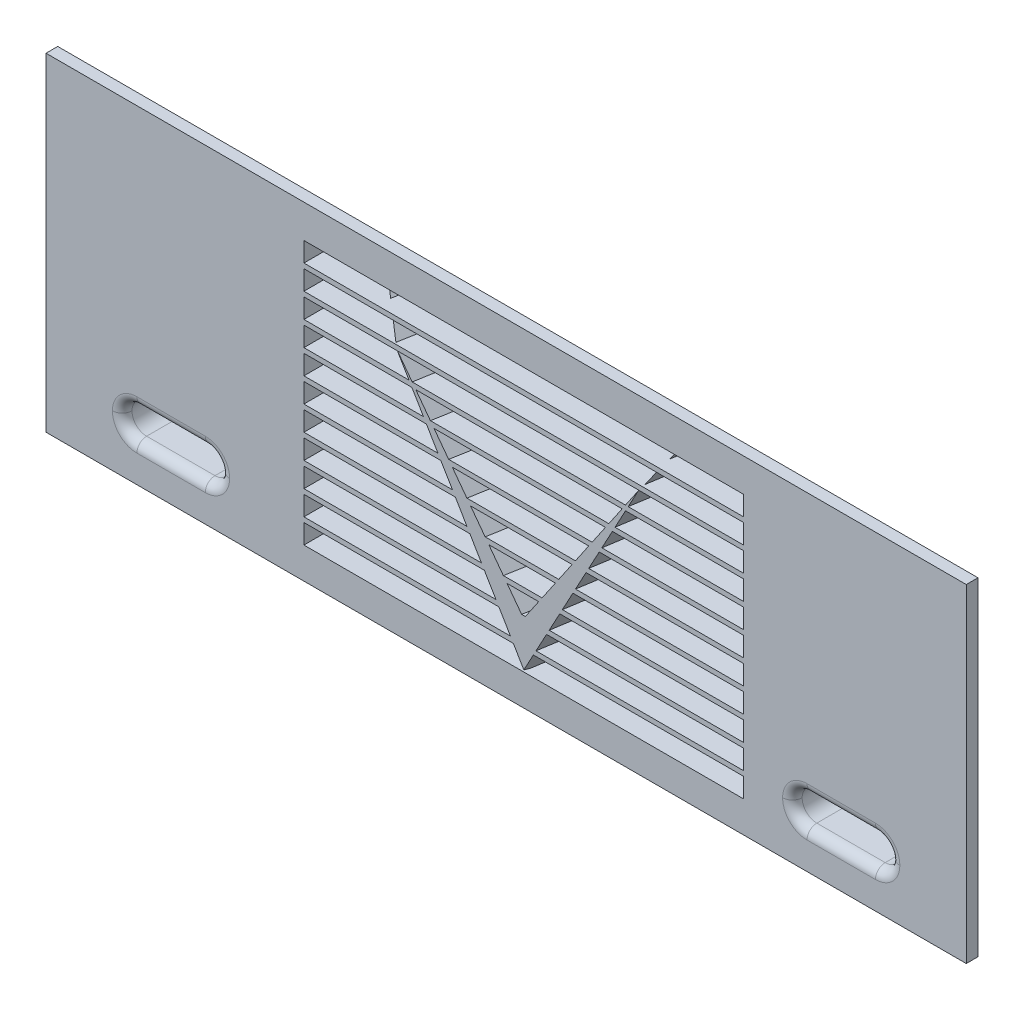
ISO-10303-21;
HEADER;
FILE_DESCRIPTION(('STEP AP214'),'2;1');
FILE_NAME('part.step','',(''),(''),'','','');
FILE_SCHEMA(('AUTOMOTIVE_DESIGN { 1 0 10303 214 1 1 1 1 }'));
ENDSEC;
DATA;
#1=APPLICATION_CONTEXT('core data for automotive mechanical design processes');
#2=APPLICATION_PROTOCOL_DEFINITION('international standard','automotive_design',2000,#1);
#3=PRODUCT_CONTEXT('',#1,'mechanical');
#4=PRODUCT('Part','Part','',(#3));
#5=PRODUCT_RELATED_PRODUCT_CATEGORY('part','',(#4));
#6=PRODUCT_DEFINITION_FORMATION('','',#4);
#7=PRODUCT_DEFINITION_CONTEXT('part definition',#1,'design');
#8=PRODUCT_DEFINITION('design','',#6,#7);
#9=PRODUCT_DEFINITION_SHAPE('','',#8);
#10=(LENGTH_UNIT() NAMED_UNIT(*) SI_UNIT(.MILLI.,.METRE.));
#11=(NAMED_UNIT(*) PLANE_ANGLE_UNIT() SI_UNIT($,.RADIAN.));
#12=(NAMED_UNIT(*) SI_UNIT($,.STERADIAN.) SOLID_ANGLE_UNIT());
#13=UNCERTAINTY_MEASURE_WITH_UNIT(LENGTH_MEASURE(1.E-05),#10,'distance_accuracy_value','');
#14=(GEOMETRIC_REPRESENTATION_CONTEXT(3) GLOBAL_UNCERTAINTY_ASSIGNED_CONTEXT((#13)) GLOBAL_UNIT_ASSIGNED_CONTEXT((#10,
#11,#12)) REPRESENTATION_CONTEXT('',''));
#15=CARTESIAN_POINT('',(0.,0.,0.));
#16=DIRECTION('',(0.,0.,1.));
#17=DIRECTION('',(1.,0.,0.));
#18=AXIS2_PLACEMENT_3D('',#15,#16,#17);
#19=CARTESIAN_POINT('',(0.,0.,0.));
#20=DIRECTION('',(0.,0.,1.));
#21=DIRECTION('',(1.,0.,0.));
#22=AXIS2_PLACEMENT_3D('',#19,#20,#21);
#23=PLANE('',#22);
#24=DIRECTION('',(0.564128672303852,0.825686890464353,0.));
#25=VECTOR('',#24,1.);
#26=CARTESIAN_POINT('',(1.77333687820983,-8.2869624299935,0.));
#27=LINE('',#26,#25);
#28=CARTESIAN_POINT('',(15.2239318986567,11.4,0.));
#29=VERTEX_POINT('',#28);
#30=CARTESIAN_POINT('',(16.5903788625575,13.4,0.));
#31=VERTEX_POINT('',#30);
#32=EDGE_CURVE('E1370',#29,#31,#27,.T.);
#33=ORIENTED_EDGE('',*,*,#32,.T.);
#34=DIRECTION('',(1.,0.,0.));
#35=VECTOR('',#34,1.);
#36=CARTESIAN_POINT('',(24.3,13.4,0.));
#37=LINE('',#36,#35);
#38=CARTESIAN_POINT('',(-14.4275448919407,13.4,0.));
#39=VERTEX_POINT('',#38);
#40=EDGE_CURVE('E1876',#39,#31,#37,.T.);
#41=ORIENTED_EDGE('',*,*,#40,.F.);
#42=DIRECTION('',(0.598477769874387,-0.801139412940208,0.));
#43=VECTOR('',#42,1.);
#44=CARTESIAN_POINT('',(-14.7352765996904,13.8119384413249,0.));
#45=LINE('',#44,#43);
#46=CARTESIAN_POINT('',(-12.9334784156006,11.4,0.));
#47=VERTEX_POINT('',#46);
#48=EDGE_CURVE('E1994',#39,#47,#45,.T.);
#49=ORIENTED_EDGE('',*,*,#48,.T.);
#50=DIRECTION('',(-1.,0.,0.));
#51=VECTOR('',#50,1.);
#52=CARTESIAN_POINT('',(24.3,11.4,0.));
#53=LINE('',#52,#51);
#54=EDGE_CURVE('E1871',#29,#47,#53,.T.);
#55=ORIENTED_EDGE('',*,*,#54,.F.);
#56=EDGE_LOOP('',(#33,#41,#49,#55));
#57=FACE_BOUND('',#56,.T.);
#58=CARTESIAN_POINT('',(13.5158731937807,8.9,0.));
#59=VERTEX_POINT('',#58);
#60=CARTESIAN_POINT('',(14.8823201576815,10.9,0.));
#61=VERTEX_POINT('',#60);
#62=EDGE_CURVE('E1372',#59,#61,#27,.T.);
#63=ORIENTED_EDGE('',*,*,#62,.T.);
#64=DIRECTION('',(1.,0.,0.));
#65=VECTOR('',#64,1.);
#66=CARTESIAN_POINT('',(24.3,10.9,0.));
#67=LINE('',#66,#65);
#68=CARTESIAN_POINT('',(-12.5599617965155,10.9,0.));
#69=VERTEX_POINT('',#68);
#70=EDGE_CURVE('E1495',#69,#61,#67,.T.);
#71=ORIENTED_EDGE('',*,*,#70,.F.);
#72=CARTESIAN_POINT('',(-11.0658953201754,8.9,0.));
#73=VERTEX_POINT('',#72);
#74=EDGE_CURVE('E2257',#69,#73,#45,.T.);
#75=ORIENTED_EDGE('',*,*,#74,.T.);
#76=DIRECTION('',(-1.,0.,0.));
#77=VECTOR('',#76,1.);
#78=CARTESIAN_POINT('',(24.3,8.9,0.));
#79=LINE('',#78,#77);
#80=EDGE_CURVE('E1490',#59,#73,#79,.T.);
#81=ORIENTED_EDGE('',*,*,#80,.F.);
#82=EDGE_LOOP('',(#63,#71,#75,#81));
#83=FACE_BOUND('',#82,.T.);
#84=CARTESIAN_POINT('',(11.8078144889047,6.4,0.));
#85=VERTEX_POINT('',#84);
#86=CARTESIAN_POINT('',(13.1742614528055,8.4,0.));
#87=VERTEX_POINT('',#86);
#88=EDGE_CURVE('E1378',#85,#87,#27,.T.);
#89=ORIENTED_EDGE('',*,*,#88,.T.);
#90=DIRECTION('',(1.,0.,0.));
#91=VECTOR('',#90,1.);
#92=CARTESIAN_POINT('',(24.3,8.4,0.));
#93=LINE('',#92,#91);
#94=CARTESIAN_POINT('',(-10.6923787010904,8.4,0.));
#95=VERTEX_POINT('',#94);
#96=EDGE_CURVE('E1412',#95,#87,#93,.T.);
#97=ORIENTED_EDGE('',*,*,#96,.F.);
#98=CARTESIAN_POINT('',(-9.19831222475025,6.4,0.));
#99=VERTEX_POINT('',#98);
#100=EDGE_CURVE('E2255',#95,#99,#45,.T.);
#101=ORIENTED_EDGE('',*,*,#100,.T.);
#102=DIRECTION('',(-1.,0.,0.));
#103=VECTOR('',#102,1.);
#104=CARTESIAN_POINT('',(24.3,6.4,0.));
#105=LINE('',#104,#103);
#106=EDGE_CURVE('E1414',#85,#99,#105,.T.);
#107=ORIENTED_EDGE('',*,*,#106,.F.);
#108=EDGE_LOOP('',(#89,#97,#101,#107));
#109=FACE_BOUND('',#108,.T.);
#110=CARTESIAN_POINT('',(10.0997557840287,3.9,0.));
#111=VERTEX_POINT('',#110);
#112=CARTESIAN_POINT('',(11.4662027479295,5.9,0.));
#113=VERTEX_POINT('',#112);
#114=EDGE_CURVE('E1402',#111,#113,#27,.T.);
#115=ORIENTED_EDGE('',*,*,#114,.T.);
#116=DIRECTION('',(1.,0.,0.));
#117=VECTOR('',#116,1.);
#118=CARTESIAN_POINT('',(24.3,5.9,0.));
#119=LINE('',#118,#117);
#120=CARTESIAN_POINT('',(-8.82479560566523,5.9,0.));
#121=VERTEX_POINT('',#120);
#122=EDGE_CURVE('E1574',#121,#113,#119,.T.);
#123=ORIENTED_EDGE('',*,*,#122,.F.);
#124=CARTESIAN_POINT('',(-7.33072912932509,3.9,0.));
#125=VERTEX_POINT('',#124);
#126=EDGE_CURVE('E2258',#121,#125,#45,.T.);
#127=ORIENTED_EDGE('',*,*,#126,.T.);
#128=DIRECTION('',(-1.,0.,0.));
#129=VECTOR('',#128,1.);
#130=CARTESIAN_POINT('',(24.3,3.9,0.));
#131=LINE('',#130,#129);
#132=EDGE_CURVE('E1569',#111,#125,#131,.T.);
#133=ORIENTED_EDGE('',*,*,#132,.F.);
#134=EDGE_LOOP('',(#115,#123,#127,#133));
#135=FACE_BOUND('',#134,.T.);
#136=CARTESIAN_POINT('',(8.39169707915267,1.4,0.));
#137=VERTEX_POINT('',#136);
#138=CARTESIAN_POINT('',(9.75814404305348,3.4,0.));
#139=VERTEX_POINT('',#138);
#140=EDGE_CURVE('E1398',#137,#139,#27,.T.);
#141=ORIENTED_EDGE('',*,*,#140,.T.);
#142=DIRECTION('',(1.,0.,0.));
#143=VECTOR('',#142,1.);
#144=CARTESIAN_POINT('',(24.3,3.4,0.));
#145=LINE('',#144,#143);
#146=CARTESIAN_POINT('',(-6.95721251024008,3.4,0.));
#147=VERTEX_POINT('',#146);
#148=EDGE_CURVE('E1614',#147,#139,#145,.T.);
#149=ORIENTED_EDGE('',*,*,#148,.F.);
#150=CARTESIAN_POINT('',(-5.46314603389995,1.4,0.));
#151=VERTEX_POINT('',#150);
#152=EDGE_CURVE('E2260',#147,#151,#45,.T.);
#153=ORIENTED_EDGE('',*,*,#152,.T.);
#154=DIRECTION('',(-1.,0.,0.));
#155=VECTOR('',#154,1.);
#156=CARTESIAN_POINT('',(24.3,1.4,0.));
#157=LINE('',#156,#155);
#158=EDGE_CURVE('E1609',#137,#151,#157,.T.);
#159=ORIENTED_EDGE('',*,*,#158,.F.);
#160=EDGE_LOOP('',(#141,#149,#153,#159));
#161=FACE_BOUND('',#160,.T.);
#162=CARTESIAN_POINT('',(6.68363837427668,-1.1,0.));
#163=VERTEX_POINT('',#162);
#164=CARTESIAN_POINT('',(8.05008533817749,0.899999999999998,0.));
#165=VERTEX_POINT('',#164);
#166=EDGE_CURVE('E1394',#163,#165,#27,.T.);
#167=ORIENTED_EDGE('',*,*,#166,.T.);
#168=DIRECTION('',(1.,0.,0.));
#169=VECTOR('',#168,1.);
#170=CARTESIAN_POINT('',(24.3,0.899999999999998,0.));
#171=LINE('',#170,#169);
#172=CARTESIAN_POINT('',(-5.08962941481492,0.899999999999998,0.));
#173=VERTEX_POINT('',#172);
#174=EDGE_CURVE('E1654',#173,#165,#171,.T.);
#175=ORIENTED_EDGE('',*,*,#174,.F.);
#176=CARTESIAN_POINT('',(-3.59556293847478,-1.1,0.));
#177=VERTEX_POINT('',#176);
#178=EDGE_CURVE('E2263',#173,#177,#45,.T.);
#179=ORIENTED_EDGE('',*,*,#178,.T.);
#180=DIRECTION('',(-1.,0.,0.));
#181=VECTOR('',#180,1.);
#182=CARTESIAN_POINT('',(24.3,-1.1,0.));
#183=LINE('',#182,#181);
#184=EDGE_CURVE('E1649',#163,#177,#183,.T.);
#185=ORIENTED_EDGE('',*,*,#184,.F.);
#186=EDGE_LOOP('',(#167,#175,#179,#185));
#187=FACE_BOUND('',#186,.T.);
#188=CARTESIAN_POINT('',(4.97557966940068,-3.6,0.));
#189=VERTEX_POINT('',#188);
#190=CARTESIAN_POINT('',(6.34202663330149,-1.6,0.));
#191=VERTEX_POINT('',#190);
#192=EDGE_CURVE('E1390',#189,#191,#27,.T.);
#193=ORIENTED_EDGE('',*,*,#192,.T.);
#194=DIRECTION('',(1.,0.,0.));
#195=VECTOR('',#194,1.);
#196=CARTESIAN_POINT('',(24.3,-1.6,0.));
#197=LINE('',#196,#195);
#198=CARTESIAN_POINT('',(-3.22204631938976,-1.6,0.));
#199=VERTEX_POINT('',#198);
#200=EDGE_CURVE('E1694',#199,#191,#197,.T.);
#201=ORIENTED_EDGE('',*,*,#200,.F.);
#202=CARTESIAN_POINT('',(-1.72797984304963,-3.6,0.));
#203=VERTEX_POINT('',#202);
#204=EDGE_CURVE('E2266',#199,#203,#45,.T.);
#205=ORIENTED_EDGE('',*,*,#204,.T.);
#206=DIRECTION('',(-1.,0.,0.));
#207=VECTOR('',#206,1.);
#208=CARTESIAN_POINT('',(24.3,-3.6,0.));
#209=LINE('',#208,#207);
#210=EDGE_CURVE('E1689',#189,#203,#209,.T.);
#211=ORIENTED_EDGE('',*,*,#210,.F.);
#212=EDGE_LOOP('',(#193,#201,#205,#211));
#213=FACE_BOUND('',#212,.T.);
#214=CARTESIAN_POINT('',(3.26752096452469,-6.1,0.));
#215=VERTEX_POINT('',#214);
#216=CARTESIAN_POINT('',(4.6339679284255,-4.1,0.));
#217=VERTEX_POINT('',#216);
#218=EDGE_CURVE('E1382',#215,#217,#27,.T.);
#219=ORIENTED_EDGE('',*,*,#218,.T.);
#220=DIRECTION('',(1.,0.,0.));
#221=VECTOR('',#220,1.);
#222=CARTESIAN_POINT('',(24.3,-4.1,0.));
#223=LINE('',#222,#221);
#224=CARTESIAN_POINT('',(-1.35446322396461,-4.1,0.));
#225=VERTEX_POINT('',#224);
#226=EDGE_CURVE('E1734',#225,#217,#223,.T.);
#227=ORIENTED_EDGE('',*,*,#226,.F.);
#228=CARTESIAN_POINT('',(0.139603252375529,-6.1,0.));
#229=VERTEX_POINT('',#228);
#230=EDGE_CURVE('E2175',#225,#229,#45,.T.);
#231=ORIENTED_EDGE('',*,*,#230,.T.);
#232=DIRECTION('',(-1.,0.,0.));
#233=VECTOR('',#232,1.);
#234=CARTESIAN_POINT('',(24.3,-6.1,0.));
#235=LINE('',#234,#233);
#236=EDGE_CURVE('E1729',#215,#229,#235,.T.);
#237=ORIENTED_EDGE('',*,*,#236,.F.);
#238=EDGE_LOOP('',(#219,#227,#231,#237));
#239=FACE_BOUND('',#238,.T.);
#240=CARTESIAN_POINT('',(1.77333687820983,-8.2869624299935,0.));
#241=VERTEX_POINT('',#240);
#242=CARTESIAN_POINT('',(2.9259092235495,-6.6,0.));
#243=VERTEX_POINT('',#242);
#244=EDGE_CURVE('E1374',#241,#243,#27,.T.);
#245=ORIENTED_EDGE('',*,*,#244,.T.);
#246=DIRECTION('',(1.,0.,0.));
#247=VECTOR('',#246,1.);
#248=CARTESIAN_POINT('',(24.3,-6.6,0.));
#249=LINE('',#248,#247);
#250=CARTESIAN_POINT('',(0.513119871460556,-6.60000000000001,0.));
#251=VERTEX_POINT('',#250);
#252=EDGE_CURVE('E1773',#251,#243,#249,.T.);
#253=ORIENTED_EDGE('',*,*,#252,.F.);
#254=EDGE_CURVE('E2173',#251,#241,#45,.T.);
#255=ORIENTED_EDGE('',*,*,#254,.T.);
#256=EDGE_LOOP('',(#245,#253,#255));
#257=FACE_BOUND('',#256,.T.);
#258=DIRECTION('',(-0.510365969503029,0.859957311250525,0.));
#259=VECTOR('',#258,1.);
#260=CARTESIAN_POINT('',(1.82660191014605,-14.0945235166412,0.));
#261=LINE('',#260,#259);
#262=CARTESIAN_POINT('',(-13.3038435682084,11.4,0.));
#263=VERTEX_POINT('',#262);
#264=CARTESIAN_POINT('',(-14.4908000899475,13.4,0.));
#265=VERTEX_POINT('',#264);
#266=EDGE_CURVE('E2177',#263,#265,#261,.T.);
#267=ORIENTED_EDGE('',*,*,#266,.T.);
#268=CARTESIAN_POINT('',(-20.7,13.4,0.));
#269=VERTEX_POINT('',#268);
#270=EDGE_CURVE('E1856',#269,#265,#37,.T.);
#271=ORIENTED_EDGE('',*,*,#270,.F.);
#272=DIRECTION('',(0.,1.,0.));
#273=VECTOR('',#272,1.);
#274=CARTESIAN_POINT('',(-20.7,13.4,0.));
#275=LINE('',#274,#273);
#276=CARTESIAN_POINT('',(-20.7,11.4,0.));
#277=VERTEX_POINT('',#276);
#278=EDGE_CURVE('E1870',#277,#269,#275,.T.);
#279=ORIENTED_EDGE('',*,*,#278,.F.);
#280=EDGE_CURVE('E1867',#263,#277,#53,.T.);
#281=ORIENTED_EDGE('',*,*,#280,.F.);
#282=EDGE_LOOP('',(#267,#271,#279,#281));
#283=FACE_BOUND('',#282,.T.);
#284=CARTESIAN_POINT('',(-11.8201479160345,8.9,0.));
#285=VERTEX_POINT('',#284);
#286=CARTESIAN_POINT('',(-13.0071044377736,10.9,0.));
#287=VERTEX_POINT('',#286);
#288=EDGE_CURVE('E1976',#285,#287,#261,.T.);
#289=ORIENTED_EDGE('',*,*,#288,.T.);
#290=CARTESIAN_POINT('',(-20.7,10.9,0.));
#291=VERTEX_POINT('',#290);
#292=EDGE_CURVE('E1473',#291,#287,#67,.T.);
#293=ORIENTED_EDGE('',*,*,#292,.F.);
#294=DIRECTION('',(0.,1.,0.));
#295=VECTOR('',#294,1.);
#296=CARTESIAN_POINT('',(-20.7,10.9,0.));
#297=LINE('',#296,#295);
#298=CARTESIAN_POINT('',(-20.7,8.9,0.));
#299=VERTEX_POINT('',#298);
#300=EDGE_CURVE('E1489',#299,#291,#297,.T.);
#301=ORIENTED_EDGE('',*,*,#300,.F.);
#302=EDGE_CURVE('E1485',#285,#299,#79,.T.);
#303=ORIENTED_EDGE('',*,*,#302,.F.);
#304=EDGE_LOOP('',(#289,#293,#301,#303));
#305=FACE_BOUND('',#304,.T.);
#306=CARTESIAN_POINT('',(-10.3364522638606,6.4,0.));
#307=VERTEX_POINT('',#306);
#308=CARTESIAN_POINT('',(-11.5234087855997,8.4,0.));
#309=VERTEX_POINT('',#308);
#310=EDGE_CURVE('E2182',#307,#309,#261,.T.);
#311=ORIENTED_EDGE('',*,*,#310,.T.);
#312=CARTESIAN_POINT('',(-20.7,8.4,0.));
#313=VERTEX_POINT('',#312);
#314=EDGE_CURVE('E1511',#313,#309,#93,.T.);
#315=ORIENTED_EDGE('',*,*,#314,.F.);
#316=DIRECTION('',(0.,1.,0.));
#317=VECTOR('',#316,1.);
#318=CARTESIAN_POINT('',(-20.7,8.4,0.));
#319=LINE('',#318,#317);
#320=CARTESIAN_POINT('',(-20.7,6.4,0.));
#321=VERTEX_POINT('',#320);
#322=EDGE_CURVE('E1530',#321,#313,#319,.T.);
#323=ORIENTED_EDGE('',*,*,#322,.F.);
#324=EDGE_CURVE('E1526',#307,#321,#105,.T.);
#325=ORIENTED_EDGE('',*,*,#324,.F.);
#326=EDGE_LOOP('',(#311,#315,#323,#325));
#327=FACE_BOUND('',#326,.T.);
#328=CARTESIAN_POINT('',(-8.85275661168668,3.9,0.));
#329=VERTEX_POINT('',#328);
#330=CARTESIAN_POINT('',(-10.0397131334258,5.9,0.));
#331=VERTEX_POINT('',#330);
#332=EDGE_CURVE('E2215',#329,#331,#261,.T.);
#333=ORIENTED_EDGE('',*,*,#332,.T.);
#334=CARTESIAN_POINT('',(-20.7,5.9,0.));
#335=VERTEX_POINT('',#334);
#336=EDGE_CURVE('E1548',#335,#331,#119,.T.);
#337=ORIENTED_EDGE('',*,*,#336,.F.);
#338=DIRECTION('',(0.,1.,0.));
#339=VECTOR('',#338,1.);
#340=CARTESIAN_POINT('',(-20.7,5.9,0.));
#341=LINE('',#340,#339);
#342=CARTESIAN_POINT('',(-20.7,3.9,0.));
#343=VERTEX_POINT('',#342);
#344=EDGE_CURVE('E1568',#343,#335,#341,.T.);
#345=ORIENTED_EDGE('',*,*,#344,.F.);
#346=EDGE_CURVE('E1564',#329,#343,#131,.T.);
#347=ORIENTED_EDGE('',*,*,#346,.F.);
#348=EDGE_LOOP('',(#333,#337,#345,#347));
#349=FACE_BOUND('',#348,.T.);
#350=CARTESIAN_POINT('',(-7.36906095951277,1.4,0.));
#351=VERTEX_POINT('',#350);
#352=CARTESIAN_POINT('',(-8.55601748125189,3.4,0.));
#353=VERTEX_POINT('',#352);
#354=EDGE_CURVE('E2210',#351,#353,#261,.T.);
#355=ORIENTED_EDGE('',*,*,#354,.T.);
#356=CARTESIAN_POINT('',(-20.7,3.4,0.));
#357=VERTEX_POINT('',#356);
#358=EDGE_CURVE('E1588',#357,#353,#145,.T.);
#359=ORIENTED_EDGE('',*,*,#358,.F.);
#360=DIRECTION('',(0.,1.,0.));
#361=VECTOR('',#360,1.);
#362=CARTESIAN_POINT('',(-20.7,3.4,0.));
#363=LINE('',#362,#361);
#364=CARTESIAN_POINT('',(-20.7,1.4,0.));
#365=VERTEX_POINT('',#364);
#366=EDGE_CURVE('E1608',#365,#357,#363,.T.);
#367=ORIENTED_EDGE('',*,*,#366,.F.);
#368=EDGE_CURVE('E1604',#351,#365,#157,.T.);
#369=ORIENTED_EDGE('',*,*,#368,.F.);
#370=EDGE_LOOP('',(#355,#359,#367,#369));
#371=FACE_BOUND('',#370,.T.);
#372=CARTESIAN_POINT('',(-5.88536530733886,-1.1,0.));
#373=VERTEX_POINT('',#372);
#374=CARTESIAN_POINT('',(-7.07232182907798,0.899999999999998,0.));
#375=VERTEX_POINT('',#374);
#376=EDGE_CURVE('E2205',#373,#375,#261,.T.);
#377=ORIENTED_EDGE('',*,*,#376,.T.);
#378=CARTESIAN_POINT('',(-20.7,0.899999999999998,0.));
#379=VERTEX_POINT('',#378);
#380=EDGE_CURVE('E1628',#379,#375,#171,.T.);
#381=ORIENTED_EDGE('',*,*,#380,.F.);
#382=DIRECTION('',(0.,1.,0.));
#383=VECTOR('',#382,1.);
#384=CARTESIAN_POINT('',(-20.7,0.899999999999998,0.));
#385=LINE('',#384,#383);
#386=CARTESIAN_POINT('',(-20.7,-1.1,0.));
#387=VERTEX_POINT('',#386);
#388=EDGE_CURVE('E1648',#387,#379,#385,.T.);
#389=ORIENTED_EDGE('',*,*,#388,.F.);
#390=EDGE_CURVE('E1644',#373,#387,#183,.T.);
#391=ORIENTED_EDGE('',*,*,#390,.F.);
#392=EDGE_LOOP('',(#377,#381,#389,#391));
#393=FACE_BOUND('',#392,.T.);
#394=CARTESIAN_POINT('',(-4.40166965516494,-3.6,0.));
#395=VERTEX_POINT('',#394);
#396=CARTESIAN_POINT('',(-5.58862617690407,-1.6,0.));
#397=VERTEX_POINT('',#396);
#398=EDGE_CURVE('E2200',#395,#397,#261,.T.);
#399=ORIENTED_EDGE('',*,*,#398,.T.);
#400=CARTESIAN_POINT('',(-20.7,-1.6,0.));
#401=VERTEX_POINT('',#400);
#402=EDGE_CURVE('E1668',#401,#397,#197,.T.);
#403=ORIENTED_EDGE('',*,*,#402,.F.);
#404=DIRECTION('',(0.,1.,0.));
#405=VECTOR('',#404,1.);
#406=CARTESIAN_POINT('',(-20.7,-1.6,0.));
#407=LINE('',#406,#405);
#408=CARTESIAN_POINT('',(-20.7,-3.6,0.));
#409=VERTEX_POINT('',#408);
#410=EDGE_CURVE('E1688',#409,#401,#407,.T.);
#411=ORIENTED_EDGE('',*,*,#410,.F.);
#412=EDGE_CURVE('E1684',#395,#409,#209,.T.);
#413=ORIENTED_EDGE('',*,*,#412,.F.);
#414=EDGE_LOOP('',(#399,#403,#411,#413));
#415=FACE_BOUND('',#414,.T.);
#416=CARTESIAN_POINT('',(-2.91797400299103,-6.1,0.));
#417=VERTEX_POINT('',#416);
#418=CARTESIAN_POINT('',(-4.10493052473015,-4.1,0.));
#419=VERTEX_POINT('',#418);
#420=EDGE_CURVE('E2195',#417,#419,#261,.T.);
#421=ORIENTED_EDGE('',*,*,#420,.T.);
#422=CARTESIAN_POINT('',(-20.7,-4.1,0.));
#423=VERTEX_POINT('',#422);
#424=EDGE_CURVE('E1708',#423,#419,#223,.T.);
#425=ORIENTED_EDGE('',*,*,#424,.F.);
#426=DIRECTION('',(0.,1.,0.));
#427=VECTOR('',#426,1.);
#428=CARTESIAN_POINT('',(-20.7,-4.1,0.));
#429=LINE('',#428,#427);
#430=CARTESIAN_POINT('',(-20.7,-6.1,0.));
#431=VERTEX_POINT('',#430);
#432=EDGE_CURVE('E1728',#431,#423,#429,.T.);
#433=ORIENTED_EDGE('',*,*,#432,.F.);
#434=EDGE_CURVE('E1724',#417,#431,#235,.T.);
#435=ORIENTED_EDGE('',*,*,#434,.F.);
#436=EDGE_LOOP('',(#421,#425,#433,#435));
#437=FACE_BOUND('',#436,.T.);
#438=CARTESIAN_POINT('',(-1.43427835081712,-8.6,0.));
#439=VERTEX_POINT('',#438);
#440=CARTESIAN_POINT('',(-2.62123487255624,-6.6,0.));
#441=VERTEX_POINT('',#440);
#442=EDGE_CURVE('E2190',#439,#441,#261,.T.);
#443=ORIENTED_EDGE('',*,*,#442,.T.);
#444=CARTESIAN_POINT('',(-20.7,-6.6,0.));
#445=VERTEX_POINT('',#444);
#446=EDGE_CURVE('E1748',#445,#441,#249,.T.);
#447=ORIENTED_EDGE('',*,*,#446,.F.);
#448=DIRECTION('',(0.,1.,0.));
#449=VECTOR('',#448,1.);
#450=CARTESIAN_POINT('',(-20.7,-6.6,0.));
#451=LINE('',#450,#449);
#452=CARTESIAN_POINT('',(-20.7,-8.6,0.));
#453=VERTEX_POINT('',#452);
#454=EDGE_CURVE('E1768',#453,#445,#451,.T.);
#455=ORIENTED_EDGE('',*,*,#454,.F.);
#456=DIRECTION('',(-1.,0.,0.));
#457=VECTOR('',#456,1.);
#458=CARTESIAN_POINT('',(24.3,-8.6,0.));
#459=LINE('',#458,#457);
#460=EDGE_CURVE('E1764',#439,#453,#459,.T.);
#461=ORIENTED_EDGE('',*,*,#460,.F.);
#462=EDGE_LOOP('',(#443,#447,#455,#461));
#463=FACE_BOUND('',#462,.T.);
#464=CARTESIAN_POINT('',(0.0494173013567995,-11.1,0.));
#465=VERTEX_POINT('',#464);
#466=CARTESIAN_POINT('',(-1.13753922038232,-9.1,0.));
#467=VERTEX_POINT('',#466);
#468=EDGE_CURVE('E2185',#465,#467,#261,.T.);
#469=ORIENTED_EDGE('',*,*,#468,.T.);
#470=DIRECTION('',(1.,0.,0.));
#471=VECTOR('',#470,1.);
#472=CARTESIAN_POINT('',(24.3,-9.1,0.));
#473=LINE('',#472,#471);
#474=CARTESIAN_POINT('',(-20.7,-9.1,0.));
#475=VERTEX_POINT('',#474);
#476=EDGE_CURVE('E1787',#475,#467,#473,.T.);
#477=ORIENTED_EDGE('',*,*,#476,.F.);
#478=DIRECTION('',(0.,1.,0.));
#479=VECTOR('',#478,1.);
#480=CARTESIAN_POINT('',(-20.7,-9.1,0.));
#481=LINE('',#480,#479);
#482=CARTESIAN_POINT('',(-20.7,-11.1,0.));
#483=VERTEX_POINT('',#482);
#484=EDGE_CURVE('E1805',#483,#475,#481,.T.);
#485=ORIENTED_EDGE('',*,*,#484,.F.);
#486=DIRECTION('',(-1.,0.,0.));
#487=VECTOR('',#486,1.);
#488=CARTESIAN_POINT('',(24.3,-11.1,0.));
#489=LINE('',#488,#487);
#490=EDGE_CURVE('E1801',#465,#483,#489,.T.);
#491=ORIENTED_EDGE('',*,*,#490,.F.);
#492=EDGE_LOOP('',(#469,#477,#485,#491));
#493=FACE_BOUND('',#492,.T.);
#494=CARTESIAN_POINT('',(1.53311295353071,-13.6,0.));
#495=VERTEX_POINT('',#494);
#496=CARTESIAN_POINT('',(0.346156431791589,-11.6,0.));
#497=VERTEX_POINT('',#496);
#498=EDGE_CURVE('E2176',#495,#497,#261,.T.);
#499=ORIENTED_EDGE('',*,*,#498,.T.);
#500=DIRECTION('',(1.,0.,0.));
#501=VECTOR('',#500,1.);
#502=CARTESIAN_POINT('',(24.3,-11.6,0.));
#503=LINE('',#502,#501);
#504=CARTESIAN_POINT('',(-20.7,-11.6,0.));
#505=VERTEX_POINT('',#504);
#506=EDGE_CURVE('E1823',#505,#497,#503,.T.);
#507=ORIENTED_EDGE('',*,*,#506,.F.);
#508=DIRECTION('',(0.,1.,0.));
#509=VECTOR('',#508,1.);
#510=CARTESIAN_POINT('',(-20.7,-11.6,0.));
#511=LINE('',#510,#509);
#512=CARTESIAN_POINT('',(-20.7,-13.6,0.));
#513=VERTEX_POINT('',#512);
#514=EDGE_CURVE('E1838',#513,#505,#511,.T.);
#515=ORIENTED_EDGE('',*,*,#514,.F.);
#516=DIRECTION('',(-1.,0.,0.));
#517=VECTOR('',#516,1.);
#518=CARTESIAN_POINT('',(24.3,-13.6,0.));
#519=LINE('',#518,#517);
#520=EDGE_CURVE('E1835',#495,#513,#519,.T.);
#521=ORIENTED_EDGE('',*,*,#520,.F.);
#522=EDGE_LOOP('',(#499,#507,#515,#521));
#523=FACE_BOUND('',#522,.T.);
#524=DIRECTION('',(-0.474556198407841,-0.880225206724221,0.));
#525=VECTOR('',#524,1.);
#526=CARTESIAN_POINT('',(16.8718248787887,13.8119384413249,0.));
#527=LINE('',#526,#525);
#528=CARTESIAN_POINT('',(3.17147545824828,-11.6,0.));
#529=VERTEX_POINT('',#528);
#530=CARTESIAN_POINT('',(2.09321458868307,-13.6,0.));
#531=VERTEX_POINT('',#530);
#532=EDGE_CURVE('E1381',#529,#531,#527,.T.);
#533=ORIENTED_EDGE('',*,*,#532,.T.);
#534=CARTESIAN_POINT('',(24.3,-13.6,0.));
#535=VERTEX_POINT('',#534);
#536=EDGE_CURVE('E1836',#535,#531,#519,.T.);
#537=ORIENTED_EDGE('',*,*,#536,.F.);
#538=DIRECTION('',(0.,-1.,0.));
#539=VECTOR('',#538,1.);
#540=CARTESIAN_POINT('',(24.3,-11.6,0.));
#541=LINE('',#540,#539);
#542=CARTESIAN_POINT('',(24.3,-11.6,0.));
#543=VERTEX_POINT('',#542);
#544=EDGE_CURVE('E1468',#543,#535,#541,.T.);
#545=ORIENTED_EDGE('',*,*,#544,.F.);
#546=EDGE_CURVE('E1841',#529,#543,#503,.T.);
#547=ORIENTED_EDGE('',*,*,#546,.F.);
#548=EDGE_LOOP('',(#533,#537,#545,#547));
#549=FACE_BOUND('',#548,.T.);
#550=CARTESIAN_POINT('',(4.5193015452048,-9.10000000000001,0.));
#551=VERTEX_POINT('',#550);
#552=CARTESIAN_POINT('',(3.44104067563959,-11.1,0.));
#553=VERTEX_POINT('',#552);
#554=EDGE_CURVE('E1387',#551,#553,#527,.T.);
#555=ORIENTED_EDGE('',*,*,#554,.T.);
#556=CARTESIAN_POINT('',(24.3,-11.1,0.));
#557=VERTEX_POINT('',#556);
#558=EDGE_CURVE('E1803',#557,#553,#489,.T.);
#559=ORIENTED_EDGE('',*,*,#558,.F.);
#560=DIRECTION('',(0.,-1.,0.));
#561=VECTOR('',#560,1.);
#562=CARTESIAN_POINT('',(24.3,-9.1,0.));
#563=LINE('',#562,#561);
#564=CARTESIAN_POINT('',(24.3,-9.1,0.));
#565=VERTEX_POINT('',#564);
#566=EDGE_CURVE('E1799',#565,#557,#563,.T.);
#567=ORIENTED_EDGE('',*,*,#566,.F.);
#568=EDGE_CURVE('E1808',#551,#565,#473,.T.);
#569=ORIENTED_EDGE('',*,*,#568,.F.);
#570=EDGE_LOOP('',(#555,#559,#567,#569));
#571=FACE_BOUND('',#570,.T.);
#572=CARTESIAN_POINT('',(5.86712763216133,-6.6,0.));
#573=VERTEX_POINT('',#572);
#574=CARTESIAN_POINT('',(4.78886676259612,-8.6,0.));
#575=VERTEX_POINT('',#574);
#576=EDGE_CURVE('E3656',#573,#575,#527,.T.);
#577=ORIENTED_EDGE('',*,*,#576,.T.);
#578=CARTESIAN_POINT('',(24.3,-8.6,0.));
#579=VERTEX_POINT('',#578);
#580=EDGE_CURVE('E1766',#579,#575,#459,.T.);
#581=ORIENTED_EDGE('',*,*,#580,.F.);
#582=DIRECTION('',(0.,-1.,0.));
#583=VECTOR('',#582,1.);
#584=CARTESIAN_POINT('',(24.3,-6.6,0.));
#585=LINE('',#584,#583);
#586=CARTESIAN_POINT('',(24.3,-6.6,0.));
#587=VERTEX_POINT('',#586);
#588=EDGE_CURVE('E1762',#587,#579,#585,.T.);
#589=ORIENTED_EDGE('',*,*,#588,.F.);
#590=EDGE_CURVE('E1771',#573,#587,#249,.T.);
#591=ORIENTED_EDGE('',*,*,#590,.F.);
#592=EDGE_LOOP('',(#577,#581,#589,#591));
#593=FACE_BOUND('',#592,.T.);
#594=CARTESIAN_POINT('',(7.21495371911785,-4.1,0.));
#595=VERTEX_POINT('',#594);
#596=CARTESIAN_POINT('',(6.13669284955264,-6.1,0.));
#597=VERTEX_POINT('',#596);
#598=EDGE_CURVE('E3661',#595,#597,#527,.T.);
#599=ORIENTED_EDGE('',*,*,#598,.T.);
#600=CARTESIAN_POINT('',(24.3,-6.1,0.));
#601=VERTEX_POINT('',#600);
#602=EDGE_CURVE('E1726',#601,#597,#235,.T.);
#603=ORIENTED_EDGE('',*,*,#602,.F.);
#604=DIRECTION('',(0.,-1.,0.));
#605=VECTOR('',#604,1.);
#606=CARTESIAN_POINT('',(24.3,-4.1,0.));
#607=LINE('',#606,#605);
#608=CARTESIAN_POINT('',(24.3,-4.1,0.));
#609=VERTEX_POINT('',#608);
#610=EDGE_CURVE('E1722',#609,#601,#607,.T.);
#611=ORIENTED_EDGE('',*,*,#610,.F.);
#612=EDGE_CURVE('E1732',#595,#609,#223,.T.);
#613=ORIENTED_EDGE('',*,*,#612,.F.);
#614=EDGE_LOOP('',(#599,#603,#611,#613));
#615=FACE_BOUND('',#614,.T.);
#616=CARTESIAN_POINT('',(8.56277980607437,-1.6,0.));
#617=VERTEX_POINT('',#616);
#618=CARTESIAN_POINT('',(7.48451893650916,-3.6,0.));
#619=VERTEX_POINT('',#618);
#620=EDGE_CURVE('E3666',#617,#619,#527,.T.);
#621=ORIENTED_EDGE('',*,*,#620,.T.);
#622=CARTESIAN_POINT('',(24.3,-3.6,0.));
#623=VERTEX_POINT('',#622);
#624=EDGE_CURVE('E1686',#623,#619,#209,.T.);
#625=ORIENTED_EDGE('',*,*,#624,.F.);
#626=DIRECTION('',(0.,-1.,0.));
#627=VECTOR('',#626,1.);
#628=CARTESIAN_POINT('',(24.3,-1.6,0.));
#629=LINE('',#628,#627);
#630=CARTESIAN_POINT('',(24.3,-1.6,0.));
#631=VERTEX_POINT('',#630);
#632=EDGE_CURVE('E1682',#631,#623,#629,.T.);
#633=ORIENTED_EDGE('',*,*,#632,.F.);
#634=EDGE_CURVE('E1692',#617,#631,#197,.T.);
#635=ORIENTED_EDGE('',*,*,#634,.F.);
#636=EDGE_LOOP('',(#621,#625,#633,#635));
#637=FACE_BOUND('',#636,.T.);
#638=CARTESIAN_POINT('',(9.91060589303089,0.899999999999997,0.));
#639=VERTEX_POINT('',#638);
#640=CARTESIAN_POINT('',(8.83234502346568,-1.1,0.));
#641=VERTEX_POINT('',#640);
#642=EDGE_CURVE('E3671',#639,#641,#527,.T.);
#643=ORIENTED_EDGE('',*,*,#642,.T.);
#644=CARTESIAN_POINT('',(24.3,-1.1,0.));
#645=VERTEX_POINT('',#644);
#646=EDGE_CURVE('E1646',#645,#641,#183,.T.);
#647=ORIENTED_EDGE('',*,*,#646,.F.);
#648=DIRECTION('',(0.,-1.,0.));
#649=VECTOR('',#648,1.);
#650=CARTESIAN_POINT('',(24.3,0.899999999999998,0.));
#651=LINE('',#650,#649);
#652=CARTESIAN_POINT('',(24.3,0.899999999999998,0.));
#653=VERTEX_POINT('',#652);
#654=EDGE_CURVE('E1642',#653,#645,#651,.T.);
#655=ORIENTED_EDGE('',*,*,#654,.F.);
#656=EDGE_CURVE('E1652',#639,#653,#171,.T.);
#657=ORIENTED_EDGE('',*,*,#656,.F.);
#658=EDGE_LOOP('',(#643,#647,#655,#657));
#659=FACE_BOUND('',#658,.T.);
#660=CARTESIAN_POINT('',(11.2584319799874,3.4,0.));
#661=VERTEX_POINT('',#660);
#662=CARTESIAN_POINT('',(10.1801711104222,1.4,0.));
#663=VERTEX_POINT('',#662);
#664=EDGE_CURVE('E3676',#661,#663,#527,.T.);
#665=ORIENTED_EDGE('',*,*,#664,.T.);
#666=CARTESIAN_POINT('',(24.3,1.4,0.));
#667=VERTEX_POINT('',#666);
#668=EDGE_CURVE('E1606',#667,#663,#157,.T.);
#669=ORIENTED_EDGE('',*,*,#668,.F.);
#670=DIRECTION('',(0.,-1.,0.));
#671=VECTOR('',#670,1.);
#672=CARTESIAN_POINT('',(24.3,3.4,0.));
#673=LINE('',#672,#671);
#674=CARTESIAN_POINT('',(24.3,3.4,0.));
#675=VERTEX_POINT('',#674);
#676=EDGE_CURVE('E1602',#675,#667,#673,.T.);
#677=ORIENTED_EDGE('',*,*,#676,.F.);
#678=EDGE_CURVE('E1612',#661,#675,#145,.T.);
#679=ORIENTED_EDGE('',*,*,#678,.F.);
#680=EDGE_LOOP('',(#665,#669,#677,#679));
#681=FACE_BOUND('',#680,.T.);
#682=CARTESIAN_POINT('',(12.6062580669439,5.9,0.));
#683=VERTEX_POINT('',#682);
#684=CARTESIAN_POINT('',(11.5279971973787,3.9,0.));
#685=VERTEX_POINT('',#684);
#686=EDGE_CURVE('E3681',#683,#685,#527,.T.);
#687=ORIENTED_EDGE('',*,*,#686,.T.);
#688=CARTESIAN_POINT('',(24.3,3.9,0.));
#689=VERTEX_POINT('',#688);
#690=EDGE_CURVE('E1566',#689,#685,#131,.T.);
#691=ORIENTED_EDGE('',*,*,#690,.F.);
#692=DIRECTION('',(0.,-1.,0.));
#693=VECTOR('',#692,1.);
#694=CARTESIAN_POINT('',(24.3,5.9,0.));
#695=LINE('',#694,#693);
#696=CARTESIAN_POINT('',(24.3,5.9,0.));
#697=VERTEX_POINT('',#696);
#698=EDGE_CURVE('E1562',#697,#689,#695,.T.);
#699=ORIENTED_EDGE('',*,*,#698,.F.);
#700=EDGE_CURVE('E1572',#683,#697,#119,.T.);
#701=ORIENTED_EDGE('',*,*,#700,.F.);
#702=EDGE_LOOP('',(#687,#691,#699,#701));
#703=FACE_BOUND('',#702,.T.);
#704=CARTESIAN_POINT('',(13.9540841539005,8.4,0.));
#705=VERTEX_POINT('',#704);
#706=CARTESIAN_POINT('',(12.8758232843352,6.4,0.));
#707=VERTEX_POINT('',#706);
#708=EDGE_CURVE('E3686',#705,#707,#527,.T.);
#709=ORIENTED_EDGE('',*,*,#708,.T.);
#710=CARTESIAN_POINT('',(24.3,6.4,0.));
#711=VERTEX_POINT('',#710);
#712=EDGE_CURVE('E1528',#711,#707,#105,.T.);
#713=ORIENTED_EDGE('',*,*,#712,.F.);
#714=DIRECTION('',(0.,-1.,0.));
#715=VECTOR('',#714,1.);
#716=CARTESIAN_POINT('',(24.3,8.4,0.));
#717=LINE('',#716,#715);
#718=CARTESIAN_POINT('',(24.3,8.4,0.));
#719=VERTEX_POINT('',#718);
#720=EDGE_CURVE('E1524',#719,#711,#717,.T.);
#721=ORIENTED_EDGE('',*,*,#720,.F.);
#722=EDGE_CURVE('E1533',#705,#719,#93,.T.);
#723=ORIENTED_EDGE('',*,*,#722,.F.);
#724=EDGE_LOOP('',(#709,#713,#721,#723));
#725=FACE_BOUND('',#724,.T.);
#726=CARTESIAN_POINT('',(15.301910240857,10.9,0.));
#727=VERTEX_POINT('',#726);
#728=CARTESIAN_POINT('',(14.2236493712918,8.9,0.));
#729=VERTEX_POINT('',#728);
#730=EDGE_CURVE('E2167',#727,#729,#527,.T.);
#731=ORIENTED_EDGE('',*,*,#730,.T.);
#732=CARTESIAN_POINT('',(24.3,8.9,0.));
#733=VERTEX_POINT('',#732);
#734=EDGE_CURVE('E1487',#733,#729,#79,.T.);
#735=ORIENTED_EDGE('',*,*,#734,.F.);
#736=DIRECTION('',(0.,-1.,0.));
#737=VECTOR('',#736,1.);
#738=CARTESIAN_POINT('',(24.3,10.9,0.));
#739=LINE('',#738,#737);
#740=CARTESIAN_POINT('',(24.3,10.9,0.));
#741=VERTEX_POINT('',#740);
#742=EDGE_CURVE('E1483',#741,#733,#739,.T.);
#743=ORIENTED_EDGE('',*,*,#742,.F.);
#744=EDGE_CURVE('E1493',#727,#741,#67,.T.);
#745=ORIENTED_EDGE('',*,*,#744,.F.);
#746=EDGE_LOOP('',(#731,#735,#743,#745));
#747=FACE_BOUND('',#746,.T.);
#748=CARTESIAN_POINT('',(16.6497363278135,13.4,0.));
#749=VERTEX_POINT('',#748);
#750=CARTESIAN_POINT('',(15.5714754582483,11.4,0.));
#751=VERTEX_POINT('',#750);
#752=EDGE_CURVE('E1388',#749,#751,#527,.T.);
#753=ORIENTED_EDGE('',*,*,#752,.T.);
#754=CARTESIAN_POINT('',(24.3,11.4,0.));
#755=VERTEX_POINT('',#754);
#756=EDGE_CURVE('E1868',#755,#751,#53,.T.);
#757=ORIENTED_EDGE('',*,*,#756,.F.);
#758=DIRECTION('',(0.,-1.,0.));
#759=VECTOR('',#758,1.);
#760=CARTESIAN_POINT('',(24.3,13.4,0.));
#761=LINE('',#760,#759);
#762=CARTESIAN_POINT('',(24.3,13.4,0.));
#763=VERTEX_POINT('',#762);
#764=EDGE_CURVE('E1499',#763,#755,#761,.T.);
#765=ORIENTED_EDGE('',*,*,#764,.F.);
#766=EDGE_CURVE('E1874',#749,#763,#37,.T.);
#767=ORIENTED_EDGE('',*,*,#766,.F.);
#768=EDGE_LOOP('',(#753,#757,#765,#767));
#769=FACE_BOUND('',#768,.T.);
#770=DIRECTION('',(1.,0.,0.));
#771=VECTOR('',#770,1.);
#772=CARTESIAN_POINT('',(30.8,-7.,0.));
#773=LINE('',#772,#771);
#774=CARTESIAN_POINT('',(37.8,-7.,0.));
#775=VERTEX_POINT('',#774);
#776=CARTESIAN_POINT('',(30.8,-7.,0.));
#777=VERTEX_POINT('',#776);
#778=EDGE_CURVE('E1058',#775,#777,#773,.F.);
#779=ORIENTED_EDGE('',*,*,#778,.T.);
#780=CARTESIAN_POINT('',(30.8,-11.5,0.));
#781=DIRECTION('',(0.,0.,1.));
#782=DIRECTION('',(1.,0.,0.));
#783=AXIS2_PLACEMENT_3D('',#780,#781,#782);
#784=CIRCLE('',#783,4.5);
#785=CARTESIAN_POINT('',(27.9715728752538,-15.,0.));
#786=VERTEX_POINT('',#785);
#787=EDGE_CURVE('E1060',#777,#786,#784,.T.);
#788=ORIENTED_EDGE('',*,*,#787,.T.);
#789=DIRECTION('',(1.,0.,0.));
#790=VECTOR('',#789,1.);
#791=CARTESIAN_POINT('',(-44.3,-15.,0.));
#792=LINE('',#791,#790);
#793=CARTESIAN_POINT('',(-27.9715728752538,-15.,0.));
#794=VERTEX_POINT('',#793);
#795=EDGE_CURVE('E1941',#794,#786,#792,.T.);
#796=ORIENTED_EDGE('',*,*,#795,.F.);
#797=CARTESIAN_POINT('',(-30.8,-11.5,0.));
#798=DIRECTION('',(0.,0.,1.));
#799=DIRECTION('',(1.,0.,0.));
#800=AXIS2_PLACEMENT_3D('',#797,#798,#799);
#801=CIRCLE('',#800,4.5);
#802=CARTESIAN_POINT('',(-30.8,-7.,0.));
#803=VERTEX_POINT('',#802);
#804=EDGE_CURVE('E1052',#794,#803,#801,.T.);
#805=ORIENTED_EDGE('',*,*,#804,.T.);
#806=DIRECTION('',(1.,0.,0.));
#807=VECTOR('',#806,1.);
#808=CARTESIAN_POINT('',(-37.8,-7.,0.));
#809=LINE('',#808,#807);
#810=CARTESIAN_POINT('',(-37.8,-7.,0.));
#811=VERTEX_POINT('',#810);
#812=EDGE_CURVE('E1050',#803,#811,#809,.F.);
#813=ORIENTED_EDGE('',*,*,#812,.T.);
#814=CARTESIAN_POINT('',(-37.8,-11.5,0.));
#815=DIRECTION('',(0.,0.,1.));
#816=DIRECTION('',(1.,0.,0.));
#817=AXIS2_PLACEMENT_3D('',#814,#815,#816);
#818=CIRCLE('',#817,4.5);
#819=CARTESIAN_POINT('',(-40.6284271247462,-15.,0.));
#820=VERTEX_POINT('',#819);
#821=EDGE_CURVE('E1054',#811,#820,#818,.T.);
#822=ORIENTED_EDGE('',*,*,#821,.T.);
#823=CARTESIAN_POINT('',(-44.3,-15.,0.));
#824=VERTEX_POINT('',#823);
#825=EDGE_CURVE('E1922',#824,#820,#792,.T.);
#826=ORIENTED_EDGE('',*,*,#825,.F.);
#827=DIRECTION('',(0.,-1.,0.));
#828=VECTOR('',#827,1.);
#829=CARTESIAN_POINT('',(-44.3,15.,0.));
#830=LINE('',#829,#828);
#831=CARTESIAN_POINT('',(-44.3,15.,0.));
#832=VERTEX_POINT('',#831);
#833=EDGE_CURVE('E1936',#832,#824,#830,.T.);
#834=ORIENTED_EDGE('',*,*,#833,.F.);
#835=DIRECTION('',(-1.,0.,0.));
#836=VECTOR('',#835,1.);
#837=CARTESIAN_POINT('',(-44.3,15.,0.));
#838=LINE('',#837,#836);
#839=CARTESIAN_POINT('',(44.3,15.,0.));
#840=VERTEX_POINT('',#839);
#841=EDGE_CURVE('E1934',#840,#832,#838,.T.);
#842=ORIENTED_EDGE('',*,*,#841,.F.);
#843=DIRECTION('',(0.,1.,0.));
#844=VECTOR('',#843,1.);
#845=CARTESIAN_POINT('',(44.3,15.,0.));
#846=LINE('',#845,#844);
#847=CARTESIAN_POINT('',(44.3,-15.,0.));
#848=VERTEX_POINT('',#847);
#849=EDGE_CURVE('E1917',#848,#840,#846,.T.);
#850=ORIENTED_EDGE('',*,*,#849,.F.);
#851=CARTESIAN_POINT('',(40.6284271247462,-15.,0.));
#852=VERTEX_POINT('',#851);
#853=EDGE_CURVE('E1938',#852,#848,#792,.T.);
#854=ORIENTED_EDGE('',*,*,#853,.F.);
#855=CARTESIAN_POINT('',(37.8,-11.5,0.));
#856=DIRECTION('',(0.,0.,1.));
#857=DIRECTION('',(1.,0.,0.));
#858=AXIS2_PLACEMENT_3D('',#855,#856,#857);
#859=CIRCLE('',#858,4.5);
#860=EDGE_CURVE('E1056',#852,#775,#859,.T.);
#861=ORIENTED_EDGE('',*,*,#860,.T.);
#862=EDGE_LOOP('',(#779,#788,#796,#805,#813,#822,#826,#834,#842,#850,#854,#861));
#863=FACE_BOUND('',#862,.T.);
#864=ADVANCED_FACE('F37',(#57,#83,#109,#135,#161,#187,#213,#239,#257,#283,#305,#327,#349,#371,
#393,#415,#437,#463,#493,#523,#549,#571,#593,#615,#637,#659,#681,#703,#725,#747,#769,#863),#23,.F.);
#865=CARTESIAN_POINT('',(24.3,-11.6,2.4));
#866=DIRECTION('',(0.,1.,0.));
#867=DIRECTION('',(0.,0.,1.));
#868=AXIS2_PLACEMENT_3D('',#865,#866,#867);
#869=PLANE('',#868);
#870=ORIENTED_EDGE('',*,*,#506,.T.);
#871=DIRECTION('',(0.16128799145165,0.,0.986907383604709));
#872=VECTOR('',#871,1.);
#873=CARTESIAN_POINT('',(1.35131045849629,-11.6,6.15045126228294));
#874=LINE('',#873,#872);
#875=CARTESIAN_POINT('',(0.738382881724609,-11.6,2.4));
#876=VERTEX_POINT('',#875);
#877=EDGE_CURVE('E2107',#497,#876,#874,.T.);
#878=ORIENTED_EDGE('',*,*,#877,.T.);
#879=DIRECTION('',(1.,0.,0.));
#880=VECTOR('',#879,1.);
#881=CARTESIAN_POINT('',(24.3,-11.6,2.4));
#882=LINE('',#881,#880);
#883=CARTESIAN_POINT('',(-20.7,-11.6,2.4));
#884=VERTEX_POINT('',#883);
#885=EDGE_CURVE('E1830',#884,#876,#882,.T.);
#886=ORIENTED_EDGE('',*,*,#885,.F.);
#887=DIRECTION('',(0.,0.,-1.));
#888=VECTOR('',#887,1.);
#889=CARTESIAN_POINT('',(-20.7,-11.6,2.4));
#890=LINE('',#889,#888);
#891=EDGE_CURVE('E1845',#884,#505,#890,.T.);
#892=ORIENTED_EDGE('',*,*,#891,.T.);
#893=EDGE_LOOP('',(#870,#878,#886,#892));
#894=FACE_BOUND('',#893,.T.);
#895=ADVANCED_FACE('F2396',(#894),#869,.F.);
#896=CARTESIAN_POINT('',(24.3,-9.1,2.4));
#897=DIRECTION('',(0.,1.,0.));
#898=DIRECTION('',(0.,0.,1.));
#899=AXIS2_PLACEMENT_3D('',#896,#897,#898);
#900=PLANE('',#899);
#901=ORIENTED_EDGE('',*,*,#476,.T.);
#902=DIRECTION('',(0.16128799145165,0.,0.986907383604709));
#903=VECTOR('',#902,1.);
#904=CARTESIAN_POINT('',(-0.0937886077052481,-9.1,6.38662046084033));
#905=LINE('',#904,#903);
#906=CARTESIAN_POINT('',(-0.745312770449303,-9.1,2.4));
#907=VERTEX_POINT('',#906);
#908=EDGE_CURVE('E2102',#467,#907,#905,.T.);
#909=ORIENTED_EDGE('',*,*,#908,.T.);
#910=DIRECTION('',(1.,0.,0.));
#911=VECTOR('',#910,1.);
#912=CARTESIAN_POINT('',(24.3,-9.1,2.4));
#913=LINE('',#912,#911);
#914=CARTESIAN_POINT('',(-20.7,-9.1,2.4));
#915=VERTEX_POINT('',#914);
#916=EDGE_CURVE('E1795',#915,#907,#913,.T.);
#917=ORIENTED_EDGE('',*,*,#916,.F.);
#918=DIRECTION('',(0.,0.,-1.));
#919=VECTOR('',#918,1.);
#920=CARTESIAN_POINT('',(-20.7,-9.1,2.4));
#921=LINE('',#920,#919);
#922=EDGE_CURVE('E1812',#915,#475,#921,.T.);
#923=ORIENTED_EDGE('',*,*,#922,.T.);
#924=EDGE_LOOP('',(#901,#909,#917,#923));
#925=FACE_BOUND('',#924,.T.);
#926=ADVANCED_FACE('F2402',(#925),#900,.F.);
#927=CARTESIAN_POINT('',(24.3,-11.1,2.4));
#928=DIRECTION('',(0.,-1.,0.));
#929=DIRECTION('',(0.,0.,-1.));
#930=AXIS2_PLACEMENT_3D('',#927,#928,#929);
#931=PLANE('',#930);
#932=DIRECTION('',(-1.,0.,0.));
#933=VECTOR('',#932,1.);
#934=CARTESIAN_POINT('',(24.3,-11.1,2.4));
#935=LINE('',#934,#933);
#936=CARTESIAN_POINT('',(0.441643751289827,-11.1,2.4));
#937=VERTEX_POINT('',#936);
#938=CARTESIAN_POINT('',(-20.7,-11.1,2.4));
#939=VERTEX_POINT('',#938);
#940=EDGE_CURVE('E1786',#937,#939,#935,.T.);
#941=ORIENTED_EDGE('',*,*,#940,.F.);
#942=DIRECTION('',(-0.16128799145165,0.,-0.986907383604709));
#943=VECTOR('',#942,1.);
#944=CARTESIAN_POINT('',(1.06229064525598,-11.1,6.19768510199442));
#945=LINE('',#944,#943);
#946=EDGE_CURVE('E2099',#937,#465,#945,.T.);
#947=ORIENTED_EDGE('',*,*,#946,.T.);
#948=ORIENTED_EDGE('',*,*,#490,.T.);
#949=DIRECTION('',(0.,0.,-1.));
#950=VECTOR('',#949,1.);
#951=CARTESIAN_POINT('',(-20.7,-11.1,2.4));
#952=LINE('',#951,#950);
#953=EDGE_CURVE('E1814',#939,#483,#952,.T.);
#954=ORIENTED_EDGE('',*,*,#953,.F.);
#955=EDGE_LOOP('',(#941,#947,#948,#954));
#956=FACE_BOUND('',#955,.T.);
#957=ADVANCED_FACE('F2472',(#956),#931,.F.);
#958=CARTESIAN_POINT('',(24.3,-6.6,2.4));
#959=DIRECTION('',(0.,1.,0.));
#960=DIRECTION('',(0.,0.,1.));
#961=AXIS2_PLACEMENT_3D('',#958,#959,#960);
#962=PLANE('',#961);
#963=ORIENTED_EDGE('',*,*,#252,.T.);
#964=DIRECTION('',(0.167797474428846,0.,0.985821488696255));
#965=VECTOR('',#964,1.);
#966=CARTESIAN_POINT('',(3.92472201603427,-6.6,5.86809257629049));
#967=LINE('',#966,#965);
#968=CARTESIAN_POINT('',(3.33441516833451,-6.6,2.4));
#969=VERTEX_POINT('',#968);
#970=EDGE_CURVE('E1461',#243,#969,#967,.T.);
#971=ORIENTED_EDGE('',*,*,#970,.T.);
#972=DIRECTION('',(1.,0.,0.));
#973=VECTOR('',#972,1.);
#974=CARTESIAN_POINT('',(24.3,-6.6,2.4));
#975=LINE('',#974,#973);
#976=CARTESIAN_POINT('',(0.0920970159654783,-6.6,2.4));
#977=VERTEX_POINT('',#976);
#978=EDGE_CURVE('E1761',#977,#969,#975,.T.);
#979=ORIENTED_EDGE('',*,*,#978,.F.);
#980=DIRECTION('',(0.172787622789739,0.,-0.984959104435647));
#981=VECTOR('',#980,1.);
#982=CARTESIAN_POINT('',(0.814837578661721,-6.6,-1.71991256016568));
#983=LINE('',#982,#981);
#984=EDGE_CURVE('E2146',#977,#251,#983,.T.);
#985=ORIENTED_EDGE('',*,*,#984,.T.);
#986=EDGE_LOOP('',(#963,#971,#979,#985));
#987=FACE_BOUND('',#986,.T.);
#988=ADVANCED_FACE('F2497',(#987),#962,.F.);
#989=ORIENTED_EDGE('',*,*,#446,.T.);
#990=DIRECTION('',(0.16128799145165,0.,0.986907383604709));
#991=VECTOR('',#990,1.);
#992=CARTESIAN_POINT('',(-1.53888767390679,-6.6,6.62278965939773));
#993=LINE('',#992,#991);
#994=CARTESIAN_POINT('',(-2.22900842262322,-6.6,2.4));
#995=VERTEX_POINT('',#994);
#996=EDGE_CURVE('E2097',#441,#995,#993,.T.);
#997=ORIENTED_EDGE('',*,*,#996,.T.);
#998=CARTESIAN_POINT('',(-20.7,-6.6,2.4));
#999=VERTEX_POINT('',#998);
#1000=EDGE_CURVE('E1757',#999,#995,#975,.T.);
#1001=ORIENTED_EDGE('',*,*,#1000,.F.);
#1002=DIRECTION('',(0.,0.,-1.));
#1003=VECTOR('',#1002,1.);
#1004=CARTESIAN_POINT('',(-20.7,-6.6,2.4));
#1005=LINE('',#1004,#1003);
#1006=EDGE_CURVE('E1776',#999,#445,#1005,.T.);
#1007=ORIENTED_EDGE('',*,*,#1006,.T.);
#1008=EDGE_LOOP('',(#989,#997,#1001,#1007));
#1009=FACE_BOUND('',#1008,.T.);
#1010=ADVANCED_FACE('F2498',(#1009),#962,.F.);
#1011=CARTESIAN_POINT('',(24.3,-8.6,2.4));
#1012=DIRECTION('',(0.,-1.,0.));
#1013=DIRECTION('',(0.,0.,-1.));
#1014=AXIS2_PLACEMENT_3D('',#1011,#1012,#1013);
#1015=PLANE('',#1014);
#1016=DIRECTION('',(-1.,0.,0.));
#1017=VECTOR('',#1016,1.);
#1018=CARTESIAN_POINT('',(24.3,-8.6,2.4));
#1019=LINE('',#1018,#1017);
#1020=CARTESIAN_POINT('',(1.96796820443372,-8.6,2.4));
#1021=VERTEX_POINT('',#1020);
#1022=CARTESIAN_POINT('',(1.5861634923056,-8.6,2.4));
#1023=VERTEX_POINT('',#1022);
#1024=EDGE_CURVE('E1753',#1021,#1023,#1019,.T.);
#1025=ORIENTED_EDGE('',*,*,#1024,.F.);
#1026=DIRECTION('',(-0.167797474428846,0.,-0.985821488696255));
#1027=VECTOR('',#1026,1.);
#1028=CARTESIAN_POINT('',(2.59674872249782,-8.6,6.09412798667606));
#1029=LINE('',#1028,#1027);
#1030=CARTESIAN_POINT('',(1.77994640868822,-8.6,1.29535925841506));
#1031=VERTEX_POINT('',#1030);
#1032=EDGE_CURVE('E1459',#1021,#1031,#1029,.T.);
#1033=ORIENTED_EDGE('',*,*,#1032,.T.);
#1034=DIRECTION('',(-0.172787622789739,0.,0.984959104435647));
#1035=VECTOR('',#1034,1.);
#1036=CARTESIAN_POINT('',(2.26429785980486,-8.6,-1.46563926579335));
#1037=LINE('',#1036,#1035);
#1038=EDGE_CURVE('E2144',#1031,#1023,#1037,.T.);
#1039=ORIENTED_EDGE('',*,*,#1038,.T.);
#1040=EDGE_LOOP('',(#1025,#1033,#1039));
#1041=FACE_BOUND('',#1040,.T.);
#1042=ADVANCED_FACE('F2489',(#1041),#1015,.F.);
#1043=CARTESIAN_POINT('',(-1.04205190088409,-8.6,2.4));
#1044=VERTEX_POINT('',#1043);
#1045=CARTESIAN_POINT('',(-20.7,-8.6,2.4));
#1046=VERTEX_POINT('',#1045);
#1047=EDGE_CURVE('E1747',#1044,#1046,#1019,.T.);
#1048=ORIENTED_EDGE('',*,*,#1047,.F.);
#1049=DIRECTION('',(-0.16128799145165,0.,-0.986907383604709));
#1050=VECTOR('',#1049,1.);
#1051=CARTESIAN_POINT('',(-0.382808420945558,-8.6,6.43385430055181));
#1052=LINE('',#1051,#1050);
#1053=EDGE_CURVE('E2094',#1044,#439,#1052,.T.);
#1054=ORIENTED_EDGE('',*,*,#1053,.T.);
#1055=ORIENTED_EDGE('',*,*,#460,.T.);
#1056=DIRECTION('',(0.,0.,-1.));
#1057=VECTOR('',#1056,1.);
#1058=CARTESIAN_POINT('',(-20.7,-8.6,2.4));
#1059=LINE('',#1058,#1057);
#1060=EDGE_CURVE('E1778',#1046,#453,#1059,.T.);
#1061=ORIENTED_EDGE('',*,*,#1060,.F.);
#1062=EDGE_LOOP('',(#1048,#1054,#1055,#1061));
#1063=FACE_BOUND('',#1062,.T.);
#1064=ADVANCED_FACE('F2490',(#1063),#1015,.F.);
#1065=CARTESIAN_POINT('',(24.3,-4.1,2.4));
#1066=DIRECTION('',(0.,1.,0.));
#1067=DIRECTION('',(0.,0.,1.));
#1068=AXIS2_PLACEMENT_3D('',#1065,#1066,#1067);
#1069=PLANE('',#1068);
#1070=ORIENTED_EDGE('',*,*,#226,.T.);
#1071=DIRECTION('',(0.167797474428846,0.,0.985821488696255));
#1072=VECTOR('',#1071,1.);
#1073=CARTESIAN_POINT('',(5.58468863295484,-4.1,5.58554831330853));
#1074=LINE('',#1073,#1072);
#1075=CARTESIAN_POINT('',(5.04247387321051,-4.1,2.4));
#1076=VERTEX_POINT('',#1075);
#1077=EDGE_CURVE('E1457',#217,#1076,#1074,.T.);
#1078=ORIENTED_EDGE('',*,*,#1077,.T.);
#1079=DIRECTION('',(1.,0.,0.));
#1080=VECTOR('',#1079,1.);
#1081=CARTESIAN_POINT('',(24.3,-4.1,2.4));
#1082=LINE('',#1081,#1080);
#1083=CARTESIAN_POINT('',(-1.77548607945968,-4.1,2.4));
#1084=VERTEX_POINT('',#1083);
#1085=EDGE_CURVE('E1721',#1084,#1076,#1082,.T.);
#1086=ORIENTED_EDGE('',*,*,#1085,.F.);
#1087=DIRECTION('',(0.172787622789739,0.,-0.984959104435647));
#1088=VECTOR('',#1087,1.);
#1089=CARTESIAN_POINT('',(-0.996987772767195,-4.1,-2.03775417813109));
#1090=LINE('',#1089,#1088);
#1091=EDGE_CURVE('E2141',#1084,#225,#1090,.T.);
#1092=ORIENTED_EDGE('',*,*,#1091,.T.);
#1093=EDGE_LOOP('',(#1070,#1078,#1086,#1092));
#1094=FACE_BOUND('',#1093,.T.);
#1095=ADVANCED_FACE('F2513',(#1094),#1069,.F.);
#1096=ORIENTED_EDGE('',*,*,#424,.T.);
#1097=DIRECTION('',(0.16128799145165,0.,0.986907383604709));
#1098=VECTOR('',#1097,1.);
#1099=CARTESIAN_POINT('',(-2.98398674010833,-4.1,6.85895885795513));
#1100=LINE('',#1099,#1098);
#1101=CARTESIAN_POINT('',(-3.71270407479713,-4.1,2.4));
#1102=VERTEX_POINT('',#1101);
#1103=EDGE_CURVE('E2092',#419,#1102,#1100,.T.);
#1104=ORIENTED_EDGE('',*,*,#1103,.T.);
#1105=CARTESIAN_POINT('',(-20.7,-4.1,2.4));
#1106=VERTEX_POINT('',#1105);
#1107=EDGE_CURVE('E1717',#1106,#1102,#1082,.T.);
#1108=ORIENTED_EDGE('',*,*,#1107,.F.);
#1109=DIRECTION('',(0.,0.,-1.));
#1110=VECTOR('',#1109,1.);
#1111=CARTESIAN_POINT('',(-20.7,-4.1,2.4));
#1112=LINE('',#1111,#1110);
#1113=EDGE_CURVE('E1737',#1106,#423,#1112,.T.);
#1114=ORIENTED_EDGE('',*,*,#1113,.T.);
#1115=EDGE_LOOP('',(#1096,#1104,#1108,#1114));
#1116=FACE_BOUND('',#1115,.T.);
#1117=ADVANCED_FACE('F2304',(#1116),#1069,.F.);
#1118=CARTESIAN_POINT('',(24.3,-6.1,2.4));
#1119=DIRECTION('',(0.,-1.,0.));
#1120=DIRECTION('',(0.,0.,-1.));
#1121=AXIS2_PLACEMENT_3D('',#1118,#1119,#1120);
#1122=PLANE('',#1121);
#1123=DIRECTION('',(-1.,0.,0.));
#1124=VECTOR('',#1123,1.);
#1125=CARTESIAN_POINT('',(24.3,-6.1,2.4));
#1126=LINE('',#1125,#1124);
#1127=CARTESIAN_POINT('',(3.67602690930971,-6.1,2.4));
#1128=VERTEX_POINT('',#1127);
#1129=CARTESIAN_POINT('',(-0.281419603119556,-6.1,2.4));
#1130=VERTEX_POINT('',#1129);
#1131=EDGE_CURVE('E1713',#1128,#1130,#1126,.T.);
#1132=ORIENTED_EDGE('',*,*,#1131,.F.);
#1133=DIRECTION('',(-0.167797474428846,0.,-0.985821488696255));
#1134=VECTOR('',#1133,1.);
#1135=CARTESIAN_POINT('',(4.25671533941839,-6.1,5.8115837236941));
#1136=LINE('',#1135,#1134);
#1137=EDGE_CURVE('E1454',#1128,#215,#1136,.T.);
#1138=ORIENTED_EDGE('',*,*,#1137,.T.);
#1139=ORIENTED_EDGE('',*,*,#236,.T.);
#1140=DIRECTION('',(-0.172787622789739,0.,0.984959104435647));
#1141=VECTOR('',#1140,1.);
#1142=CARTESIAN_POINT('',(0.452472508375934,-6.1,-1.78348088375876));
#1143=LINE('',#1142,#1141);
#1144=EDGE_CURVE('E2139',#229,#1130,#1143,.T.);
#1145=ORIENTED_EDGE('',*,*,#1144,.T.);
#1146=EDGE_LOOP('',(#1132,#1138,#1139,#1145));
#1147=FACE_BOUND('',#1146,.T.);
#1148=ADVANCED_FACE('F2280',(#1147),#1122,.F.);
#1149=CARTESIAN_POINT('',(-2.525747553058,-6.1,2.4));
#1150=VERTEX_POINT('',#1149);
#1151=CARTESIAN_POINT('',(-20.7,-6.1,2.4));
#1152=VERTEX_POINT('',#1151);
#1153=EDGE_CURVE('E1707',#1150,#1152,#1126,.T.);
#1154=ORIENTED_EDGE('',*,*,#1153,.F.);
#1155=DIRECTION('',(-0.16128799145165,0.,-0.986907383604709));
#1156=VECTOR('',#1155,1.);
#1157=CARTESIAN_POINT('',(-1.8279074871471,-6.1,6.67002349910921));
#1158=LINE('',#1157,#1156);
#1159=EDGE_CURVE('E2089',#1150,#417,#1158,.T.);
#1160=ORIENTED_EDGE('',*,*,#1159,.T.);
#1161=ORIENTED_EDGE('',*,*,#434,.T.);
#1162=DIRECTION('',(0.,0.,-1.));
#1163=VECTOR('',#1162,1.);
#1164=CARTESIAN_POINT('',(-20.7,-6.1,2.4));
#1165=LINE('',#1164,#1163);
#1166=EDGE_CURVE('E1739',#1152,#431,#1165,.T.);
#1167=ORIENTED_EDGE('',*,*,#1166,.F.);
#1168=EDGE_LOOP('',(#1154,#1160,#1161,#1167));
#1169=FACE_BOUND('',#1168,.T.);
#1170=ADVANCED_FACE('F2301',(#1169),#1122,.F.);
#1171=CARTESIAN_POINT('',(24.3,-1.6,2.4));
#1172=DIRECTION('',(0.,1.,0.));
#1173=DIRECTION('',(0.,0.,1.));
#1174=AXIS2_PLACEMENT_3D('',#1171,#1172,#1173);
#1175=PLANE('',#1174);
#1176=ORIENTED_EDGE('',*,*,#200,.T.);
#1177=DIRECTION('',(0.167797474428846,0.,0.985821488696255));
#1178=VECTOR('',#1177,1.);
#1179=CARTESIAN_POINT('',(7.24465524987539,-1.6,5.30300405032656));
#1180=LINE('',#1179,#1178);
#1181=CARTESIAN_POINT('',(6.7505325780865,-1.6,2.4));
#1182=VERTEX_POINT('',#1181);
#1183=EDGE_CURVE('E1452',#191,#1182,#1180,.T.);
#1184=ORIENTED_EDGE('',*,*,#1183,.T.);
#1185=DIRECTION('',(1.,0.,0.));
#1186=VECTOR('',#1185,1.);
#1187=CARTESIAN_POINT('',(24.3,-1.6,2.4));
#1188=LINE('',#1187,#1186);
#1189=CARTESIAN_POINT('',(-3.64306917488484,-1.6,2.4));
#1190=VERTEX_POINT('',#1189);
#1191=EDGE_CURVE('E1681',#1190,#1182,#1188,.T.);
#1192=ORIENTED_EDGE('',*,*,#1191,.F.);
#1193=DIRECTION('',(0.172787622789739,0.,-0.984959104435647));
#1194=VECTOR('',#1193,1.);
#1195=CARTESIAN_POINT('',(-2.80881312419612,-1.6,-2.3555957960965));
#1196=LINE('',#1195,#1194);
#1197=EDGE_CURVE('E2136',#1190,#199,#1196,.T.);
#1198=ORIENTED_EDGE('',*,*,#1197,.T.);
#1199=EDGE_LOOP('',(#1176,#1184,#1192,#1198));
#1200=FACE_BOUND('',#1199,.T.);
#1201=ADVANCED_FACE('F2528',(#1200),#1175,.F.);
#1202=ORIENTED_EDGE('',*,*,#402,.T.);
#1203=DIRECTION('',(0.16128799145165,0.,0.986907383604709));
#1204=VECTOR('',#1203,1.);
#1205=CARTESIAN_POINT('',(-4.42908580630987,-1.6,7.09512805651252));
#1206=LINE('',#1205,#1204);
#1207=CARTESIAN_POINT('',(-5.19639972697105,-1.6,2.4));
#1208=VERTEX_POINT('',#1207);
#1209=EDGE_CURVE('E2087',#397,#1208,#1206,.T.);
#1210=ORIENTED_EDGE('',*,*,#1209,.T.);
#1211=CARTESIAN_POINT('',(-20.7,-1.6,2.4));
#1212=VERTEX_POINT('',#1211);
#1213=EDGE_CURVE('E1677',#1212,#1208,#1188,.T.);
#1214=ORIENTED_EDGE('',*,*,#1213,.F.);
#1215=DIRECTION('',(0.,0.,-1.));
#1216=VECTOR('',#1215,1.);
#1217=CARTESIAN_POINT('',(-20.7,-1.6,2.4));
#1218=LINE('',#1217,#1216);
#1219=EDGE_CURVE('E1697',#1212,#401,#1218,.T.);
#1220=ORIENTED_EDGE('',*,*,#1219,.T.);
#1221=EDGE_LOOP('',(#1202,#1210,#1214,#1220));
#1222=FACE_BOUND('',#1221,.T.);
#1223=ADVANCED_FACE('F2529',(#1222),#1175,.F.);
#1224=CARTESIAN_POINT('',(24.3,-3.6,2.4));
#1225=DIRECTION('',(0.,-1.,0.));
#1226=DIRECTION('',(0.,0.,-1.));
#1227=AXIS2_PLACEMENT_3D('',#1224,#1225,#1226);
#1228=PLANE('',#1227);
#1229=DIRECTION('',(-1.,0.,0.));
#1230=VECTOR('',#1229,1.);
#1231=CARTESIAN_POINT('',(24.3,-3.6,2.4));
#1232=LINE('',#1231,#1230);
#1233=CARTESIAN_POINT('',(5.38408561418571,-3.6,2.4));
#1234=VERTEX_POINT('',#1233);
#1235=CARTESIAN_POINT('',(-2.14900269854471,-3.6,2.4));
#1236=VERTEX_POINT('',#1235);
#1237=EDGE_CURVE('E1673',#1234,#1236,#1232,.T.);
#1238=ORIENTED_EDGE('',*,*,#1237,.F.);
#1239=DIRECTION('',(-0.167797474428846,0.,-0.985821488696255));
#1240=VECTOR('',#1239,1.);
#1241=CARTESIAN_POINT('',(5.91668195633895,-3.6,5.52903946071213));
#1242=LINE('',#1241,#1240);
#1243=EDGE_CURVE('E1449',#1234,#189,#1242,.T.);
#1244=ORIENTED_EDGE('',*,*,#1243,.T.);
#1245=ORIENTED_EDGE('',*,*,#210,.T.);
#1246=DIRECTION('',(-0.172787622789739,0.,0.984959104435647));
#1247=VECTOR('',#1246,1.);
#1248=CARTESIAN_POINT('',(-1.35935284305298,-3.6,-2.10132250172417));
#1249=LINE('',#1248,#1247);
#1250=EDGE_CURVE('E2134',#203,#1236,#1249,.T.);
#1251=ORIENTED_EDGE('',*,*,#1250,.T.);
#1252=EDGE_LOOP('',(#1238,#1244,#1245,#1251));
#1253=FACE_BOUND('',#1252,.T.);
#1254=ADVANCED_FACE('F2394',(#1253),#1228,.F.);
#1255=CARTESIAN_POINT('',(-4.00944320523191,-3.6,2.4));
#1256=VERTEX_POINT('',#1255);
#1257=CARTESIAN_POINT('',(-20.7,-3.6,2.4));
#1258=VERTEX_POINT('',#1257);
#1259=EDGE_CURVE('E1667',#1256,#1258,#1232,.T.);
#1260=ORIENTED_EDGE('',*,*,#1259,.F.);
#1261=DIRECTION('',(-0.16128799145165,0.,-0.986907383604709));
#1262=VECTOR('',#1261,1.);
#1263=CARTESIAN_POINT('',(-3.27300655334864,-3.6,6.90619269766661));
#1264=LINE('',#1263,#1262);
#1265=EDGE_CURVE('E2084',#1256,#395,#1264,.T.);
#1266=ORIENTED_EDGE('',*,*,#1265,.T.);
#1267=ORIENTED_EDGE('',*,*,#412,.T.);
#1268=DIRECTION('',(0.,0.,-1.));
#1269=VECTOR('',#1268,1.);
#1270=CARTESIAN_POINT('',(-20.7,-3.6,2.4));
#1271=LINE('',#1270,#1269);
#1272=EDGE_CURVE('E1699',#1258,#409,#1271,.T.);
#1273=ORIENTED_EDGE('',*,*,#1272,.F.);
#1274=EDGE_LOOP('',(#1260,#1266,#1267,#1273));
#1275=FACE_BOUND('',#1274,.T.);
#1276=ADVANCED_FACE('F2393',(#1275),#1228,.F.);
#1277=CARTESIAN_POINT('',(24.3,0.899999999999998,2.4));
#1278=DIRECTION('',(0.,1.,0.));
#1279=DIRECTION('',(0.,0.,1.));
#1280=AXIS2_PLACEMENT_3D('',#1277,#1278,#1279);
#1281=PLANE('',#1280);
#1282=ORIENTED_EDGE('',*,*,#174,.T.);
#1283=DIRECTION('',(0.167797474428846,0.,0.985821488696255));
#1284=VECTOR('',#1283,1.);
#1285=CARTESIAN_POINT('',(8.90462186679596,0.899999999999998,5.0204597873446));
#1286=LINE('',#1285,#1284);
#1287=CARTESIAN_POINT('',(8.45859128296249,0.899999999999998,2.4));
#1288=VERTEX_POINT('',#1287);
#1289=EDGE_CURVE('E1447',#165,#1288,#1286,.T.);
#1290=ORIENTED_EDGE('',*,*,#1289,.T.);
#1291=DIRECTION('',(1.,0.,0.));
#1292=VECTOR('',#1291,1.);
#1293=CARTESIAN_POINT('',(24.3,0.899999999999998,2.4));
#1294=LINE('',#1293,#1292);
#1295=CARTESIAN_POINT('',(-5.51065227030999,0.899999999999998,2.4));
#1296=VERTEX_POINT('',#1295);
#1297=EDGE_CURVE('E1641',#1296,#1288,#1294,.T.);
#1298=ORIENTED_EDGE('',*,*,#1297,.F.);
#1299=DIRECTION('',(0.172787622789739,0.,-0.984959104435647));
#1300=VECTOR('',#1299,1.);
#1301=CARTESIAN_POINT('',(-4.62063847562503,0.899999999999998,-2.6734374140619));
#1302=LINE('',#1301,#1300);
#1303=EDGE_CURVE('E2131',#1296,#173,#1302,.T.);
#1304=ORIENTED_EDGE('',*,*,#1303,.T.);
#1305=EDGE_LOOP('',(#1282,#1290,#1298,#1304));
#1306=FACE_BOUND('',#1305,.T.);
#1307=ADVANCED_FACE('F2548',(#1306),#1281,.F.);
#1308=ORIENTED_EDGE('',*,*,#380,.T.);
#1309=DIRECTION('',(0.16128799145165,0.,0.986907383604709));
#1310=VECTOR('',#1309,1.);
#1311=CARTESIAN_POINT('',(-5.87418487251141,0.899999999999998,7.33129725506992));
#1312=LINE('',#1311,#1310);
#1313=CARTESIAN_POINT('',(-6.68009537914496,0.899999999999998,2.4));
#1314=VERTEX_POINT('',#1313);
#1315=EDGE_CURVE('E2082',#375,#1314,#1312,.T.);
#1316=ORIENTED_EDGE('',*,*,#1315,.T.);
#1317=CARTESIAN_POINT('',(-20.7,0.899999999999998,2.4));
#1318=VERTEX_POINT('',#1317);
#1319=EDGE_CURVE('E1637',#1318,#1314,#1294,.T.);
#1320=ORIENTED_EDGE('',*,*,#1319,.F.);
#1321=DIRECTION('',(0.,0.,-1.));
#1322=VECTOR('',#1321,1.);
#1323=CARTESIAN_POINT('',(-20.7,0.899999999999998,2.4));
#1324=LINE('',#1323,#1322);
#1325=EDGE_CURVE('E1657',#1318,#379,#1324,.T.);
#1326=ORIENTED_EDGE('',*,*,#1325,.T.);
#1327=EDGE_LOOP('',(#1308,#1316,#1320,#1326));
#1328=FACE_BOUND('',#1327,.T.);
#1329=ADVANCED_FACE('F2549',(#1328),#1281,.F.);
#1330=CARTESIAN_POINT('',(24.3,-1.1,2.4));
#1331=DIRECTION('',(0.,-1.,0.));
#1332=DIRECTION('',(0.,0.,-1.));
#1333=AXIS2_PLACEMENT_3D('',#1330,#1331,#1332);
#1334=PLANE('',#1333);
#1335=DIRECTION('',(-1.,0.,0.));
#1336=VECTOR('',#1335,1.);
#1337=CARTESIAN_POINT('',(24.3,-1.1,2.4));
#1338=LINE('',#1337,#1336);
#1339=CARTESIAN_POINT('',(7.0921443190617,-1.1,2.4));
#1340=VERTEX_POINT('',#1339);
#1341=CARTESIAN_POINT('',(-4.01658579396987,-1.1,2.4));
#1342=VERTEX_POINT('',#1341);
#1343=EDGE_CURVE('E1633',#1340,#1342,#1338,.T.);
#1344=ORIENTED_EDGE('',*,*,#1343,.F.);
#1345=DIRECTION('',(-0.167797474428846,0.,-0.985821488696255));
#1346=VECTOR('',#1345,1.);
#1347=CARTESIAN_POINT('',(7.57664857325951,-1.1,5.24649519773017));
#1348=LINE('',#1347,#1346);
#1349=EDGE_CURVE('E1444',#1340,#163,#1348,.T.);
#1350=ORIENTED_EDGE('',*,*,#1349,.T.);
#1351=ORIENTED_EDGE('',*,*,#184,.T.);
#1352=DIRECTION('',(-0.172787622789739,0.,0.984959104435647));
#1353=VECTOR('',#1352,1.);
#1354=CARTESIAN_POINT('',(-3.1711781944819,-1.1,-2.41916411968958));
#1355=LINE('',#1354,#1353);
#1356=EDGE_CURVE('E2129',#177,#1342,#1355,.T.);
#1357=ORIENTED_EDGE('',*,*,#1356,.T.);
#1358=EDGE_LOOP('',(#1344,#1350,#1351,#1357));
#1359=FACE_BOUND('',#1358,.T.);
#1360=ADVANCED_FACE('F2540',(#1359),#1334,.F.);
#1361=CARTESIAN_POINT('',(-5.49313885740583,-1.1,2.4));
#1362=VERTEX_POINT('',#1361);
#1363=CARTESIAN_POINT('',(-20.7,-1.1,2.4));
#1364=VERTEX_POINT('',#1363);
#1365=EDGE_CURVE('E1627',#1362,#1364,#1338,.T.);
#1366=ORIENTED_EDGE('',*,*,#1365,.F.);
#1367=DIRECTION('',(-0.16128799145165,0.,-0.986907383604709));
#1368=VECTOR('',#1367,1.);
#1369=CARTESIAN_POINT('',(-4.71810561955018,-1.1,7.142361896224));
#1370=LINE('',#1369,#1368);
#1371=EDGE_CURVE('E2079',#1362,#373,#1370,.T.);
#1372=ORIENTED_EDGE('',*,*,#1371,.T.);
#1373=ORIENTED_EDGE('',*,*,#390,.T.);
#1374=DIRECTION('',(0.,0.,-1.));
#1375=VECTOR('',#1374,1.);
#1376=CARTESIAN_POINT('',(-20.7,-1.1,2.4));
#1377=LINE('',#1376,#1375);
#1378=EDGE_CURVE('E1659',#1364,#387,#1377,.T.);
#1379=ORIENTED_EDGE('',*,*,#1378,.F.);
#1380=EDGE_LOOP('',(#1366,#1372,#1373,#1379));
#1381=FACE_BOUND('',#1380,.T.);
#1382=ADVANCED_FACE('F2541',(#1381),#1334,.F.);
#1383=CARTESIAN_POINT('',(24.3,3.4,2.4));
#1384=DIRECTION('',(0.,1.,0.));
#1385=DIRECTION('',(0.,0.,1.));
#1386=AXIS2_PLACEMENT_3D('',#1383,#1384,#1385);
#1387=PLANE('',#1386);
#1388=ORIENTED_EDGE('',*,*,#148,.T.);
#1389=DIRECTION('',(0.167797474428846,0.,0.985821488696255));
#1390=VECTOR('',#1389,1.);
#1391=CARTESIAN_POINT('',(10.5645884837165,3.4,4.73791552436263));
#1392=LINE('',#1391,#1390);
#1393=CARTESIAN_POINT('',(10.1666499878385,3.4,2.4));
#1394=VERTEX_POINT('',#1393);
#1395=EDGE_CURVE('E1442',#139,#1394,#1392,.T.);
#1396=ORIENTED_EDGE('',*,*,#1395,.T.);
#1397=DIRECTION('',(1.,0.,0.));
#1398=VECTOR('',#1397,1.);
#1399=CARTESIAN_POINT('',(24.3,3.4,2.4));
#1400=LINE('',#1399,#1398);
#1401=CARTESIAN_POINT('',(-7.37823536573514,3.4,2.4));
#1402=VERTEX_POINT('',#1401);
#1403=EDGE_CURVE('E1601',#1402,#1394,#1400,.T.);
#1404=ORIENTED_EDGE('',*,*,#1403,.F.);
#1405=DIRECTION('',(0.172787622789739,0.,-0.984959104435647));
#1406=VECTOR('',#1405,1.);
#1407=CARTESIAN_POINT('',(-6.43246382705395,3.4,-2.99127903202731));
#1408=LINE('',#1407,#1406);
#1409=EDGE_CURVE('E2126',#1402,#147,#1408,.T.);
#1410=ORIENTED_EDGE('',*,*,#1409,.T.);
#1411=EDGE_LOOP('',(#1388,#1396,#1404,#1410));
#1412=FACE_BOUND('',#1411,.T.);
#1413=ADVANCED_FACE('F2568',(#1412),#1387,.F.);
#1414=ORIENTED_EDGE('',*,*,#358,.T.);
#1415=DIRECTION('',(0.16128799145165,0.,0.986907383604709));
#1416=VECTOR('',#1415,1.);
#1417=CARTESIAN_POINT('',(-7.31928393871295,3.4,7.56746645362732));
#1418=LINE('',#1417,#1416);
#1419=CARTESIAN_POINT('',(-8.16379103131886,3.4,2.4));
#1420=VERTEX_POINT('',#1419);
#1421=EDGE_CURVE('E2077',#353,#1420,#1418,.T.);
#1422=ORIENTED_EDGE('',*,*,#1421,.T.);
#1423=CARTESIAN_POINT('',(-20.7,3.4,2.4));
#1424=VERTEX_POINT('',#1423);
#1425=EDGE_CURVE('E1597',#1424,#1420,#1400,.T.);
#1426=ORIENTED_EDGE('',*,*,#1425,.F.);
#1427=DIRECTION('',(0.,0.,-1.));
#1428=VECTOR('',#1427,1.);
#1429=CARTESIAN_POINT('',(-20.7,3.4,2.4));
#1430=LINE('',#1429,#1428);
#1431=EDGE_CURVE('E1617',#1424,#357,#1430,.T.);
#1432=ORIENTED_EDGE('',*,*,#1431,.T.);
#1433=EDGE_LOOP('',(#1414,#1422,#1426,#1432));
#1434=FACE_BOUND('',#1433,.T.);
#1435=ADVANCED_FACE('F2569',(#1434),#1387,.F.);
#1436=CARTESIAN_POINT('',(24.3,1.4,2.4));
#1437=DIRECTION('',(0.,-1.,0.));
#1438=DIRECTION('',(0.,0.,-1.));
#1439=AXIS2_PLACEMENT_3D('',#1436,#1437,#1438);
#1440=PLANE('',#1439);
#1441=DIRECTION('',(-1.,0.,0.));
#1442=VECTOR('',#1441,1.);
#1443=CARTESIAN_POINT('',(24.3,1.4,2.4));
#1444=LINE('',#1443,#1442);
#1445=CARTESIAN_POINT('',(8.80020302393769,1.4,2.4));
#1446=VERTEX_POINT('',#1445);
#1447=CARTESIAN_POINT('',(-5.88416888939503,1.4,2.4));
#1448=VERTEX_POINT('',#1447);
#1449=EDGE_CURVE('E1593',#1446,#1448,#1444,.T.);
#1450=ORIENTED_EDGE('',*,*,#1449,.F.);
#1451=DIRECTION('',(-0.167797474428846,0.,-0.985821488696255));
#1452=VECTOR('',#1451,1.);
#1453=CARTESIAN_POINT('',(9.23661519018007,1.4,4.9639509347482));
#1454=LINE('',#1453,#1452);
#1455=EDGE_CURVE('E1439',#1446,#137,#1454,.T.);
#1456=ORIENTED_EDGE('',*,*,#1455,.T.);
#1457=ORIENTED_EDGE('',*,*,#158,.T.);
#1458=DIRECTION('',(-0.172787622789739,0.,0.984959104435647));
#1459=VECTOR('',#1458,1.);
#1460=CARTESIAN_POINT('',(-4.98300354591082,1.4,-2.73700573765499));
#1461=LINE('',#1460,#1459);
#1462=EDGE_CURVE('E2124',#151,#1448,#1461,.T.);
#1463=ORIENTED_EDGE('',*,*,#1462,.T.);
#1464=EDGE_LOOP('',(#1450,#1456,#1457,#1463));
#1465=FACE_BOUND('',#1464,.T.);
#1466=ADVANCED_FACE('F2560',(#1465),#1440,.F.);
#1467=CARTESIAN_POINT('',(-6.97683450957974,1.4,2.4));
#1468=VERTEX_POINT('',#1467);
#1469=CARTESIAN_POINT('',(-20.7,1.4,2.4));
#1470=VERTEX_POINT('',#1469);
#1471=EDGE_CURVE('E1587',#1468,#1470,#1444,.T.);
#1472=ORIENTED_EDGE('',*,*,#1471,.F.);
#1473=DIRECTION('',(-0.16128799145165,0.,-0.986907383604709));
#1474=VECTOR('',#1473,1.);
#1475=CARTESIAN_POINT('',(-6.16320468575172,1.4,7.3785310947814));
#1476=LINE('',#1475,#1474);
#1477=EDGE_CURVE('E2074',#1468,#351,#1476,.T.);
#1478=ORIENTED_EDGE('',*,*,#1477,.T.);
#1479=ORIENTED_EDGE('',*,*,#368,.T.);
#1480=DIRECTION('',(0.,0.,-1.));
#1481=VECTOR('',#1480,1.);
#1482=CARTESIAN_POINT('',(-20.7,1.4,2.4));
#1483=LINE('',#1482,#1481);
#1484=EDGE_CURVE('E1619',#1470,#365,#1483,.T.);
#1485=ORIENTED_EDGE('',*,*,#1484,.F.);
#1486=EDGE_LOOP('',(#1472,#1478,#1479,#1485));
#1487=FACE_BOUND('',#1486,.T.);
#1488=ADVANCED_FACE('F2561',(#1487),#1440,.F.);
#1489=CARTESIAN_POINT('',(24.3,5.9,2.4));
#1490=DIRECTION('',(0.,1.,0.));
#1491=DIRECTION('',(0.,0.,1.));
#1492=AXIS2_PLACEMENT_3D('',#1489,#1490,#1491);
#1493=PLANE('',#1492);
#1494=ORIENTED_EDGE('',*,*,#122,.T.);
#1495=DIRECTION('',(0.167797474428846,0.,0.985821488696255));
#1496=VECTOR('',#1495,1.);
#1497=CARTESIAN_POINT('',(12.2245551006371,5.9,4.45537126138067));
#1498=LINE('',#1497,#1496);
#1499=CARTESIAN_POINT('',(11.8747086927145,5.9,2.4));
#1500=VERTEX_POINT('',#1499);
#1501=EDGE_CURVE('E1432',#113,#1500,#1498,.T.);
#1502=ORIENTED_EDGE('',*,*,#1501,.T.);
#1503=DIRECTION('',(1.,0.,0.));
#1504=VECTOR('',#1503,1.);
#1505=CARTESIAN_POINT('',(24.3,5.9,2.4));
#1506=LINE('',#1505,#1504);
#1507=CARTESIAN_POINT('',(-9.2458184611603,5.9,2.4));
#1508=VERTEX_POINT('',#1507);
#1509=EDGE_CURVE('E1561',#1508,#1500,#1506,.T.);
#1510=ORIENTED_EDGE('',*,*,#1509,.F.);
#1511=DIRECTION('',(0.172787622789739,0.,-0.984959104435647));
#1512=VECTOR('',#1511,1.);
#1513=CARTESIAN_POINT('',(-8.24428917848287,5.9,-3.30912064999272));
#1514=LINE('',#1513,#1512);
#1515=EDGE_CURVE('E2121',#1508,#121,#1514,.T.);
#1516=ORIENTED_EDGE('',*,*,#1515,.T.);
#1517=EDGE_LOOP('',(#1494,#1502,#1510,#1516));
#1518=FACE_BOUND('',#1517,.T.);
#1519=ADVANCED_FACE('F2584',(#1518),#1493,.F.);
#1520=ORIENTED_EDGE('',*,*,#336,.T.);
#1521=DIRECTION('',(0.16128799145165,0.,0.986907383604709));
#1522=VECTOR('',#1521,1.);
#1523=CARTESIAN_POINT('',(-8.76438300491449,5.9,7.80363565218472));
#1524=LINE('',#1523,#1522);
#1525=CARTESIAN_POINT('',(-9.64748668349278,5.9,2.4));
#1526=VERTEX_POINT('',#1525);
#1527=EDGE_CURVE('E2072',#331,#1526,#1524,.T.);
#1528=ORIENTED_EDGE('',*,*,#1527,.T.);
#1529=CARTESIAN_POINT('',(-20.7,5.9,2.4));
#1530=VERTEX_POINT('',#1529);
#1531=EDGE_CURVE('E1557',#1530,#1526,#1506,.T.);
#1532=ORIENTED_EDGE('',*,*,#1531,.F.);
#1533=DIRECTION('',(0.,0.,-1.));
#1534=VECTOR('',#1533,1.);
#1535=CARTESIAN_POINT('',(-20.7,5.9,2.4));
#1536=LINE('',#1535,#1534);
#1537=EDGE_CURVE('E1577',#1530,#335,#1536,.T.);
#1538=ORIENTED_EDGE('',*,*,#1537,.T.);
#1539=EDGE_LOOP('',(#1520,#1528,#1532,#1538));
#1540=FACE_BOUND('',#1539,.T.);
#1541=ADVANCED_FACE('F2338',(#1540),#1493,.F.);
#1542=CARTESIAN_POINT('',(24.3,3.9,2.4));
#1543=DIRECTION('',(0.,-1.,0.));
#1544=DIRECTION('',(0.,0.,-1.));
#1545=AXIS2_PLACEMENT_3D('',#1542,#1543,#1544);
#1546=PLANE('',#1545);
#1547=DIRECTION('',(-1.,0.,0.));
#1548=VECTOR('',#1547,1.);
#1549=CARTESIAN_POINT('',(24.3,3.9,2.4));
#1550=LINE('',#1549,#1548);
#1551=CARTESIAN_POINT('',(10.5082617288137,3.9,2.4));
#1552=VERTEX_POINT('',#1551);
#1553=CARTESIAN_POINT('',(-7.75175198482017,3.9,2.4));
#1554=VERTEX_POINT('',#1553);
#1555=EDGE_CURVE('E1553',#1552,#1554,#1550,.T.);
#1556=ORIENTED_EDGE('',*,*,#1555,.F.);
#1557=DIRECTION('',(-0.167797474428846,0.,-0.985821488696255));
#1558=VECTOR('',#1557,1.);
#1559=CARTESIAN_POINT('',(10.8965818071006,3.9,4.68140667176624));
#1560=LINE('',#1559,#1558);
#1561=EDGE_CURVE('E1429',#1552,#111,#1560,.T.);
#1562=ORIENTED_EDGE('',*,*,#1561,.T.);
#1563=ORIENTED_EDGE('',*,*,#132,.T.);
#1564=DIRECTION('',(-0.172787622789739,0.,0.984959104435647));
#1565=VECTOR('',#1564,1.);
#1566=CARTESIAN_POINT('',(-6.79482889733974,3.9,-3.0548473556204));
#1567=LINE('',#1566,#1565);
#1568=EDGE_CURVE('E2119',#125,#1554,#1567,.T.);
#1569=ORIENTED_EDGE('',*,*,#1568,.T.);
#1570=EDGE_LOOP('',(#1556,#1562,#1563,#1569));
#1571=FACE_BOUND('',#1570,.T.);
#1572=ADVANCED_FACE('F2347',(#1571),#1546,.F.);
#1573=CARTESIAN_POINT('',(-8.46053016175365,3.9,2.4));
#1574=VERTEX_POINT('',#1573);
#1575=CARTESIAN_POINT('',(-20.7,3.9,2.4));
#1576=VERTEX_POINT('',#1575);
#1577=EDGE_CURVE('E1547',#1574,#1576,#1550,.T.);
#1578=ORIENTED_EDGE('',*,*,#1577,.F.);
#1579=DIRECTION('',(-0.16128799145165,0.,-0.986907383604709));
#1580=VECTOR('',#1579,1.);
#1581=CARTESIAN_POINT('',(-7.60830375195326,3.9,7.6147002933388));
#1582=LINE('',#1581,#1580);
#1583=EDGE_CURVE('E2069',#1574,#329,#1582,.T.);
#1584=ORIENTED_EDGE('',*,*,#1583,.T.);
#1585=ORIENTED_EDGE('',*,*,#346,.T.);
#1586=DIRECTION('',(0.,0.,-1.));
#1587=VECTOR('',#1586,1.);
#1588=CARTESIAN_POINT('',(-20.7,3.9,2.4));
#1589=LINE('',#1588,#1587);
#1590=EDGE_CURVE('E1579',#1576,#343,#1589,.T.);
#1591=ORIENTED_EDGE('',*,*,#1590,.F.);
#1592=EDGE_LOOP('',(#1578,#1584,#1585,#1591));
#1593=FACE_BOUND('',#1592,.T.);
#1594=ADVANCED_FACE('F2344',(#1593),#1546,.F.);
#1595=CARTESIAN_POINT('',(24.3,8.4,2.4));
#1596=DIRECTION('',(0.,1.,0.));
#1597=DIRECTION('',(0.,0.,1.));
#1598=AXIS2_PLACEMENT_3D('',#1595,#1596,#1597);
#1599=PLANE('',#1598);
#1600=DIRECTION('',(1.,0.,0.));
#1601=VECTOR('',#1600,1.);
#1602=CARTESIAN_POINT('',(24.3,8.4,2.4));
#1603=LINE('',#1602,#1601);
#1604=CARTESIAN_POINT('',(-11.1134015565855,8.4,2.4));
#1605=VERTEX_POINT('',#1604);
#1606=CARTESIAN_POINT('',(24.3,8.4,2.4));
#1607=VERTEX_POINT('',#1606);
#1608=EDGE_CURVE('E1519',#1605,#1607,#1603,.T.);
#1609=ORIENTED_EDGE('',*,*,#1608,.F.);
#1610=DIRECTION('',(0.172787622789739,0.,-0.984959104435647));
#1611=VECTOR('',#1610,1.);
#1612=CARTESIAN_POINT('',(-10.0561145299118,8.4,-3.62696226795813));
#1613=LINE('',#1612,#1611);
#1614=EDGE_CURVE('E2117',#1605,#95,#1613,.T.);
#1615=ORIENTED_EDGE('',*,*,#1614,.T.);
#1616=ORIENTED_EDGE('',*,*,#96,.T.);
#1617=DIRECTION('',(0.167797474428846,0.,0.985821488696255));
#1618=VECTOR('',#1617,1.);
#1619=CARTESIAN_POINT('',(13.8845217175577,8.4,4.1728269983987));
#1620=LINE('',#1619,#1618);
#1621=CARTESIAN_POINT('',(13.576638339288,8.4,2.3639913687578));
#1622=VERTEX_POINT('',#1621);
#1623=EDGE_CURVE('E1423',#87,#1622,#1620,.T.);
#1624=ORIENTED_EDGE('',*,*,#1623,.T.);
#1625=DIRECTION('',(0.157667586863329,0.,-0.987492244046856));
#1626=VECTOR('',#1625,1.);
#1627=CARTESIAN_POINT('',(13.8376047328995,8.4,0.729525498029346));
#1628=LINE('',#1627,#1626);
#1629=EDGE_CURVE('E2015',#1622,#705,#1628,.T.);
#1630=ORIENTED_EDGE('',*,*,#1629,.T.);
#1631=ORIENTED_EDGE('',*,*,#722,.T.);
#1632=DIRECTION('',(0.,0.,-1.));
#1633=VECTOR('',#1632,1.);
#1634=CARTESIAN_POINT('',(24.3,8.4,2.4));
#1635=LINE('',#1634,#1633);
#1636=EDGE_CURVE('E1486',#1607,#719,#1635,.T.);
#1637=ORIENTED_EDGE('',*,*,#1636,.F.);
#1638=EDGE_LOOP('',(#1609,#1615,#1616,#1624,#1630,#1631,#1637));
#1639=FACE_BOUND('',#1638,.T.);
#1640=ADVANCED_FACE('F2597',(#1639),#1599,.F.);
#1641=CARTESIAN_POINT('',(24.3,6.4,2.4));
#1642=DIRECTION('',(0.,-1.,0.));
#1643=DIRECTION('',(0.,0.,-1.));
#1644=AXIS2_PLACEMENT_3D('',#1641,#1642,#1643);
#1645=PLANE('',#1644);
#1646=DIRECTION('',(-1.,0.,0.));
#1647=VECTOR('',#1646,1.);
#1648=CARTESIAN_POINT('',(24.3,6.4,2.4));
#1649=LINE('',#1648,#1647);
#1650=CARTESIAN_POINT('',(12.2163204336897,6.4,2.4));
#1651=VERTEX_POINT('',#1650);
#1652=CARTESIAN_POINT('',(-9.61933508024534,6.4,2.4));
#1653=VERTEX_POINT('',#1652);
#1654=EDGE_CURVE('E1516',#1651,#1653,#1649,.T.);
#1655=ORIENTED_EDGE('',*,*,#1654,.F.);
#1656=DIRECTION('',(-0.167797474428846,0.,-0.985821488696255));
#1657=VECTOR('',#1656,1.);
#1658=CARTESIAN_POINT('',(12.5565484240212,6.4,4.39886240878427));
#1659=LINE('',#1658,#1657);
#1660=EDGE_CURVE('E1420',#1651,#85,#1659,.T.);
#1661=ORIENTED_EDGE('',*,*,#1660,.T.);
#1662=ORIENTED_EDGE('',*,*,#106,.T.);
#1663=DIRECTION('',(-0.172787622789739,0.,0.984959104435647));
#1664=VECTOR('',#1663,1.);
#1665=CARTESIAN_POINT('',(-8.60665424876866,6.4,-3.3726889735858));
#1666=LINE('',#1665,#1664);
#1667=EDGE_CURVE('E2115',#99,#1653,#1666,.T.);
#1668=ORIENTED_EDGE('',*,*,#1667,.T.);
#1669=EDGE_LOOP('',(#1655,#1661,#1662,#1668));
#1670=FACE_BOUND('',#1669,.T.);
#1671=ADVANCED_FACE('F2248',(#1670),#1645,.F.);
#1672=CARTESIAN_POINT('',(-9.94422581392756,6.4,2.4));
#1673=VERTEX_POINT('',#1672);
#1674=CARTESIAN_POINT('',(-20.7,6.4,2.4));
#1675=VERTEX_POINT('',#1674);
#1676=EDGE_CURVE('E1510',#1673,#1675,#1649,.T.);
#1677=ORIENTED_EDGE('',*,*,#1676,.F.);
#1678=DIRECTION('',(-0.16128799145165,0.,-0.986907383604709));
#1679=VECTOR('',#1678,1.);
#1680=CARTESIAN_POINT('',(-9.0534028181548,6.4,7.8508694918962));
#1681=LINE('',#1680,#1679);
#1682=EDGE_CURVE('E2064',#1673,#307,#1681,.T.);
#1683=ORIENTED_EDGE('',*,*,#1682,.T.);
#1684=ORIENTED_EDGE('',*,*,#324,.T.);
#1685=DIRECTION('',(0.,0.,-1.));
#1686=VECTOR('',#1685,1.);
#1687=CARTESIAN_POINT('',(-20.7,6.4,2.4));
#1688=LINE('',#1687,#1686);
#1689=EDGE_CURVE('E1539',#1675,#321,#1688,.T.);
#1690=ORIENTED_EDGE('',*,*,#1689,.F.);
#1691=EDGE_LOOP('',(#1677,#1683,#1684,#1690));
#1692=FACE_BOUND('',#1691,.T.);
#1693=ADVANCED_FACE('F2245',(#1692),#1645,.F.);
#1694=CARTESIAN_POINT('',(44.3,15.,1.2));
#1695=DIRECTION('',(-1.,0.,0.));
#1696=DIRECTION('',(0.,-1.,0.));
#1697=AXIS2_PLACEMENT_3D('',#1694,#1695,#1696);
#1698=PLANE('',#1697);
#1699=ORIENTED_EDGE('',*,*,#849,.T.);
#1700=DIRECTION('',(0.,0.,-1.));
#1701=VECTOR('',#1700,1.);
#1702=CARTESIAN_POINT('',(44.3,15.,1.2));
#1703=LINE('',#1702,#1701);
#1704=CARTESIAN_POINT('',(44.3,15.,1.2));
#1705=VERTEX_POINT('',#1704);
#1706=EDGE_CURVE('E1950',#1705,#840,#1703,.T.);
#1707=ORIENTED_EDGE('',*,*,#1706,.F.);
#1708=DIRECTION('',(0.,1.,0.));
#1709=VECTOR('',#1708,1.);
#1710=CARTESIAN_POINT('',(44.3,15.,1.2));
#1711=LINE('',#1710,#1709);
#1712=CARTESIAN_POINT('',(44.3,-15.,1.2));
#1713=VERTEX_POINT('',#1712);
#1714=EDGE_CURVE('E1918',#1713,#1705,#1711,.T.);
#1715=ORIENTED_EDGE('',*,*,#1714,.F.);
#1716=DIRECTION('',(0.,0.,-1.));
#1717=VECTOR('',#1716,1.);
#1718=CARTESIAN_POINT('',(44.3,-15.,1.2));
#1719=LINE('',#1718,#1717);
#1720=EDGE_CURVE('E1931',#1713,#848,#1719,.T.);
#1721=ORIENTED_EDGE('',*,*,#1720,.T.);
#1722=EDGE_LOOP('',(#1699,#1707,#1715,#1721));
#1723=FACE_BOUND('',#1722,.T.);
#1724=ADVANCED_FACE('F2707',(#1723),#1698,.F.);
#1725=CARTESIAN_POINT('',(-44.3,15.,1.2));
#1726=DIRECTION('',(0.,-1.,0.));
#1727=DIRECTION('',(0.,0.,-1.));
#1728=AXIS2_PLACEMENT_3D('',#1725,#1726,#1727);
#1729=PLANE('',#1728);
#1730=ORIENTED_EDGE('',*,*,#841,.T.);
#1731=DIRECTION('',(0.,0.,-1.));
#1732=VECTOR('',#1731,1.);
#1733=CARTESIAN_POINT('',(-44.3,15.,1.2));
#1734=LINE('',#1733,#1732);
#1735=CARTESIAN_POINT('',(-44.3,15.,1.2));
#1736=VERTEX_POINT('',#1735);
#1737=EDGE_CURVE('E1947',#1736,#832,#1734,.T.);
#1738=ORIENTED_EDGE('',*,*,#1737,.F.);
#1739=DIRECTION('',(-1.,0.,0.));
#1740=VECTOR('',#1739,1.);
#1741=CARTESIAN_POINT('',(-44.3,15.,1.2));
#1742=LINE('',#1741,#1740);
#1743=EDGE_CURVE('E1921',#1705,#1736,#1742,.T.);
#1744=ORIENTED_EDGE('',*,*,#1743,.F.);
#1745=ORIENTED_EDGE('',*,*,#1706,.T.);
#1746=EDGE_LOOP('',(#1730,#1738,#1744,#1745));
#1747=FACE_BOUND('',#1746,.T.);
#1748=ADVANCED_FACE('F2711',(#1747),#1729,.F.);
#1749=CARTESIAN_POINT('',(-44.3,15.,1.2));
#1750=DIRECTION('',(1.,0.,0.));
#1751=DIRECTION('',(0.,0.,-1.));
#1752=AXIS2_PLACEMENT_3D('',#1749,#1750,#1751);
#1753=PLANE('',#1752);
#1754=ORIENTED_EDGE('',*,*,#833,.T.);
#1755=DIRECTION('',(0.,0.,-1.));
#1756=VECTOR('',#1755,1.);
#1757=CARTESIAN_POINT('',(-44.3,-15.,1.2));
#1758=LINE('',#1757,#1756);
#1759=CARTESIAN_POINT('',(-44.3,-15.,1.2));
#1760=VERTEX_POINT('',#1759);
#1761=EDGE_CURVE('E1944',#1760,#824,#1758,.T.);
#1762=ORIENTED_EDGE('',*,*,#1761,.F.);
#1763=DIRECTION('',(0.,-1.,0.));
#1764=VECTOR('',#1763,1.);
#1765=CARTESIAN_POINT('',(-44.3,15.,1.2));
#1766=LINE('',#1765,#1764);
#1767=EDGE_CURVE('E1925',#1736,#1760,#1766,.T.);
#1768=ORIENTED_EDGE('',*,*,#1767,.F.);
#1769=ORIENTED_EDGE('',*,*,#1737,.T.);
#1770=EDGE_LOOP('',(#1754,#1762,#1768,#1769));
#1771=FACE_BOUND('',#1770,.T.);
#1772=ADVANCED_FACE('F2715',(#1771),#1753,.F.);
#1773=CARTESIAN_POINT('',(-44.3,-15.,1.2));
#1774=DIRECTION('',(0.,1.,0.));
#1775=DIRECTION('',(0.,0.,1.));
#1776=AXIS2_PLACEMENT_3D('',#1773,#1774,#1775);
#1777=PLANE('',#1776);
#1778=DIRECTION('',(0.,0.,1.));
#1779=VECTOR('',#1778,1.);
#1780=CARTESIAN_POINT('',(30.8,-15.,-3.));
#1781=LINE('',#1780,#1779);
#1782=CARTESIAN_POINT('',(30.8,-15.,-2.));
#1783=VERTEX_POINT('',#1782);
#1784=CARTESIAN_POINT('',(30.8,-15.,-1.));
#1785=VERTEX_POINT('',#1784);
#1786=EDGE_CURVE('E2787',#1783,#1785,#1781,.T.);
#1787=ORIENTED_EDGE('',*,*,#1786,.F.);
#1788=DIRECTION('',(-1.,0.,0.));
#1789=VECTOR('',#1788,1.);
#1790=CARTESIAN_POINT('',(37.8,-15.,-2.));
#1791=LINE('',#1790,#1789);
#1792=CARTESIAN_POINT('',(37.8,-15.,-2.));
#1793=VERTEX_POINT('',#1792);
#1794=EDGE_CURVE('E1088',#1783,#1793,#1791,.F.);
#1795=ORIENTED_EDGE('',*,*,#1794,.T.);
#1796=DIRECTION('',(0.,0.,1.));
#1797=VECTOR('',#1796,1.);
#1798=CARTESIAN_POINT('',(37.8,-15.,-3.));
#1799=LINE('',#1798,#1797);
#1800=CARTESIAN_POINT('',(37.8,-15.,-1.));
#1801=VERTEX_POINT('',#1800);
#1802=EDGE_CURVE('E4289',#1793,#1801,#1799,.T.);
#1803=ORIENTED_EDGE('',*,*,#1802,.T.);
#1804=CARTESIAN_POINT('',(40.6284271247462,-15.,0.));
#1805=CARTESIAN_POINT('',(40.5448845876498,-15.,-2.97755490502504E-05));
#1806=CARTESIAN_POINT('',(40.4614464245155,-15.,-0.00413159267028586));
#1807=CARTESIAN_POINT('',(40.2953806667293,-15.,-0.0193517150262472));
#1808=CARTESIAN_POINT('',(40.2127517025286,-15.,-0.0304547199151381));
#1809=CARTESIAN_POINT('',(40.0496029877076,-15.,-0.0583772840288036));
#1810=CARTESIAN_POINT('',(39.9690697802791,-15.,-0.075120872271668));
#1811=CARTESIAN_POINT('',(39.8091382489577,-15.,-0.113488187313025));
#1812=CARTESIAN_POINT('',(39.7297406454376,-15.,-0.135114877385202));
#1813=CARTESIAN_POINT('',(39.4899049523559,-15.,-0.207174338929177));
#1814=CARTESIAN_POINT('',(39.3314220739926,-15.,-0.264104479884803));
#1815=CARTESIAN_POINT('',(39.019148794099,-15.,-0.389567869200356));
#1816=CARTESIAN_POINT('',(38.8653623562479,-15.,-0.458110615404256));
#1817=CARTESIAN_POINT('',(38.4075707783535,-15.,-0.675307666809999));
#1818=CARTESIAN_POINT('',(38.1088837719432,-14.9999999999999,-0.834895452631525));
#1819=CARTESIAN_POINT('',(37.8069566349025,-15.,-0.99628154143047));
#1820=CARTESIAN_POINT('',(37.8034783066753,-15.,-0.998140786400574));
#1821=CARTESIAN_POINT('',(37.8,-15.,-1.));
#1822=B_SPLINE_CURVE_WITH_KNOTS('',3,(#1804,#1805,#1806,#1807,#1808,#1809,#1810,#1811,#1812,
#1813,#1814,#1815,#1816,#1817,#1818,#1819,#1820,#1821),.UNSPECIFIED.,.F.,.F.,(4,2,2,2,2,2,2,2,
4),(0.,0.250379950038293,0.500214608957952,0.746810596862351,0.993556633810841,1.49797298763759,
2.00280390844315,3.01802169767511,3.02985385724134),.UNSPECIFIED.);
#1823=EDGE_CURVE('E1148',#1801,#852,#1822,.F.);
#1824=ORIENTED_EDGE('',*,*,#1823,.T.);
#1825=ORIENTED_EDGE('',*,*,#853,.T.);
#1826=ORIENTED_EDGE('',*,*,#1720,.F.);
#1827=DIRECTION('',(1.,0.,0.));
#1828=VECTOR('',#1827,1.);
#1829=CARTESIAN_POINT('',(-44.3,-15.,1.2));
#1830=LINE('',#1829,#1828);
#1831=EDGE_CURVE('E1928',#1760,#1713,#1830,.T.);
#1832=ORIENTED_EDGE('',*,*,#1831,.F.);
#1833=ORIENTED_EDGE('',*,*,#1761,.T.);
#1834=ORIENTED_EDGE('',*,*,#825,.T.);
#1835=CARTESIAN_POINT('',(-40.6284271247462,-15.,0.));
#1836=CARTESIAN_POINT('',(-40.5448845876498,-15.,-2.97755490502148E-05));
#1837=CARTESIAN_POINT('',(-40.4614464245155,-15.,-0.00413159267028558));
#1838=CARTESIAN_POINT('',(-40.2953806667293,-15.,-0.0193517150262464));
#1839=CARTESIAN_POINT('',(-40.2127517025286,-15.,-0.0304547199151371));
#1840=CARTESIAN_POINT('',(-40.0496029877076,-15.,-0.0583772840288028));
#1841=CARTESIAN_POINT('',(-39.9690697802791,-15.,-0.0751208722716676));
#1842=CARTESIAN_POINT('',(-39.8091382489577,-15.,-0.113488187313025));
#1843=CARTESIAN_POINT('',(-39.7297406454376,-15.,-0.135114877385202));
#1844=CARTESIAN_POINT('',(-39.4899049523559,-15.,-0.207174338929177));
#1845=CARTESIAN_POINT('',(-39.3314220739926,-15.,-0.264104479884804));
#1846=CARTESIAN_POINT('',(-39.019148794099,-15.,-0.389567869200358));
#1847=CARTESIAN_POINT('',(-38.8653623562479,-15.,-0.458110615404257));
#1848=CARTESIAN_POINT('',(-38.4075707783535,-15.,-0.675307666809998));
#1849=CARTESIAN_POINT('',(-38.1088837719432,-14.9999999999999,-0.834895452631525));
#1850=CARTESIAN_POINT('',(-37.8069566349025,-15.,-0.99628154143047));
#1851=CARTESIAN_POINT('',(-37.8034783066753,-15.,-0.998140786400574));
#1852=CARTESIAN_POINT('',(-37.8,-15.,-1.));
#1853=B_SPLINE_CURVE_WITH_KNOTS('',3,(#1835,#1836,#1837,#1838,#1839,#1840,#1841,#1842,#1843,
#1844,#1845,#1846,#1847,#1848,#1849,#1850,#1851,#1852),.UNSPECIFIED.,.F.,.F.,(4,2,2,2,2,2,2,2,
4),(0.,0.250379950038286,0.500214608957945,0.746810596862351,0.993556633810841,1.4979729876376,
2.00280390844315,3.01802169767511,3.02985385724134),.UNSPECIFIED.);
#1854=CARTESIAN_POINT('',(-37.8,-15.,-1.));
#1855=VERTEX_POINT('',#1854);
#1856=EDGE_CURVE('E1117',#820,#1855,#1853,.T.);
#1857=ORIENTED_EDGE('',*,*,#1856,.T.);
#1858=DIRECTION('',(0.,0.,1.));
#1859=VECTOR('',#1858,1.);
#1860=CARTESIAN_POINT('',(-37.8,-15.,-3.));
#1861=LINE('',#1860,#1859);
#1862=CARTESIAN_POINT('',(-37.8,-15.,-2.));
#1863=VERTEX_POINT('',#1862);
#1864=EDGE_CURVE('E2786',#1863,#1855,#1861,.T.);
#1865=ORIENTED_EDGE('',*,*,#1864,.F.);
#1866=DIRECTION('',(-1.,0.,0.));
#1867=VECTOR('',#1866,1.);
#1868=CARTESIAN_POINT('',(-30.8,-15.,-2.));
#1869=LINE('',#1868,#1867);
#1870=CARTESIAN_POINT('',(-30.8,-15.,-2.));
#1871=VERTEX_POINT('',#1870);
#1872=EDGE_CURVE('E1086',#1863,#1871,#1869,.F.);
#1873=ORIENTED_EDGE('',*,*,#1872,.T.);
#1874=DIRECTION('',(0.,0.,1.));
#1875=VECTOR('',#1874,1.);
#1876=CARTESIAN_POINT('',(-30.8,-15.,-3.));
#1877=LINE('',#1876,#1875);
#1878=CARTESIAN_POINT('',(-30.8,-15.,-1.));
#1879=VERTEX_POINT('',#1878);
#1880=EDGE_CURVE('E2697',#1871,#1879,#1877,.T.);
#1881=ORIENTED_EDGE('',*,*,#1880,.T.);
#1882=CARTESIAN_POINT('',(-27.9715728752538,-15.,0.));
#1883=CARTESIAN_POINT('',(-28.0551154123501,-15.,-2.97755490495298E-05));
#1884=CARTESIAN_POINT('',(-28.1385535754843,-15.,-0.00413159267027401));
#1885=CARTESIAN_POINT('',(-28.3046193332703,-15.,-0.0193517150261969));
#1886=CARTESIAN_POINT('',(-28.3872482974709,-15.,-0.0304547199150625));
#1887=CARTESIAN_POINT('',(-28.5503970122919,-15.,-0.0583772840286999));
#1888=CARTESIAN_POINT('',(-28.6309302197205,-15.,-0.075120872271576));
#1889=CARTESIAN_POINT('',(-28.7908617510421,-15.,-0.113488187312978));
#1890=CARTESIAN_POINT('',(-28.8702593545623,-15.,-0.135114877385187));
#1891=CARTESIAN_POINT('',(-29.1100950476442,-15.,-0.207174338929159));
#1892=CARTESIAN_POINT('',(-29.2685779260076,-15.,-0.264104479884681));
#1893=CARTESIAN_POINT('',(-29.5808512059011,-15.,-0.389567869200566));
#1894=CARTESIAN_POINT('',(-29.7346376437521,-15.,-0.458110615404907));
#1895=CARTESIAN_POINT('',(-30.1924292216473,-15.,-0.675307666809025));
#1896=CARTESIAN_POINT('',(-30.4911162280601,-15.,-0.834895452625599));
#1897=CARTESIAN_POINT('',(-30.7930433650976,-15.,-0.996281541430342));
#1898=CARTESIAN_POINT('',(-30.7965216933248,-15.,-0.998140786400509));
#1899=CARTESIAN_POINT('',(-30.8,-15.,-1.));
#1900=B_SPLINE_CURVE_WITH_KNOTS('',3,(#1882,#1883,#1884,#1885,#1886,#1887,#1888,#1889,#1890,
#1891,#1892,#1893,#1894,#1895,#1896,#1897,#1898,#1899),.UNSPECIFIED.,.F.,.F.,(4,2,2,2,2,2,2,2,
4),(0.,0.250379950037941,0.500214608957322,0.746810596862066,0.993556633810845,1.49797298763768,
2.00280390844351,3.01802169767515,3.02985385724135),.UNSPECIFIED.);
#1901=EDGE_CURVE('E1154',#1879,#794,#1900,.F.);
#1902=ORIENTED_EDGE('',*,*,#1901,.T.);
#1903=ORIENTED_EDGE('',*,*,#795,.T.);
#1904=CARTESIAN_POINT('',(27.9715728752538,-15.,0.));
#1905=CARTESIAN_POINT('',(28.0551154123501,-15.,-2.97755490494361E-05));
#1906=CARTESIAN_POINT('',(28.1385535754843,-15.,-0.00413159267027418));
#1907=CARTESIAN_POINT('',(28.3046193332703,-15.,-0.0193517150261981));
#1908=CARTESIAN_POINT('',(28.3872482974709,-15.,-0.0304547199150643));
#1909=CARTESIAN_POINT('',(28.5503970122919,-15.,-0.0583772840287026));
#1910=CARTESIAN_POINT('',(28.6309302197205,-15.,-0.0751208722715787));
#1911=CARTESIAN_POINT('',(28.7908617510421,-15.,-0.11348818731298));
#1912=CARTESIAN_POINT('',(28.8702593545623,-15.,-0.135114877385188));
#1913=CARTESIAN_POINT('',(29.1100950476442,-15.,-0.207174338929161));
#1914=CARTESIAN_POINT('',(29.2685779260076,-15.,-0.264104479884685));
#1915=CARTESIAN_POINT('',(29.5808512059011,-15.,-0.389567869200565));
#1916=CARTESIAN_POINT('',(29.734637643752,-15.,-0.458110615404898));
#1917=CARTESIAN_POINT('',(30.1924292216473,-15.,-0.675307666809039));
#1918=CARTESIAN_POINT('',(30.4911162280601,-15.,-0.834895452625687));
#1919=CARTESIAN_POINT('',(30.7930433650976,-15.,-0.996281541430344));
#1920=CARTESIAN_POINT('',(30.7965216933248,-15.,-0.998140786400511));
#1921=CARTESIAN_POINT('',(30.8,-15.,-1.));
#1922=B_SPLINE_CURVE_WITH_KNOTS('',3,(#1904,#1905,#1906,#1907,#1908,#1909,#1910,#1911,#1912,
#1913,#1914,#1915,#1916,#1917,#1918,#1919,#1920,#1921),.UNSPECIFIED.,.F.,.F.,(4,2,2,2,2,2,2,2,
4),(0.,0.250379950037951,0.50021460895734,0.74681059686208,0.993556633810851,1.49797298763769,
2.00280390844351,3.01802169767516,3.02985385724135),.UNSPECIFIED.);
#1923=EDGE_CURVE('E1110',#786,#1785,#1922,.T.);
#1924=ORIENTED_EDGE('',*,*,#1923,.T.);
#1925=EDGE_LOOP('',(#1787,#1795,#1803,#1824,#1825,#1826,#1832,#1833,#1834,#1857,#1865,#1873,
#1881,#1902,#1903,#1924));
#1926=FACE_BOUND('',#1925,.T.);
#1927=ADVANCED_FACE('F1123',(#1926),#1777,.F.);
#1928=CARTESIAN_POINT('',(0.,0.,1.2));
#1929=DIRECTION('',(0.,0.,1.));
#1930=DIRECTION('',(1.,0.,0.));
#1931=AXIS2_PLACEMENT_3D('',#1928,#1929,#1930);
#1932=PLANE('',#1931);
#1933=DIRECTION('',(0.,1.,0.));
#1934=VECTOR('',#1933,1.);
#1935=CARTESIAN_POINT('',(47.1,16.8,1.2));
#1936=LINE('',#1935,#1934);
#1937=CARTESIAN_POINT('',(47.1,-16.8,1.2));
#1938=VERTEX_POINT('',#1937);
#1939=CARTESIAN_POINT('',(47.1,16.8,1.2));
#1940=VERTEX_POINT('',#1939);
#1941=EDGE_CURVE('E1880',#1938,#1940,#1936,.T.);
#1942=ORIENTED_EDGE('',*,*,#1941,.F.);
#1943=DIRECTION('',(1.,0.,0.));
#1944=VECTOR('',#1943,1.);
#1945=CARTESIAN_POINT('',(-47.1,-16.8,1.2));
#1946=LINE('',#1945,#1944);
#1947=CARTESIAN_POINT('',(-47.1,-16.8,1.2));
#1948=VERTEX_POINT('',#1947);
#1949=EDGE_CURVE('E1892',#1948,#1938,#1946,.T.);
#1950=ORIENTED_EDGE('',*,*,#1949,.F.);
#1951=DIRECTION('',(0.,-1.,0.));
#1952=VECTOR('',#1951,1.);
#1953=CARTESIAN_POINT('',(-47.1,16.8,1.2));
#1954=LINE('',#1953,#1952);
#1955=CARTESIAN_POINT('',(-47.1,16.8,1.2));
#1956=VERTEX_POINT('',#1955);
#1957=EDGE_CURVE('E1903',#1956,#1948,#1954,.T.);
#1958=ORIENTED_EDGE('',*,*,#1957,.F.);
#1959=DIRECTION('',(-1.,0.,0.));
#1960=VECTOR('',#1959,1.);
#1961=CARTESIAN_POINT('',(-47.1,16.8,1.2));
#1962=LINE('',#1961,#1960);
#1963=EDGE_CURVE('E1901',#1940,#1956,#1962,.T.);
#1964=ORIENTED_EDGE('',*,*,#1963,.F.);
#1965=EDGE_LOOP('',(#1942,#1950,#1958,#1964));
#1966=FACE_BOUND('',#1965,.T.);
#1967=ORIENTED_EDGE('',*,*,#1831,.T.);
#1968=ORIENTED_EDGE('',*,*,#1714,.T.);
#1969=ORIENTED_EDGE('',*,*,#1743,.T.);
#1970=ORIENTED_EDGE('',*,*,#1767,.T.);
#1971=EDGE_LOOP('',(#1967,#1968,#1969,#1970));
#1972=FACE_BOUND('',#1971,.T.);
#1973=ADVANCED_FACE('F2412',(#1966,#1972),#1932,.F.);
#1974=CARTESIAN_POINT('',(47.1,16.8,2.4));
#1975=DIRECTION('',(-1.,0.,0.));
#1976=DIRECTION('',(0.,0.,1.));
#1977=AXIS2_PLACEMENT_3D('',#1974,#1975,#1976);
#1978=PLANE('',#1977);
#1979=ORIENTED_EDGE('',*,*,#1941,.T.);
#1980=DIRECTION('',(0.,0.,-1.));
#1981=VECTOR('',#1980,1.);
#1982=CARTESIAN_POINT('',(47.1,16.8,2.4));
#1983=LINE('',#1982,#1981);
#1984=CARTESIAN_POINT('',(47.1,16.8,2.4));
#1985=VERTEX_POINT('',#1984);
#1986=EDGE_CURVE('E1914',#1985,#1940,#1983,.T.);
#1987=ORIENTED_EDGE('',*,*,#1986,.F.);
#1988=DIRECTION('',(0.,1.,0.));
#1989=VECTOR('',#1988,1.);
#1990=CARTESIAN_POINT('',(47.1,16.8,2.4));
#1991=LINE('',#1990,#1989);
#1992=CARTESIAN_POINT('',(47.1,-16.8,2.4));
#1993=VERTEX_POINT('',#1992);
#1994=EDGE_CURVE('E1888',#1993,#1985,#1991,.T.);
#1995=ORIENTED_EDGE('',*,*,#1994,.F.);
#1996=DIRECTION('',(0.,0.,-1.));
#1997=VECTOR('',#1996,1.);
#1998=CARTESIAN_POINT('',(47.1,-16.8,2.4));
#1999=LINE('',#1998,#1997);
#2000=EDGE_CURVE('E1898',#1993,#1938,#1999,.T.);
#2001=ORIENTED_EDGE('',*,*,#2000,.T.);
#2002=EDGE_LOOP('',(#1979,#1987,#1995,#2001));
#2003=FACE_BOUND('',#2002,.T.);
#2004=ADVANCED_FACE('F2408',(#2003),#1978,.F.);
#2005=CARTESIAN_POINT('',(-47.1,16.8,2.4));
#2006=DIRECTION('',(0.,-1.,0.));
#2007=DIRECTION('',(0.,0.,-1.));
#2008=AXIS2_PLACEMENT_3D('',#2005,#2006,#2007);
#2009=PLANE('',#2008);
#2010=ORIENTED_EDGE('',*,*,#1963,.T.);
#2011=DIRECTION('',(0.,0.,-1.));
#2012=VECTOR('',#2011,1.);
#2013=CARTESIAN_POINT('',(-47.1,16.8,2.4));
#2014=LINE('',#2013,#2012);
#2015=CARTESIAN_POINT('',(-47.1,16.8,2.4));
#2016=VERTEX_POINT('',#2015);
#2017=EDGE_CURVE('E1911',#2016,#1956,#2014,.T.);
#2018=ORIENTED_EDGE('',*,*,#2017,.F.);
#2019=DIRECTION('',(-1.,0.,0.));
#2020=VECTOR('',#2019,1.);
#2021=CARTESIAN_POINT('',(-47.1,16.8,2.4));
#2022=LINE('',#2021,#2020);
#2023=EDGE_CURVE('E1891',#1985,#2016,#2022,.T.);
#2024=ORIENTED_EDGE('',*,*,#2023,.F.);
#2025=ORIENTED_EDGE('',*,*,#1986,.T.);
#2026=EDGE_LOOP('',(#2010,#2018,#2024,#2025));
#2027=FACE_BOUND('',#2026,.T.);
#2028=ADVANCED_FACE('F2411',(#2027),#2009,.F.);
#2029=CARTESIAN_POINT('',(-47.1,16.8,2.4));
#2030=DIRECTION('',(1.,0.,0.));
#2031=DIRECTION('',(0.,0.,-1.));
#2032=AXIS2_PLACEMENT_3D('',#2029,#2030,#2031);
#2033=PLANE('',#2032);
#2034=ORIENTED_EDGE('',*,*,#1957,.T.);
#2035=DIRECTION('',(0.,0.,-1.));
#2036=VECTOR('',#2035,1.);
#2037=CARTESIAN_POINT('',(-47.1,-16.8,2.4));
#2038=LINE('',#2037,#2036);
#2039=CARTESIAN_POINT('',(-47.1,-16.8,2.4));
#2040=VERTEX_POINT('',#2039);
#2041=EDGE_CURVE('E1908',#2040,#1948,#2038,.T.);
#2042=ORIENTED_EDGE('',*,*,#2041,.F.);
#2043=DIRECTION('',(0.,-1.,0.));
#2044=VECTOR('',#2043,1.);
#2045=CARTESIAN_POINT('',(-47.1,16.8,2.4));
#2046=LINE('',#2045,#2044);
#2047=EDGE_CURVE('E1894',#2016,#2040,#2046,.T.);
#2048=ORIENTED_EDGE('',*,*,#2047,.F.);
#2049=ORIENTED_EDGE('',*,*,#2017,.T.);
#2050=EDGE_LOOP('',(#2034,#2042,#2048,#2049));
#2051=FACE_BOUND('',#2050,.T.);
#2052=ADVANCED_FACE('F2416',(#2051),#2033,.F.);
#2053=CARTESIAN_POINT('',(-47.1,-16.8,2.4));
#2054=DIRECTION('',(0.,1.,0.));
#2055=DIRECTION('',(0.,0.,1.));
#2056=AXIS2_PLACEMENT_3D('',#2053,#2054,#2055);
#2057=PLANE('',#2056);
#2058=ORIENTED_EDGE('',*,*,#1949,.T.);
#2059=ORIENTED_EDGE('',*,*,#2000,.F.);
#2060=DIRECTION('',(1.,0.,0.));
#2061=VECTOR('',#2060,1.);
#2062=CARTESIAN_POINT('',(-47.1,-16.8,2.4));
#2063=LINE('',#2062,#2061);
#2064=EDGE_CURVE('E1896',#2040,#1993,#2063,.T.);
#2065=ORIENTED_EDGE('',*,*,#2064,.F.);
#2066=ORIENTED_EDGE('',*,*,#2041,.T.);
#2067=EDGE_LOOP('',(#2058,#2059,#2065,#2066));
#2068=FACE_BOUND('',#2067,.T.);
#2069=ADVANCED_FACE('F2420',(#2068),#2057,.F.);
#2070=CARTESIAN_POINT('',(0.,0.,2.4));
#2071=DIRECTION('',(0.,0.,1.));
#2072=DIRECTION('',(1.,0.,0.));
#2073=AXIS2_PLACEMENT_3D('',#2070,#2071,#2072);
#2074=PLANE('',#2073);
#2075=CARTESIAN_POINT('',(-37.8,-11.5,2.4));
#2076=DIRECTION('',(0.,0.,1.));
#2077=DIRECTION('',(1.,0.,0.));
#2078=AXIS2_PLACEMENT_3D('',#2075,#2076,#2077);
#2079=CIRCLE('',#2078,2.5);
#2080=CARTESIAN_POINT('',(-37.8,-14.,2.4));
#2081=VERTEX_POINT('',#2080);
#2082=CARTESIAN_POINT('',(-40.3,-11.5,2.4));
#2083=VERTEX_POINT('',#2082);
#2084=EDGE_CURVE('E1259',#2081,#2083,#2079,.F.);
#2085=ORIENTED_EDGE('',*,*,#2084,.T.);
#2086=CARTESIAN_POINT('',(-37.8,-11.5,2.4));
#2087=DIRECTION('',(0.,0.,1.));
#2088=DIRECTION('',(1.,0.,0.));
#2089=AXIS2_PLACEMENT_3D('',#2086,#2087,#2088);
#2090=CIRCLE('',#2089,2.5);
#2091=CARTESIAN_POINT('',(-37.8,-9.,2.4));
#2092=VERTEX_POINT('',#2091);
#2093=EDGE_CURVE('E1261',#2083,#2092,#2090,.F.);
#2094=ORIENTED_EDGE('',*,*,#2093,.T.);
#2095=DIRECTION('',(1.,0.,0.));
#2096=VECTOR('',#2095,1.);
#2097=CARTESIAN_POINT('',(-30.8,-9.,2.4));
#2098=LINE('',#2097,#2096);
#2099=CARTESIAN_POINT('',(-30.8,-9.,2.4));
#2100=VERTEX_POINT('',#2099);
#2101=EDGE_CURVE('E1251',#2092,#2100,#2098,.T.);
#2102=ORIENTED_EDGE('',*,*,#2101,.T.);
#2103=CARTESIAN_POINT('',(-30.8,-11.5,2.4));
#2104=DIRECTION('',(0.,0.,1.));
#2105=DIRECTION('',(1.,0.,0.));
#2106=AXIS2_PLACEMENT_3D('',#2103,#2104,#2105);
#2107=CIRCLE('',#2106,2.5);
#2108=CARTESIAN_POINT('',(-28.3,-11.5,2.4));
#2109=VERTEX_POINT('',#2108);
#2110=EDGE_CURVE('E1253',#2100,#2109,#2107,.F.);
#2111=ORIENTED_EDGE('',*,*,#2110,.T.);
#2112=CARTESIAN_POINT('',(-30.8,-11.5,2.4));
#2113=DIRECTION('',(0.,0.,1.));
#2114=DIRECTION('',(1.,0.,0.));
#2115=AXIS2_PLACEMENT_3D('',#2112,#2113,#2114);
#2116=CIRCLE('',#2115,2.5);
#2117=CARTESIAN_POINT('',(-30.8,-14.,2.4));
#2118=VERTEX_POINT('',#2117);
#2119=EDGE_CURVE('E1255',#2109,#2118,#2116,.F.);
#2120=ORIENTED_EDGE('',*,*,#2119,.T.);
#2121=DIRECTION('',(-1.,0.,0.));
#2122=VECTOR('',#2121,1.);
#2123=CARTESIAN_POINT('',(-37.8,-14.,2.4));
#2124=LINE('',#2123,#2122);
#2125=EDGE_CURVE('E1257',#2118,#2081,#2124,.T.);
#2126=ORIENTED_EDGE('',*,*,#2125,.T.);
#2127=EDGE_LOOP('',(#2085,#2094,#2102,#2111,#2120,#2126));
#2128=FACE_BOUND('',#2127,.T.);
#2129=CARTESIAN_POINT('',(30.8,-11.5,2.4));
#2130=DIRECTION('',(0.,0.,1.));
#2131=DIRECTION('',(1.,0.,0.));
#2132=AXIS2_PLACEMENT_3D('',#2129,#2130,#2131);
#2133=CIRCLE('',#2132,2.5);
#2134=CARTESIAN_POINT('',(30.8,-14.,2.4));
#2135=VERTEX_POINT('',#2134);
#2136=CARTESIAN_POINT('',(28.3,-11.5,2.4));
#2137=VERTEX_POINT('',#2136);
#2138=EDGE_CURVE('E1246',#2135,#2137,#2133,.F.);
#2139=ORIENTED_EDGE('',*,*,#2138,.T.);
#2140=CARTESIAN_POINT('',(30.8,-11.5,2.4));
#2141=DIRECTION('',(0.,0.,1.));
#2142=DIRECTION('',(1.,0.,0.));
#2143=AXIS2_PLACEMENT_3D('',#2140,#2141,#2142);
#2144=CIRCLE('',#2143,2.5);
#2145=CARTESIAN_POINT('',(30.8,-9.,2.4));
#2146=VERTEX_POINT('',#2145);
#2147=EDGE_CURVE('E1248',#2137,#2146,#2144,.F.);
#2148=ORIENTED_EDGE('',*,*,#2147,.T.);
#2149=DIRECTION('',(1.,0.,0.));
#2150=VECTOR('',#2149,1.);
#2151=CARTESIAN_POINT('',(37.8,-9.,2.4));
#2152=LINE('',#2151,#2150);
#2153=CARTESIAN_POINT('',(37.8,-9.,2.4));
#2154=VERTEX_POINT('',#2153);
#2155=EDGE_CURVE('E1153',#2146,#2154,#2152,.T.);
#2156=ORIENTED_EDGE('',*,*,#2155,.T.);
#2157=CARTESIAN_POINT('',(37.8,-11.5,2.4));
#2158=DIRECTION('',(0.,0.,1.));
#2159=DIRECTION('',(1.,0.,0.));
#2160=AXIS2_PLACEMENT_3D('',#2157,#2158,#2159);
#2161=CIRCLE('',#2160,2.5);
#2162=CARTESIAN_POINT('',(40.3,-11.5,2.4));
#2163=VERTEX_POINT('',#2162);
#2164=EDGE_CURVE('E1240',#2154,#2163,#2161,.F.);
#2165=ORIENTED_EDGE('',*,*,#2164,.T.);
#2166=CARTESIAN_POINT('',(37.8,-11.5,2.4));
#2167=DIRECTION('',(0.,0.,1.));
#2168=DIRECTION('',(1.,0.,0.));
#2169=AXIS2_PLACEMENT_3D('',#2166,#2167,#2168);
#2170=CIRCLE('',#2169,2.5);
#2171=CARTESIAN_POINT('',(37.8,-14.,2.4));
#2172=VERTEX_POINT('',#2171);
#2173=EDGE_CURVE('E1242',#2163,#2172,#2170,.F.);
#2174=ORIENTED_EDGE('',*,*,#2173,.T.);
#2175=DIRECTION('',(-1.,0.,0.));
#2176=VECTOR('',#2175,1.);
#2177=CARTESIAN_POINT('',(30.8,-14.,2.4));
#2178=LINE('',#2177,#2176);
#2179=EDGE_CURVE('E1244',#2172,#2135,#2178,.T.);
#2180=ORIENTED_EDGE('',*,*,#2179,.T.);
#2181=EDGE_LOOP('',(#2139,#2148,#2156,#2165,#2174,#2180));
#2182=FACE_BOUND('',#2181,.T.);
#2183=ORIENTED_EDGE('',*,*,#1509,.T.);
#2184=DIRECTION('',(0.564128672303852,0.825686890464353,0.));
#2185=VECTOR('',#2184,1.);
#2186=CARTESIAN_POINT('',(5.34750510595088,-3.65354105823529,2.4));
#2187=LINE('',#2186,#2185);
#2188=EDGE_CURVE('E1993',#1552,#1500,#2187,.T.);
#2189=ORIENTED_EDGE('',*,*,#2188,.F.);
#2190=ORIENTED_EDGE('',*,*,#1555,.T.);
#2191=DIRECTION('',(0.598477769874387,-0.801139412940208,0.));
#2192=VECTOR('',#2191,1.);
#2193=CARTESIAN_POINT('',(-3.10535314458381,-2.31980201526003,2.4));
#2194=LINE('',#2193,#2192);
#2195=EDGE_CURVE('E2355',#1508,#1554,#2194,.T.);
#2196=ORIENTED_EDGE('',*,*,#2195,.F.);
#2197=EDGE_LOOP('',(#2183,#2189,#2190,#2196));
#2198=FACE_BOUND('',#2197,.T.);
#2199=ORIENTED_EDGE('',*,*,#1403,.T.);
#2200=EDGE_CURVE('E3844',#1446,#1394,#2187,.T.);
#2201=ORIENTED_EDGE('',*,*,#2200,.F.);
#2202=ORIENTED_EDGE('',*,*,#1449,.T.);
#2203=EDGE_CURVE('E2358',#1402,#1448,#2194,.T.);
#2204=ORIENTED_EDGE('',*,*,#2203,.F.);
#2205=EDGE_LOOP('',(#2199,#2201,#2202,#2204));
#2206=FACE_BOUND('',#2205,.T.);
#2207=ORIENTED_EDGE('',*,*,#1297,.T.);
#2208=EDGE_CURVE('E3841',#1340,#1288,#2187,.T.);
#2209=ORIENTED_EDGE('',*,*,#2208,.F.);
#2210=ORIENTED_EDGE('',*,*,#1343,.T.);
#2211=EDGE_CURVE('E2360',#1296,#1342,#2194,.T.);
#2212=ORIENTED_EDGE('',*,*,#2211,.F.);
#2213=EDGE_LOOP('',(#2207,#2209,#2210,#2212));
#2214=FACE_BOUND('',#2213,.T.);
#2215=ORIENTED_EDGE('',*,*,#1191,.T.);
#2216=EDGE_CURVE('E2382',#1234,#1182,#2187,.T.);
#2217=ORIENTED_EDGE('',*,*,#2216,.F.);
#2218=ORIENTED_EDGE('',*,*,#1237,.T.);
#2219=EDGE_CURVE('E2366',#1190,#1236,#2194,.T.);
#2220=ORIENTED_EDGE('',*,*,#2219,.F.);
#2221=EDGE_LOOP('',(#2215,#2217,#2218,#2220));
#2222=FACE_BOUND('',#2221,.T.);
#2223=ORIENTED_EDGE('',*,*,#1085,.T.);
#2224=EDGE_CURVE('E2287',#1128,#1076,#2187,.T.);
#2225=ORIENTED_EDGE('',*,*,#2224,.F.);
#2226=ORIENTED_EDGE('',*,*,#1131,.T.);
#2227=EDGE_CURVE('E1999',#1084,#1130,#2194,.T.);
#2228=ORIENTED_EDGE('',*,*,#2227,.F.);
#2229=EDGE_LOOP('',(#2223,#2225,#2226,#2228));
#2230=FACE_BOUND('',#2229,.T.);
#2231=ORIENTED_EDGE('',*,*,#978,.T.);
#2232=EDGE_CURVE('E1995',#1021,#969,#2187,.T.);
#2233=ORIENTED_EDGE('',*,*,#2232,.F.);
#2234=ORIENTED_EDGE('',*,*,#1024,.T.);
#2235=EDGE_CURVE('E1996',#977,#1023,#2194,.T.);
#2236=ORIENTED_EDGE('',*,*,#2235,.F.);
#2237=EDGE_LOOP('',(#2231,#2233,#2234,#2236));
#2238=FACE_BOUND('',#2237,.T.);
#2239=CARTESIAN_POINT('',(-20.7,8.4,2.4));
#2240=VERTEX_POINT('',#2239);
#2241=CARTESIAN_POINT('',(-11.1311823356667,8.4,2.4));
#2242=VERTEX_POINT('',#2241);
#2243=EDGE_CURVE('E1520',#2240,#2242,#1603,.T.);
#2244=ORIENTED_EDGE('',*,*,#2243,.T.);
#2245=DIRECTION('',(-0.510365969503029,0.859957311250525,0.));
#2246=VECTOR('',#2245,1.);
#2247=CARTESIAN_POINT('',(-4.54510441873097,-2.69742066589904,2.4));
#2248=LINE('',#2247,#2246);
#2249=EDGE_CURVE('E2005',#1673,#2242,#2248,.T.);
#2250=ORIENTED_EDGE('',*,*,#2249,.F.);
#2251=ORIENTED_EDGE('',*,*,#1676,.T.);
#2252=DIRECTION('',(0.,1.,0.));
#2253=VECTOR('',#2252,1.);
#2254=CARTESIAN_POINT('',(-20.7,8.4,2.4));
#2255=LINE('',#2254,#2253);
#2256=EDGE_CURVE('E1515',#1675,#2240,#2255,.T.);
#2257=ORIENTED_EDGE('',*,*,#2256,.T.);
#2258=EDGE_LOOP('',(#2244,#2250,#2251,#2257));
#2259=FACE_BOUND('',#2258,.T.);
#2260=ORIENTED_EDGE('',*,*,#1531,.T.);
#2261=EDGE_CURVE('E2323',#1574,#1526,#2248,.T.);
#2262=ORIENTED_EDGE('',*,*,#2261,.F.);
#2263=ORIENTED_EDGE('',*,*,#1577,.T.);
#2264=DIRECTION('',(0.,1.,0.));
#2265=VECTOR('',#2264,1.);
#2266=CARTESIAN_POINT('',(-20.7,5.9,2.4));
#2267=LINE('',#2266,#2265);
#2268=EDGE_CURVE('E1552',#1576,#1530,#2267,.T.);
#2269=ORIENTED_EDGE('',*,*,#2268,.T.);
#2270=EDGE_LOOP('',(#2260,#2262,#2263,#2269));
#2271=FACE_BOUND('',#2270,.T.);
#2272=ORIENTED_EDGE('',*,*,#1425,.T.);
#2273=EDGE_CURVE('E2317',#1468,#1420,#2248,.T.);
#2274=ORIENTED_EDGE('',*,*,#2273,.F.);
#2275=ORIENTED_EDGE('',*,*,#1471,.T.);
#2276=DIRECTION('',(0.,1.,0.));
#2277=VECTOR('',#2276,1.);
#2278=CARTESIAN_POINT('',(-20.7,3.4,2.4));
#2279=LINE('',#2278,#2277);
#2280=EDGE_CURVE('E1592',#1470,#1424,#2279,.T.);
#2281=ORIENTED_EDGE('',*,*,#2280,.T.);
#2282=EDGE_LOOP('',(#2272,#2274,#2275,#2281));
#2283=FACE_BOUND('',#2282,.T.);
#2284=ORIENTED_EDGE('',*,*,#1319,.T.);
#2285=EDGE_CURVE('E2311',#1362,#1314,#2248,.T.);
#2286=ORIENTED_EDGE('',*,*,#2285,.F.);
#2287=ORIENTED_EDGE('',*,*,#1365,.T.);
#2288=DIRECTION('',(0.,1.,0.));
#2289=VECTOR('',#2288,1.);
#2290=CARTESIAN_POINT('',(-20.7,0.899999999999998,2.4));
#2291=LINE('',#2290,#2289);
#2292=EDGE_CURVE('E1632',#1364,#1318,#2291,.T.);
#2293=ORIENTED_EDGE('',*,*,#2292,.T.);
#2294=EDGE_LOOP('',(#2284,#2286,#2287,#2293));
#2295=FACE_BOUND('',#2294,.T.);
#2296=ORIENTED_EDGE('',*,*,#1213,.T.);
#2297=EDGE_CURVE('E2308',#1256,#1208,#2248,.T.);
#2298=ORIENTED_EDGE('',*,*,#2297,.F.);
#2299=ORIENTED_EDGE('',*,*,#1259,.T.);
#2300=DIRECTION('',(0.,1.,0.));
#2301=VECTOR('',#2300,1.);
#2302=CARTESIAN_POINT('',(-20.7,-1.6,2.4));
#2303=LINE('',#2302,#2301);
#2304=EDGE_CURVE('E1672',#1258,#1212,#2303,.T.);
#2305=ORIENTED_EDGE('',*,*,#2304,.T.);
#2306=EDGE_LOOP('',(#2296,#2298,#2299,#2305));
#2307=FACE_BOUND('',#2306,.T.);
#2308=ORIENTED_EDGE('',*,*,#1107,.T.);
#2309=EDGE_CURVE('E2293',#1150,#1102,#2248,.T.);
#2310=ORIENTED_EDGE('',*,*,#2309,.F.);
#2311=ORIENTED_EDGE('',*,*,#1153,.T.);
#2312=DIRECTION('',(0.,1.,0.));
#2313=VECTOR('',#2312,1.);
#2314=CARTESIAN_POINT('',(-20.7,-4.1,2.4));
#2315=LINE('',#2314,#2313);
#2316=EDGE_CURVE('E1712',#1152,#1106,#2315,.T.);
#2317=ORIENTED_EDGE('',*,*,#2316,.T.);
#2318=EDGE_LOOP('',(#2308,#2310,#2311,#2317));
#2319=FACE_BOUND('',#2318,.T.);
#2320=ORIENTED_EDGE('',*,*,#1000,.T.);
#2321=EDGE_CURVE('E2307',#1044,#995,#2248,.T.);
#2322=ORIENTED_EDGE('',*,*,#2321,.F.);
#2323=ORIENTED_EDGE('',*,*,#1047,.T.);
#2324=DIRECTION('',(0.,1.,0.));
#2325=VECTOR('',#2324,1.);
#2326=CARTESIAN_POINT('',(-20.7,-6.6,2.4));
#2327=LINE('',#2326,#2325);
#2328=EDGE_CURVE('E1752',#1046,#999,#2327,.T.);
#2329=ORIENTED_EDGE('',*,*,#2328,.T.);
#2330=EDGE_LOOP('',(#2320,#2322,#2323,#2329));
#2331=FACE_BOUND('',#2330,.T.);
#2332=ORIENTED_EDGE('',*,*,#916,.T.);
#2333=EDGE_CURVE('E2004',#937,#907,#2248,.T.);
#2334=ORIENTED_EDGE('',*,*,#2333,.F.);
#2335=ORIENTED_EDGE('',*,*,#940,.T.);
#2336=DIRECTION('',(0.,1.,0.));
#2337=VECTOR('',#2336,1.);
#2338=CARTESIAN_POINT('',(-20.7,-9.1,2.4));
#2339=LINE('',#2338,#2337);
#2340=EDGE_CURVE('E1791',#939,#915,#2339,.T.);
#2341=ORIENTED_EDGE('',*,*,#2340,.T.);
#2342=EDGE_LOOP('',(#2332,#2334,#2335,#2341));
#2343=FACE_BOUND('',#2342,.T.);
#2344=ORIENTED_EDGE('',*,*,#885,.T.);
#2345=CARTESIAN_POINT('',(1.81251341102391,-13.409890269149,2.4));
#2346=VERTEX_POINT('',#2345);
#2347=EDGE_CURVE('E2000',#2346,#876,#2248,.T.);
#2348=ORIENTED_EDGE('',*,*,#2347,.F.);
#2349=DIRECTION('',(-0.474556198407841,-0.880225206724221,0.));
#2350=VECTOR('',#2349,1.);
#2351=CARTESIAN_POINT('',(7.0058590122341,-3.77707181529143,2.4));
#2352=LINE('',#2351,#2350);
#2353=CARTESIAN_POINT('',(2.78828033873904,-11.6,2.4));
#2354=VERTEX_POINT('',#2353);
#2355=EDGE_CURVE('E2010',#2354,#2346,#2352,.T.);
#2356=ORIENTED_EDGE('',*,*,#2355,.F.);
#2357=CARTESIAN_POINT('',(24.3,-11.6,2.4));
#2358=VERTEX_POINT('',#2357);
#2359=EDGE_CURVE('E1829',#2354,#2358,#882,.T.);
#2360=ORIENTED_EDGE('',*,*,#2359,.T.);
#2361=DIRECTION('',(0.,-1.,0.));
#2362=VECTOR('',#2361,1.);
#2363=CARTESIAN_POINT('',(24.3,-11.6,2.4));
#2364=LINE('',#2363,#2362);
#2365=CARTESIAN_POINT('',(24.3,-13.6,2.4));
#2366=VERTEX_POINT('',#2365);
#2367=EDGE_CURVE('E1819',#2358,#2366,#2364,.T.);
#2368=ORIENTED_EDGE('',*,*,#2367,.T.);
#2369=DIRECTION('',(-1.,0.,0.));
#2370=VECTOR('',#2369,1.);
#2371=CARTESIAN_POINT('',(24.3,-13.6,2.4));
#2372=LINE('',#2371,#2370);
#2373=CARTESIAN_POINT('',(-20.7,-13.6,2.4));
#2374=VERTEX_POINT('',#2373);
#2375=EDGE_CURVE('E1822',#2366,#2374,#2372,.T.);
#2376=ORIENTED_EDGE('',*,*,#2375,.T.);
#2377=DIRECTION('',(0.,1.,0.));
#2378=VECTOR('',#2377,1.);
#2379=CARTESIAN_POINT('',(-20.7,-11.6,2.4));
#2380=LINE('',#2379,#2378);
#2381=EDGE_CURVE('E1826',#2374,#884,#2380,.T.);
#2382=ORIENTED_EDGE('',*,*,#2381,.T.);
#2383=EDGE_LOOP('',(#2344,#2348,#2356,#2360,#2368,#2376,#2382));
#2384=FACE_BOUND('',#2383,.T.);
#2385=CARTESIAN_POINT('',(24.3,-11.1,2.4));
#2386=VERTEX_POINT('',#2385);
#2387=CARTESIAN_POINT('',(3.05784555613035,-11.1,2.4));
#2388=VERTEX_POINT('',#2387);
#2389=EDGE_CURVE('E1788',#2386,#2388,#935,.T.);
#2390=ORIENTED_EDGE('',*,*,#2389,.T.);
#2391=CARTESIAN_POINT('',(4.13610642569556,-9.1,2.4));
#2392=VERTEX_POINT('',#2391);
#2393=EDGE_CURVE('E3833',#2392,#2388,#2352,.T.);
#2394=ORIENTED_EDGE('',*,*,#2393,.F.);
#2395=CARTESIAN_POINT('',(24.3,-9.1,2.4));
#2396=VERTEX_POINT('',#2395);
#2397=EDGE_CURVE('E1794',#2392,#2396,#913,.T.);
#2398=ORIENTED_EDGE('',*,*,#2397,.T.);
#2399=DIRECTION('',(0.,-1.,0.));
#2400=VECTOR('',#2399,1.);
#2401=CARTESIAN_POINT('',(24.3,-9.1,2.4));
#2402=LINE('',#2401,#2400);
#2403=EDGE_CURVE('E1783',#2396,#2386,#2402,.T.);
#2404=ORIENTED_EDGE('',*,*,#2403,.T.);
#2405=EDGE_LOOP('',(#2390,#2394,#2398,#2404));
#2406=FACE_BOUND('',#2405,.T.);
#2407=CARTESIAN_POINT('',(24.3,-8.6,2.4));
#2408=VERTEX_POINT('',#2407);
#2409=CARTESIAN_POINT('',(4.40567164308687,-8.6,2.4));
#2410=VERTEX_POINT('',#2409);
#2411=EDGE_CURVE('E1749',#2408,#2410,#1019,.T.);
#2412=ORIENTED_EDGE('',*,*,#2411,.T.);
#2413=CARTESIAN_POINT('',(5.48393251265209,-6.6,2.4));
#2414=VERTEX_POINT('',#2413);
#2415=EDGE_CURVE('E3835',#2414,#2410,#2352,.T.);
#2416=ORIENTED_EDGE('',*,*,#2415,.F.);
#2417=CARTESIAN_POINT('',(24.3,-6.6,2.4));
#2418=VERTEX_POINT('',#2417);
#2419=EDGE_CURVE('E1756',#2414,#2418,#975,.T.);
#2420=ORIENTED_EDGE('',*,*,#2419,.T.);
#2421=DIRECTION('',(0.,-1.,0.));
#2422=VECTOR('',#2421,1.);
#2423=CARTESIAN_POINT('',(24.3,-6.6,2.4));
#2424=LINE('',#2423,#2422);
#2425=EDGE_CURVE('E1744',#2418,#2408,#2424,.T.);
#2426=ORIENTED_EDGE('',*,*,#2425,.T.);
#2427=EDGE_LOOP('',(#2412,#2416,#2420,#2426));
#2428=FACE_BOUND('',#2427,.T.);
#2429=CARTESIAN_POINT('',(24.3,-6.1,2.4));
#2430=VERTEX_POINT('',#2429);
#2431=CARTESIAN_POINT('',(5.75349773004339,-6.1,2.4));
#2432=VERTEX_POINT('',#2431);
#2433=EDGE_CURVE('E1709',#2430,#2432,#1126,.T.);
#2434=ORIENTED_EDGE('',*,*,#2433,.T.);
#2435=CARTESIAN_POINT('',(6.83175859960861,-4.1,2.4));
#2436=VERTEX_POINT('',#2435);
#2437=EDGE_CURVE('E3874',#2436,#2432,#2352,.T.);
#2438=ORIENTED_EDGE('',*,*,#2437,.F.);
#2439=CARTESIAN_POINT('',(24.3,-4.1,2.4));
#2440=VERTEX_POINT('',#2439);
#2441=EDGE_CURVE('E1716',#2436,#2440,#1082,.T.);
#2442=ORIENTED_EDGE('',*,*,#2441,.T.);
#2443=DIRECTION('',(0.,-1.,0.));
#2444=VECTOR('',#2443,1.);
#2445=CARTESIAN_POINT('',(24.3,-4.1,2.4));
#2446=LINE('',#2445,#2444);
#2447=EDGE_CURVE('E1704',#2440,#2430,#2446,.T.);
#2448=ORIENTED_EDGE('',*,*,#2447,.T.);
#2449=EDGE_LOOP('',(#2434,#2438,#2442,#2448));
#2450=FACE_BOUND('',#2449,.T.);
#2451=CARTESIAN_POINT('',(24.3,-3.6,2.4));
#2452=VERTEX_POINT('',#2451);
#2453=CARTESIAN_POINT('',(7.10132381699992,-3.6,2.4));
#2454=VERTEX_POINT('',#2453);
#2455=EDGE_CURVE('E1669',#2452,#2454,#1232,.T.);
#2456=ORIENTED_EDGE('',*,*,#2455,.T.);
#2457=CARTESIAN_POINT('',(8.17958468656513,-1.6,2.4));
#2458=VERTEX_POINT('',#2457);
#2459=EDGE_CURVE('E3870',#2458,#2454,#2352,.T.);
#2460=ORIENTED_EDGE('',*,*,#2459,.F.);
#2461=CARTESIAN_POINT('',(24.3,-1.6,2.4));
#2462=VERTEX_POINT('',#2461);
#2463=EDGE_CURVE('E1676',#2458,#2462,#1188,.T.);
#2464=ORIENTED_EDGE('',*,*,#2463,.T.);
#2465=DIRECTION('',(0.,-1.,0.));
#2466=VECTOR('',#2465,1.);
#2467=CARTESIAN_POINT('',(24.3,-1.6,2.4));
#2468=LINE('',#2467,#2466);
#2469=EDGE_CURVE('E1664',#2462,#2452,#2468,.T.);
#2470=ORIENTED_EDGE('',*,*,#2469,.T.);
#2471=EDGE_LOOP('',(#2456,#2460,#2464,#2470));
#2472=FACE_BOUND('',#2471,.T.);
#2473=CARTESIAN_POINT('',(24.3,-1.1,2.4));
#2474=VERTEX_POINT('',#2473);
#2475=CARTESIAN_POINT('',(8.44914990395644,-1.1,2.4));
#2476=VERTEX_POINT('',#2475);
#2477=EDGE_CURVE('E1629',#2474,#2476,#1338,.T.);
#2478=ORIENTED_EDGE('',*,*,#2477,.T.);
#2479=CARTESIAN_POINT('',(9.52741077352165,0.899999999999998,2.4));
#2480=VERTEX_POINT('',#2479);
#2481=EDGE_CURVE('E3866',#2480,#2476,#2352,.T.);
#2482=ORIENTED_EDGE('',*,*,#2481,.F.);
#2483=CARTESIAN_POINT('',(24.3,0.899999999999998,2.4));
#2484=VERTEX_POINT('',#2483);
#2485=EDGE_CURVE('E1636',#2480,#2484,#1294,.T.);
#2486=ORIENTED_EDGE('',*,*,#2485,.T.);
#2487=DIRECTION('',(0.,-1.,0.));
#2488=VECTOR('',#2487,1.);
#2489=CARTESIAN_POINT('',(24.3,0.899999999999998,2.4));
#2490=LINE('',#2489,#2488);
#2491=EDGE_CURVE('E1624',#2484,#2474,#2490,.T.);
#2492=ORIENTED_EDGE('',*,*,#2491,.T.);
#2493=EDGE_LOOP('',(#2478,#2482,#2486,#2492));
#2494=FACE_BOUND('',#2493,.T.);
#2495=CARTESIAN_POINT('',(24.3,1.4,2.4));
#2496=VERTEX_POINT('',#2495);
#2497=CARTESIAN_POINT('',(9.79697599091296,1.4,2.4));
#2498=VERTEX_POINT('',#2497);
#2499=EDGE_CURVE('E1589',#2496,#2498,#1444,.T.);
#2500=ORIENTED_EDGE('',*,*,#2499,.T.);
#2501=CARTESIAN_POINT('',(10.8752368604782,3.4,2.4));
#2502=VERTEX_POINT('',#2501);
#2503=EDGE_CURVE('E3864',#2502,#2498,#2352,.T.);
#2504=ORIENTED_EDGE('',*,*,#2503,.F.);
#2505=CARTESIAN_POINT('',(24.3,3.4,2.4));
#2506=VERTEX_POINT('',#2505);
#2507=EDGE_CURVE('E1596',#2502,#2506,#1400,.T.);
#2508=ORIENTED_EDGE('',*,*,#2507,.T.);
#2509=DIRECTION('',(0.,-1.,0.));
#2510=VECTOR('',#2509,1.);
#2511=CARTESIAN_POINT('',(24.3,3.4,2.4));
#2512=LINE('',#2511,#2510);
#2513=EDGE_CURVE('E1584',#2506,#2496,#2512,.T.);
#2514=ORIENTED_EDGE('',*,*,#2513,.T.);
#2515=EDGE_LOOP('',(#2500,#2504,#2508,#2514));
#2516=FACE_BOUND('',#2515,.T.);
#2517=CARTESIAN_POINT('',(24.3,3.9,2.4));
#2518=VERTEX_POINT('',#2517);
#2519=CARTESIAN_POINT('',(11.1448020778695,3.9,2.4));
#2520=VERTEX_POINT('',#2519);
#2521=EDGE_CURVE('E1549',#2518,#2520,#1550,.T.);
#2522=ORIENTED_EDGE('',*,*,#2521,.T.);
#2523=CARTESIAN_POINT('',(12.2230629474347,5.9,2.4));
#2524=VERTEX_POINT('',#2523);
#2525=EDGE_CURVE('E2009',#2524,#2520,#2352,.T.);
#2526=ORIENTED_EDGE('',*,*,#2525,.F.);
#2527=CARTESIAN_POINT('',(24.3,5.9,2.4));
#2528=VERTEX_POINT('',#2527);
#2529=EDGE_CURVE('E1556',#2524,#2528,#1506,.T.);
#2530=ORIENTED_EDGE('',*,*,#2529,.T.);
#2531=DIRECTION('',(0.,-1.,0.));
#2532=VECTOR('',#2531,1.);
#2533=CARTESIAN_POINT('',(24.3,5.9,2.4));
#2534=LINE('',#2533,#2532);
#2535=EDGE_CURVE('E1544',#2528,#2518,#2534,.T.);
#2536=ORIENTED_EDGE('',*,*,#2535,.T.);
#2537=EDGE_LOOP('',(#2522,#2526,#2530,#2536));
#2538=FACE_BOUND('',#2537,.T.);
#2539=EDGE_CURVE('E2001',#1605,#1653,#2194,.T.);
#2540=ORIENTED_EDGE('',*,*,#2539,.F.);
#2541=ORIENTED_EDGE('',*,*,#1608,.T.);
#2542=DIRECTION('',(0.,-1.,0.));
#2543=VECTOR('',#2542,1.);
#2544=CARTESIAN_POINT('',(24.3,8.4,2.4));
#2545=LINE('',#2544,#2543);
#2546=CARTESIAN_POINT('',(24.3,6.4,2.4));
#2547=VERTEX_POINT('',#2546);
#2548=EDGE_CURVE('E1507',#1607,#2547,#2545,.T.);
#2549=ORIENTED_EDGE('',*,*,#2548,.T.);
#2550=CARTESIAN_POINT('',(12.492628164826,6.4,2.4));
#2551=VERTEX_POINT('',#2550);
#2552=EDGE_CURVE('E1512',#2547,#2551,#1649,.T.);
#2553=ORIENTED_EDGE('',*,*,#2552,.T.);
#2554=CARTESIAN_POINT('',(13.5264456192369,8.31756463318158,2.4));
#2555=VERTEX_POINT('',#2554);
#2556=EDGE_CURVE('E2006',#2555,#2551,#2352,.T.);
#2557=ORIENTED_EDGE('',*,*,#2556,.F.);
#2558=EDGE_CURVE('E1991',#1651,#2555,#2187,.T.);
#2559=ORIENTED_EDGE('',*,*,#2558,.F.);
#2560=ORIENTED_EDGE('',*,*,#1654,.T.);
#2561=EDGE_LOOP('',(#2540,#2541,#2549,#2553,#2557,#2559,#2560));
#2562=FACE_BOUND('',#2561,.T.);
#2563=DIRECTION('',(0.,-1.,0.));
#2564=VECTOR('',#2563,1.);
#2565=CARTESIAN_POINT('',(24.3,10.9,2.4));
#2566=LINE('',#2565,#2564);
#2567=CARTESIAN_POINT('',(24.3,10.9,2.4));
#2568=VERTEX_POINT('',#2567);
#2569=CARTESIAN_POINT('',(24.3,8.9,2.4));
#2570=VERTEX_POINT('',#2569);
#2571=EDGE_CURVE('E1469',#2568,#2570,#2566,.T.);
#2572=ORIENTED_EDGE('',*,*,#2571,.T.);
#2573=DIRECTION('',(-1.,0.,0.));
#2574=VECTOR('',#2573,1.);
#2575=CARTESIAN_POINT('',(24.3,8.9,2.4));
#2576=LINE('',#2575,#2574);
#2577=CARTESIAN_POINT('',(-20.7,8.9,2.4));
#2578=VERTEX_POINT('',#2577);
#2579=EDGE_CURVE('E1472',#2570,#2578,#2576,.T.);
#2580=ORIENTED_EDGE('',*,*,#2579,.T.);
#2581=DIRECTION('',(0.,1.,0.));
#2582=VECTOR('',#2581,1.);
#2583=CARTESIAN_POINT('',(-20.7,10.9,2.4));
#2584=LINE('',#2583,#2582);
#2585=CARTESIAN_POINT('',(-20.7,10.9,2.4));
#2586=VERTEX_POINT('',#2585);
#2587=EDGE_CURVE('E1476',#2578,#2586,#2584,.T.);
#2588=ORIENTED_EDGE('',*,*,#2587,.T.);
#2589=DIRECTION('',(1.,0.,0.));
#2590=VECTOR('',#2589,1.);
#2591=CARTESIAN_POINT('',(24.3,10.9,2.4));
#2592=LINE('',#2591,#2590);
#2593=EDGE_CURVE('E1479',#2586,#2568,#2592,.T.);
#2594=ORIENTED_EDGE('',*,*,#2593,.T.);
#2595=EDGE_LOOP('',(#2572,#2580,#2588,#2594));
#2596=FACE_BOUND('',#2595,.T.);
#2597=DIRECTION('',(0.,-1.,0.));
#2598=VECTOR('',#2597,1.);
#2599=CARTESIAN_POINT('',(24.3,13.4,2.4));
#2600=LINE('',#2599,#2598);
#2601=CARTESIAN_POINT('',(24.3,13.4,2.4));
#2602=VERTEX_POINT('',#2601);
#2603=CARTESIAN_POINT('',(24.3,11.4,2.4));
#2604=VERTEX_POINT('',#2603);
#2605=EDGE_CURVE('E1852',#2602,#2604,#2600,.T.);
#2606=ORIENTED_EDGE('',*,*,#2605,.T.);
#2607=DIRECTION('',(-1.,0.,0.));
#2608=VECTOR('',#2607,1.);
#2609=CARTESIAN_POINT('',(24.3,11.4,2.4));
#2610=LINE('',#2609,#2608);
#2611=CARTESIAN_POINT('',(-20.7,11.4,2.4));
#2612=VERTEX_POINT('',#2611);
#2613=EDGE_CURVE('E1855',#2604,#2612,#2610,.T.);
#2614=ORIENTED_EDGE('',*,*,#2613,.T.);
#2615=DIRECTION('',(0.,1.,0.));
#2616=VECTOR('',#2615,1.);
#2617=CARTESIAN_POINT('',(-20.7,13.4,2.4));
#2618=LINE('',#2617,#2616);
#2619=CARTESIAN_POINT('',(-20.7,13.4,2.4));
#2620=VERTEX_POINT('',#2619);
#2621=EDGE_CURVE('E1859',#2612,#2620,#2618,.T.);
#2622=ORIENTED_EDGE('',*,*,#2621,.T.);
#2623=DIRECTION('',(1.,0.,0.));
#2624=VECTOR('',#2623,1.);
#2625=CARTESIAN_POINT('',(24.3,13.4,2.4));
#2626=LINE('',#2625,#2624);
#2627=EDGE_CURVE('E1862',#2620,#2602,#2626,.T.);
#2628=ORIENTED_EDGE('',*,*,#2627,.T.);
#2629=EDGE_LOOP('',(#2606,#2614,#2622,#2628));
#2630=FACE_BOUND('',#2629,.T.);
#2631=ORIENTED_EDGE('',*,*,#1994,.T.);
#2632=ORIENTED_EDGE('',*,*,#2023,.T.);
#2633=ORIENTED_EDGE('',*,*,#2047,.T.);
#2634=ORIENTED_EDGE('',*,*,#2064,.T.);
#2635=EDGE_LOOP('',(#2631,#2632,#2633,#2634));
#2636=FACE_BOUND('',#2635,.T.);
#2637=ADVANCED_FACE('F2238',(#2128,#2182,#2198,#2206,#2214,#2222,#2230,#2238,#2259,#2271,#2283,
#2295,#2307,#2319,#2331,#2343,#2384,#2406,#2428,#2450,#2472,#2494,#2516,#2538,#2562,#2596,#2630,
#2636),#2074,.T.);
#2638=CARTESIAN_POINT('',(24.3,13.4,2.4));
#2639=DIRECTION('',(1.,0.,0.));
#2640=DIRECTION('',(0.,0.,-1.));
#2641=AXIS2_PLACEMENT_3D('',#2638,#2639,#2640);
#2642=PLANE('',#2641);
#2643=ORIENTED_EDGE('',*,*,#764,.T.);
#2644=DIRECTION('',(0.,0.,-1.));
#2645=VECTOR('',#2644,1.);
#2646=CARTESIAN_POINT('',(24.3,11.4,2.4));
#2647=LINE('',#2646,#2645);
#2648=EDGE_CURVE('E1865',#2604,#755,#2647,.T.);
#2649=ORIENTED_EDGE('',*,*,#2648,.F.);
#2650=ORIENTED_EDGE('',*,*,#2605,.F.);
#2651=DIRECTION('',(0.,0.,-1.));
#2652=VECTOR('',#2651,1.);
#2653=CARTESIAN_POINT('',(24.3,13.4,2.4));
#2654=LINE('',#2653,#2652);
#2655=EDGE_CURVE('E1877',#2602,#763,#2654,.T.);
#2656=ORIENTED_EDGE('',*,*,#2655,.T.);
#2657=EDGE_LOOP('',(#2643,#2649,#2650,#2656));
#2658=FACE_BOUND('',#2657,.T.);
#2659=ADVANCED_FACE('F2430',(#2658),#2642,.F.);
#2660=CARTESIAN_POINT('',(24.3,13.4,2.4));
#2661=DIRECTION('',(0.,1.,0.));
#2662=DIRECTION('',(0.,0.,1.));
#2663=AXIS2_PLACEMENT_3D('',#2660,#2661,#2662);
#2664=PLANE('',#2663);
#2665=DIRECTION('',(0.16128799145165,0.,0.986907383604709));
#2666=VECTOR('',#2665,1.);
#2667=CARTESIAN_POINT('',(-13.0996802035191,13.4,8.51214324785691));
#2668=LINE('',#2667,#2666);
#2669=CARTESIAN_POINT('',(-14.4602923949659,13.4,0.186673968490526));
#2670=VERTEX_POINT('',#2669);
#2671=EDGE_CURVE('E2112',#265,#2670,#2668,.T.);
#2672=ORIENTED_EDGE('',*,*,#2671,.T.);
#2673=DIRECTION('',(0.172787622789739,0.,-0.984959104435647));
#2674=VECTOR('',#2673,1.);
#2675=CARTESIAN_POINT('',(-13.6797652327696,13.4,-4.26264550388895));
#2676=LINE('',#2675,#2674);
#2677=EDGE_CURVE('E2151',#2670,#39,#2676,.T.);
#2678=ORIENTED_EDGE('',*,*,#2677,.T.);
#2679=ORIENTED_EDGE('',*,*,#40,.T.);
#2680=DIRECTION('',(0.167797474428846,0.,0.985821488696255));
#2681=VECTOR('',#2680,1.);
#2682=CARTESIAN_POINT('',(17.2044549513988,13.4,3.60773847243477));
#2683=LINE('',#2682,#2681);
#2684=CARTESIAN_POINT('',(16.6210064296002,13.4,0.179939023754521));
#2685=VERTEX_POINT('',#2684);
#2686=EDGE_CURVE('E1466',#31,#2685,#2683,.T.);
#2687=ORIENTED_EDGE('',*,*,#2686,.T.);
#2688=DIRECTION('',(0.157667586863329,0.,-0.987492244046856));
#2689=VECTOR('',#2688,1.);
#2690=CARTESIAN_POINT('',(16.4662455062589,13.4,1.14922646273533));
#2691=LINE('',#2690,#2689);
#2692=EDGE_CURVE('E2059',#2685,#749,#2691,.T.);
#2693=ORIENTED_EDGE('',*,*,#2692,.T.);
#2694=ORIENTED_EDGE('',*,*,#766,.T.);
#2695=ORIENTED_EDGE('',*,*,#2655,.F.);
#2696=ORIENTED_EDGE('',*,*,#2627,.F.);
#2697=DIRECTION('',(0.,0.,-1.));
#2698=VECTOR('',#2697,1.);
#2699=CARTESIAN_POINT('',(-20.7,13.4,2.4));
#2700=LINE('',#2699,#2698);
#2701=EDGE_CURVE('E1881',#2620,#269,#2700,.T.);
#2702=ORIENTED_EDGE('',*,*,#2701,.T.);
#2703=ORIENTED_EDGE('',*,*,#270,.T.);
#2704=EDGE_LOOP('',(#2672,#2678,#2679,#2687,#2693,#2694,#2695,#2696,#2702,#2703));
#2705=FACE_BOUND('',#2704,.T.);
#2706=ADVANCED_FACE('F2434',(#2705),#2664,.F.);
#2707=CARTESIAN_POINT('',(-20.7,13.4,2.4));
#2708=DIRECTION('',(-1.,0.,0.));
#2709=DIRECTION('',(0.,0.,1.));
#2710=AXIS2_PLACEMENT_3D('',#2707,#2708,#2709);
#2711=PLANE('',#2710);
#2712=ORIENTED_EDGE('',*,*,#278,.T.);
#2713=ORIENTED_EDGE('',*,*,#2701,.F.);
#2714=ORIENTED_EDGE('',*,*,#2621,.F.);
#2715=DIRECTION('',(0.,0.,-1.));
#2716=VECTOR('',#2715,1.);
#2717=CARTESIAN_POINT('',(-20.7,11.4,2.4));
#2718=LINE('',#2717,#2716);
#2719=EDGE_CURVE('E1883',#2612,#277,#2718,.T.);
#2720=ORIENTED_EDGE('',*,*,#2719,.T.);
#2721=EDGE_LOOP('',(#2712,#2713,#2714,#2720));
#2722=FACE_BOUND('',#2721,.T.);
#2723=ADVANCED_FACE('F2440',(#2722),#2711,.F.);
#2724=CARTESIAN_POINT('',(24.3,11.4,2.4));
#2725=DIRECTION('',(0.,-1.,0.));
#2726=DIRECTION('',(0.,0.,-1.));
#2727=AXIS2_PLACEMENT_3D('',#2724,#2725,#2726);
#2728=PLANE('',#2727);
#2729=ORIENTED_EDGE('',*,*,#54,.T.);
#2730=DIRECTION('',(-0.172787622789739,0.,0.984959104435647));
#2731=VECTOR('',#2730,1.);
#2732=CARTESIAN_POINT('',(-12.2303049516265,11.4,-4.00837220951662));
#2733=LINE('',#2732,#2731);
#2734=CARTESIAN_POINT('',(-13.1252181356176,11.4,1.09299369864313));
#2735=VERTEX_POINT('',#2734);
#2736=EDGE_CURVE('E2149',#47,#2735,#2733,.T.);
#2737=ORIENTED_EDGE('',*,*,#2736,.T.);
#2738=DIRECTION('',(-0.16128799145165,0.,-0.986907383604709));
#2739=VECTOR('',#2738,1.);
#2740=CARTESIAN_POINT('',(-11.9436009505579,11.4,8.32320788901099));
#2741=LINE('',#2740,#2739);
#2742=EDGE_CURVE('E2109',#2735,#263,#2741,.T.);
#2743=ORIENTED_EDGE('',*,*,#2742,.T.);
#2744=ORIENTED_EDGE('',*,*,#280,.T.);
#2745=ORIENTED_EDGE('',*,*,#2719,.F.);
#2746=ORIENTED_EDGE('',*,*,#2613,.F.);
#2747=ORIENTED_EDGE('',*,*,#2648,.T.);
#2748=ORIENTED_EDGE('',*,*,#756,.T.);
#2749=DIRECTION('',(-0.157667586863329,0.,0.987492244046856));
#2750=VECTOR('',#2749,1.);
#2751=CARTESIAN_POINT('',(15.4147891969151,11.4,0.981346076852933));
#2752=LINE('',#2751,#2750);
#2753=CARTESIAN_POINT('',(15.4032591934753,11.4,1.05355996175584));
#2754=VERTEX_POINT('',#2753);
#2755=EDGE_CURVE('E2057',#751,#2754,#2752,.T.);
#2756=ORIENTED_EDGE('',*,*,#2755,.T.);
#2757=DIRECTION('',(-0.167797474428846,0.,-0.985821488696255));
#2758=VECTOR('',#2757,1.);
#2759=CARTESIAN_POINT('',(15.8764816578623,11.4,3.83377388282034));
#2760=LINE('',#2759,#2758);
#2761=EDGE_CURVE('E1463',#2754,#29,#2760,.T.);
#2762=ORIENTED_EDGE('',*,*,#2761,.T.);
#2763=EDGE_LOOP('',(#2729,#2737,#2743,#2744,#2745,#2746,#2747,#2748,#2756,#2762));
#2764=FACE_BOUND('',#2763,.T.);
#2765=ADVANCED_FACE('F2436',(#2764),#2728,.F.);
#2766=CARTESIAN_POINT('',(24.3,-11.6,2.4));
#2767=DIRECTION('',(1.,0.,0.));
#2768=DIRECTION('',(0.,0.,-1.));
#2769=AXIS2_PLACEMENT_3D('',#2766,#2767,#2768);
#2770=PLANE('',#2769);
#2771=ORIENTED_EDGE('',*,*,#544,.T.);
#2772=DIRECTION('',(0.,0.,-1.));
#2773=VECTOR('',#2772,1.);
#2774=CARTESIAN_POINT('',(24.3,-13.6,2.4));
#2775=LINE('',#2774,#2773);
#2776=EDGE_CURVE('E1833',#2366,#535,#2775,.T.);
#2777=ORIENTED_EDGE('',*,*,#2776,.F.);
#2778=ORIENTED_EDGE('',*,*,#2367,.F.);
#2779=DIRECTION('',(0.,0.,-1.));
#2780=VECTOR('',#2779,1.);
#2781=CARTESIAN_POINT('',(24.3,-11.6,2.4));
#2782=LINE('',#2781,#2780);
#2783=EDGE_CURVE('E1802',#2358,#543,#2782,.T.);
#2784=ORIENTED_EDGE('',*,*,#2783,.T.);
#2785=EDGE_LOOP('',(#2771,#2777,#2778,#2784));
#2786=FACE_BOUND('',#2785,.T.);
#2787=ADVANCED_FACE('F2439',(#2786),#2770,.F.);
#2788=ORIENTED_EDGE('',*,*,#2359,.F.);
#2789=DIRECTION('',(0.157667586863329,0.,-0.987492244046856));
#2790=VECTOR('',#2789,1.);
#2791=CARTESIAN_POINT('',(3.3230416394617,-11.6,-0.949278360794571));
#2792=LINE('',#2791,#2790);
#2793=EDGE_CURVE('E2054',#2354,#529,#2792,.T.);
#2794=ORIENTED_EDGE('',*,*,#2793,.T.);
#2795=ORIENTED_EDGE('',*,*,#546,.T.);
#2796=ORIENTED_EDGE('',*,*,#2783,.F.);
#2797=EDGE_LOOP('',(#2788,#2794,#2795,#2796));
#2798=FACE_BOUND('',#2797,.T.);
#2799=ADVANCED_FACE('F2405',(#2798),#869,.F.);
#2800=CARTESIAN_POINT('',(-20.7,-11.6,2.4));
#2801=DIRECTION('',(-1.,0.,0.));
#2802=DIRECTION('',(0.,0.,1.));
#2803=AXIS2_PLACEMENT_3D('',#2800,#2801,#2802);
#2804=PLANE('',#2803);
#2805=ORIENTED_EDGE('',*,*,#514,.T.);
#2806=ORIENTED_EDGE('',*,*,#891,.F.);
#2807=ORIENTED_EDGE('',*,*,#2381,.F.);
#2808=DIRECTION('',(0.,0.,-1.));
#2809=VECTOR('',#2808,1.);
#2810=CARTESIAN_POINT('',(-20.7,-13.6,2.4));
#2811=LINE('',#2810,#2809);
#2812=EDGE_CURVE('E1847',#2374,#513,#2811,.T.);
#2813=ORIENTED_EDGE('',*,*,#2812,.T.);
#2814=EDGE_LOOP('',(#2805,#2806,#2807,#2813));
#2815=FACE_BOUND('',#2814,.T.);
#2816=ADVANCED_FACE('F2455',(#2815),#2804,.F.);
#2817=CARTESIAN_POINT('',(24.3,-13.6,2.4));
#2818=DIRECTION('',(0.,-1.,0.));
#2819=DIRECTION('',(0.,0.,-1.));
#2820=AXIS2_PLACEMENT_3D('',#2817,#2818,#2819);
#2821=PLANE('',#2820);
#2822=DIRECTION('',(-0.157667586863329,0.,0.987492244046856));
#2823=VECTOR('',#2822,1.);
#2824=CARTESIAN_POINT('',(2.27158533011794,-13.6,-1.11715874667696));
#2825=LINE('',#2824,#2823);
#2826=CARTESIAN_POINT('',(1.81642552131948,-13.6,1.73356529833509));
#2827=VERTEX_POINT('',#2826);
#2828=EDGE_CURVE('E2052',#531,#2827,#2825,.T.);
#2829=ORIENTED_EDGE('',*,*,#2828,.T.);
#2830=DIRECTION('',(-0.16128799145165,0.,-0.986907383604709));
#2831=VECTOR('',#2830,1.);
#2832=CARTESIAN_POINT('',(2.50738971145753,-13.6,5.96151590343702));
#2833=LINE('',#2832,#2831);
#2834=EDGE_CURVE('E2104',#2827,#495,#2833,.T.);
#2835=ORIENTED_EDGE('',*,*,#2834,.T.);
#2836=ORIENTED_EDGE('',*,*,#520,.T.);
#2837=ORIENTED_EDGE('',*,*,#2812,.F.);
#2838=ORIENTED_EDGE('',*,*,#2375,.F.);
#2839=ORIENTED_EDGE('',*,*,#2776,.T.);
#2840=ORIENTED_EDGE('',*,*,#536,.T.);
#2841=EDGE_LOOP('',(#2829,#2835,#2836,#2837,#2838,#2839,#2840));
#2842=FACE_BOUND('',#2841,.T.);
#2843=ADVANCED_FACE('F2451',(#2842),#2821,.F.);
#2844=CARTESIAN_POINT('',(24.3,-9.1,2.4));
#2845=DIRECTION('',(1.,0.,0.));
#2846=DIRECTION('',(0.,0.,-1.));
#2847=AXIS2_PLACEMENT_3D('',#2844,#2845,#2846);
#2848=PLANE('',#2847);
#2849=ORIENTED_EDGE('',*,*,#566,.T.);
#2850=DIRECTION('',(0.,0.,-1.));
#2851=VECTOR('',#2850,1.);
#2852=CARTESIAN_POINT('',(24.3,-11.1,2.4));
#2853=LINE('',#2852,#2851);
#2854=EDGE_CURVE('E1798',#2386,#557,#2853,.T.);
#2855=ORIENTED_EDGE('',*,*,#2854,.F.);
#2856=ORIENTED_EDGE('',*,*,#2403,.F.);
#2857=DIRECTION('',(0.,0.,-1.));
#2858=VECTOR('',#2857,1.);
#2859=CARTESIAN_POINT('',(24.3,-9.1,2.4));
#2860=LINE('',#2859,#2858);
#2861=EDGE_CURVE('E1765',#2396,#565,#2860,.T.);
#2862=ORIENTED_EDGE('',*,*,#2861,.T.);
#2863=EDGE_LOOP('',(#2849,#2855,#2856,#2862));
#2864=FACE_BOUND('',#2863,.T.);
#2865=ADVANCED_FACE('F2454',(#2864),#2848,.F.);
#2866=ORIENTED_EDGE('',*,*,#2397,.F.);
#2867=DIRECTION('',(0.157667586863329,0.,-0.987492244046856));
#2868=VECTOR('',#2867,1.);
#2869=CARTESIAN_POINT('',(4.63736202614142,-9.1,-0.739427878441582));
#2870=LINE('',#2869,#2868);
#2871=EDGE_CURVE('E2049',#2392,#551,#2870,.T.);
#2872=ORIENTED_EDGE('',*,*,#2871,.T.);
#2873=ORIENTED_EDGE('',*,*,#568,.T.);
#2874=ORIENTED_EDGE('',*,*,#2861,.F.);
#2875=EDGE_LOOP('',(#2866,#2872,#2873,#2874));
#2876=FACE_BOUND('',#2875,.T.);
#2877=ADVANCED_FACE('F2464',(#2876),#900,.F.);
#2878=CARTESIAN_POINT('',(-20.7,-9.1,2.4));
#2879=DIRECTION('',(-1.,0.,0.));
#2880=DIRECTION('',(0.,0.,1.));
#2881=AXIS2_PLACEMENT_3D('',#2878,#2879,#2880);
#2882=PLANE('',#2881);
#2883=ORIENTED_EDGE('',*,*,#484,.T.);
#2884=ORIENTED_EDGE('',*,*,#922,.F.);
#2885=ORIENTED_EDGE('',*,*,#2340,.F.);
#2886=ORIENTED_EDGE('',*,*,#953,.T.);
#2887=EDGE_LOOP('',(#2883,#2884,#2885,#2886));
#2888=FACE_BOUND('',#2887,.T.);
#2889=ADVANCED_FACE('F2470',(#2888),#2882,.F.);
#2890=ORIENTED_EDGE('',*,*,#558,.T.);
#2891=DIRECTION('',(-0.157667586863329,0.,0.987492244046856));
#2892=VECTOR('',#2891,1.);
#2893=CARTESIAN_POINT('',(3.58590571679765,-11.1,-0.907308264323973));
#2894=LINE('',#2893,#2892);
#2895=EDGE_CURVE('E2047',#553,#2388,#2894,.T.);
#2896=ORIENTED_EDGE('',*,*,#2895,.T.);
#2897=ORIENTED_EDGE('',*,*,#2389,.F.);
#2898=ORIENTED_EDGE('',*,*,#2854,.T.);
#2899=EDGE_LOOP('',(#2890,#2896,#2897,#2898));
#2900=FACE_BOUND('',#2899,.T.);
#2901=ADVANCED_FACE('F2466',(#2900),#931,.F.);
#2902=CARTESIAN_POINT('',(24.3,-6.6,2.4));
#2903=DIRECTION('',(1.,0.,0.));
#2904=DIRECTION('',(0.,0.,-1.));
#2905=AXIS2_PLACEMENT_3D('',#2902,#2903,#2904);
#2906=PLANE('',#2905);
#2907=ORIENTED_EDGE('',*,*,#588,.T.);
#2908=DIRECTION('',(0.,0.,-1.));
#2909=VECTOR('',#2908,1.);
#2910=CARTESIAN_POINT('',(24.3,-8.6,2.4));
#2911=LINE('',#2910,#2909);
#2912=EDGE_CURVE('E1760',#2408,#579,#2911,.T.);
#2913=ORIENTED_EDGE('',*,*,#2912,.F.);
#2914=ORIENTED_EDGE('',*,*,#2425,.F.);
#2915=DIRECTION('',(0.,0.,-1.));
#2916=VECTOR('',#2915,1.);
#2917=CARTESIAN_POINT('',(24.3,-6.6,2.4));
#2918=LINE('',#2917,#2916);
#2919=EDGE_CURVE('E1725',#2418,#587,#2918,.T.);
#2920=ORIENTED_EDGE('',*,*,#2919,.T.);
#2921=EDGE_LOOP('',(#2907,#2913,#2914,#2920));
#2922=FACE_BOUND('',#2921,.T.);
#2923=ADVANCED_FACE('F2469',(#2922),#2906,.F.);
#2924=ORIENTED_EDGE('',*,*,#2419,.F.);
#2925=DIRECTION('',(0.157667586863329,0.,-0.987492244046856));
#2926=VECTOR('',#2925,1.);
#2927=CARTESIAN_POINT('',(5.95168241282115,-6.6,-0.529577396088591));
#2928=LINE('',#2927,#2926);
#2929=EDGE_CURVE('E2044',#2414,#573,#2928,.T.);
#2930=ORIENTED_EDGE('',*,*,#2929,.T.);
#2931=ORIENTED_EDGE('',*,*,#590,.T.);
#2932=ORIENTED_EDGE('',*,*,#2919,.F.);
#2933=EDGE_LOOP('',(#2924,#2930,#2931,#2932));
#2934=FACE_BOUND('',#2933,.T.);
#2935=ADVANCED_FACE('F2481',(#2934),#962,.F.);
#2936=CARTESIAN_POINT('',(-20.7,-6.6,2.4));
#2937=DIRECTION('',(-1.,0.,0.));
#2938=DIRECTION('',(0.,0.,1.));
#2939=AXIS2_PLACEMENT_3D('',#2936,#2937,#2938);
#2940=PLANE('',#2939);
#2941=ORIENTED_EDGE('',*,*,#454,.T.);
#2942=ORIENTED_EDGE('',*,*,#1006,.F.);
#2943=ORIENTED_EDGE('',*,*,#2328,.F.);
#2944=ORIENTED_EDGE('',*,*,#1060,.T.);
#2945=EDGE_LOOP('',(#2941,#2942,#2943,#2944));
#2946=FACE_BOUND('',#2945,.T.);
#2947=ADVANCED_FACE('F2487',(#2946),#2940,.F.);
#2948=ORIENTED_EDGE('',*,*,#580,.T.);
#2949=DIRECTION('',(-0.157667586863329,0.,0.987492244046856));
#2950=VECTOR('',#2949,1.);
#2951=CARTESIAN_POINT('',(4.90022610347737,-8.6,-0.697457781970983));
#2952=LINE('',#2951,#2950);
#2953=EDGE_CURVE('E2042',#575,#2410,#2952,.T.);
#2954=ORIENTED_EDGE('',*,*,#2953,.T.);
#2955=ORIENTED_EDGE('',*,*,#2411,.F.);
#2956=ORIENTED_EDGE('',*,*,#2912,.T.);
#2957=EDGE_LOOP('',(#2948,#2954,#2955,#2956));
#2958=FACE_BOUND('',#2957,.T.);
#2959=ADVANCED_FACE('F2483',(#2958),#1015,.F.);
#2960=CARTESIAN_POINT('',(24.3,-4.1,2.4));
#2961=DIRECTION('',(1.,0.,0.));
#2962=DIRECTION('',(0.,0.,-1.));
#2963=AXIS2_PLACEMENT_3D('',#2960,#2961,#2962);
#2964=PLANE('',#2963);
#2965=ORIENTED_EDGE('',*,*,#610,.T.);
#2966=DIRECTION('',(0.,0.,-1.));
#2967=VECTOR('',#2966,1.);
#2968=CARTESIAN_POINT('',(24.3,-6.1,2.4));
#2969=LINE('',#2968,#2967);
#2970=EDGE_CURVE('E1720',#2430,#601,#2969,.T.);
#2971=ORIENTED_EDGE('',*,*,#2970,.F.);
#2972=ORIENTED_EDGE('',*,*,#2447,.F.);
#2973=DIRECTION('',(0.,0.,-1.));
#2974=VECTOR('',#2973,1.);
#2975=CARTESIAN_POINT('',(24.3,-4.1,2.4));
#2976=LINE('',#2975,#2974);
#2977=EDGE_CURVE('E1685',#2440,#609,#2976,.T.);
#2978=ORIENTED_EDGE('',*,*,#2977,.T.);
#2979=EDGE_LOOP('',(#2965,#2971,#2972,#2978));
#2980=FACE_BOUND('',#2979,.T.);
#2981=ADVANCED_FACE('F2486',(#2980),#2964,.F.);
#2982=ORIENTED_EDGE('',*,*,#2441,.F.);
#2983=DIRECTION('',(0.157667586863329,0.,-0.987492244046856));
#2984=VECTOR('',#2983,1.);
#2985=CARTESIAN_POINT('',(7.26600279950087,-4.1,-0.319726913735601));
#2986=LINE('',#2985,#2984);
#2987=EDGE_CURVE('E2039',#2436,#595,#2986,.T.);
#2988=ORIENTED_EDGE('',*,*,#2987,.T.);
#2989=ORIENTED_EDGE('',*,*,#612,.T.);
#2990=ORIENTED_EDGE('',*,*,#2977,.F.);
#2991=EDGE_LOOP('',(#2982,#2988,#2989,#2990));
#2992=FACE_BOUND('',#2991,.T.);
#2993=ADVANCED_FACE('F2501',(#2992),#1069,.F.);
#2994=CARTESIAN_POINT('',(-20.7,-4.1,2.4));
#2995=DIRECTION('',(-1.,0.,0.));
#2996=DIRECTION('',(0.,0.,1.));
#2997=AXIS2_PLACEMENT_3D('',#2994,#2995,#2996);
#2998=PLANE('',#2997);
#2999=ORIENTED_EDGE('',*,*,#432,.T.);
#3000=ORIENTED_EDGE('',*,*,#1113,.F.);
#3001=ORIENTED_EDGE('',*,*,#2316,.F.);
#3002=ORIENTED_EDGE('',*,*,#1166,.T.);
#3003=EDGE_LOOP('',(#2999,#3000,#3001,#3002));
#3004=FACE_BOUND('',#3003,.T.);
#3005=ADVANCED_FACE('F2298',(#3004),#2998,.F.);
#3006=ORIENTED_EDGE('',*,*,#602,.T.);
#3007=DIRECTION('',(-0.157667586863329,0.,0.987492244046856));
#3008=VECTOR('',#3007,1.);
#3009=CARTESIAN_POINT('',(6.21454649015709,-6.1,-0.487607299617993));
#3010=LINE('',#3009,#3008);
#3011=EDGE_CURVE('E2037',#597,#2432,#3010,.T.);
#3012=ORIENTED_EDGE('',*,*,#3011,.T.);
#3013=ORIENTED_EDGE('',*,*,#2433,.F.);
#3014=ORIENTED_EDGE('',*,*,#2970,.T.);
#3015=EDGE_LOOP('',(#3006,#3012,#3013,#3014));
#3016=FACE_BOUND('',#3015,.T.);
#3017=ADVANCED_FACE('F2503',(#3016),#1122,.F.);
#3018=CARTESIAN_POINT('',(24.3,-1.6,2.4));
#3019=DIRECTION('',(1.,0.,0.));
#3020=DIRECTION('',(0.,0.,-1.));
#3021=AXIS2_PLACEMENT_3D('',#3018,#3019,#3020);
#3022=PLANE('',#3021);
#3023=ORIENTED_EDGE('',*,*,#632,.T.);
#3024=DIRECTION('',(0.,0.,-1.));
#3025=VECTOR('',#3024,1.);
#3026=CARTESIAN_POINT('',(24.3,-3.6,2.4));
#3027=LINE('',#3026,#3025);
#3028=EDGE_CURVE('E1680',#2452,#623,#3027,.T.);
#3029=ORIENTED_EDGE('',*,*,#3028,.F.);
#3030=ORIENTED_EDGE('',*,*,#2469,.F.);
#3031=DIRECTION('',(0.,0.,-1.));
#3032=VECTOR('',#3031,1.);
#3033=CARTESIAN_POINT('',(24.3,-1.6,2.4));
#3034=LINE('',#3033,#3032);
#3035=EDGE_CURVE('E1645',#2462,#631,#3034,.T.);
#3036=ORIENTED_EDGE('',*,*,#3035,.T.);
#3037=EDGE_LOOP('',(#3023,#3029,#3030,#3036));
#3038=FACE_BOUND('',#3037,.T.);
#3039=ADVANCED_FACE('F2506',(#3038),#3022,.F.);
#3040=ORIENTED_EDGE('',*,*,#2463,.F.);
#3041=DIRECTION('',(0.157667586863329,0.,-0.987492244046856));
#3042=VECTOR('',#3041,1.);
#3043=CARTESIAN_POINT('',(8.58032318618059,-1.6,-0.109876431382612));
#3044=LINE('',#3043,#3042);
#3045=EDGE_CURVE('E2034',#2458,#617,#3044,.T.);
#3046=ORIENTED_EDGE('',*,*,#3045,.T.);
#3047=ORIENTED_EDGE('',*,*,#634,.T.);
#3048=ORIENTED_EDGE('',*,*,#3035,.F.);
#3049=EDGE_LOOP('',(#3040,#3046,#3047,#3048));
#3050=FACE_BOUND('',#3049,.T.);
#3051=ADVANCED_FACE('F2516',(#3050),#1175,.F.);
#3052=CARTESIAN_POINT('',(-20.7,-1.6,2.4));
#3053=DIRECTION('',(-1.,0.,0.));
#3054=DIRECTION('',(0.,0.,1.));
#3055=AXIS2_PLACEMENT_3D('',#3052,#3053,#3054);
#3056=PLANE('',#3055);
#3057=ORIENTED_EDGE('',*,*,#410,.T.);
#3058=ORIENTED_EDGE('',*,*,#1219,.F.);
#3059=ORIENTED_EDGE('',*,*,#2304,.F.);
#3060=ORIENTED_EDGE('',*,*,#1272,.T.);
#3061=EDGE_LOOP('',(#3057,#3058,#3059,#3060));
#3062=FACE_BOUND('',#3061,.T.);
#3063=ADVANCED_FACE('F2390',(#3062),#3056,.F.);
#3064=ORIENTED_EDGE('',*,*,#624,.T.);
#3065=DIRECTION('',(-0.157667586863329,0.,0.987492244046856));
#3066=VECTOR('',#3065,1.);
#3067=CARTESIAN_POINT('',(7.52886687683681,-3.6,-0.277756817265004));
#3068=LINE('',#3067,#3066);
#3069=EDGE_CURVE('E2032',#619,#2454,#3068,.T.);
#3070=ORIENTED_EDGE('',*,*,#3069,.T.);
#3071=ORIENTED_EDGE('',*,*,#2455,.F.);
#3072=ORIENTED_EDGE('',*,*,#3028,.T.);
#3073=EDGE_LOOP('',(#3064,#3070,#3071,#3072));
#3074=FACE_BOUND('',#3073,.T.);
#3075=ADVANCED_FACE('F2518',(#3074),#1228,.F.);
#3076=CARTESIAN_POINT('',(24.3,0.899999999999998,2.4));
#3077=DIRECTION('',(1.,0.,0.));
#3078=DIRECTION('',(0.,0.,-1.));
#3079=AXIS2_PLACEMENT_3D('',#3076,#3077,#3078);
#3080=PLANE('',#3079);
#3081=ORIENTED_EDGE('',*,*,#654,.T.);
#3082=DIRECTION('',(0.,0.,-1.));
#3083=VECTOR('',#3082,1.);
#3084=CARTESIAN_POINT('',(24.3,-1.1,2.4));
#3085=LINE('',#3084,#3083);
#3086=EDGE_CURVE('E1640',#2474,#645,#3085,.T.);
#3087=ORIENTED_EDGE('',*,*,#3086,.F.);
#3088=ORIENTED_EDGE('',*,*,#2491,.F.);
#3089=DIRECTION('',(0.,0.,-1.));
#3090=VECTOR('',#3089,1.);
#3091=CARTESIAN_POINT('',(24.3,0.899999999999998,2.4));
#3092=LINE('',#3091,#3090);
#3093=EDGE_CURVE('E1605',#2484,#653,#3092,.T.);
#3094=ORIENTED_EDGE('',*,*,#3093,.T.);
#3095=EDGE_LOOP('',(#3081,#3087,#3088,#3094));
#3096=FACE_BOUND('',#3095,.T.);
#3097=ADVANCED_FACE('F2521',(#3096),#3080,.F.);
#3098=ORIENTED_EDGE('',*,*,#2485,.F.);
#3099=DIRECTION('',(0.157667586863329,0.,-0.987492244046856));
#3100=VECTOR('',#3099,1.);
#3101=CARTESIAN_POINT('',(9.89464357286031,0.899999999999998,0.0999740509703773));
#3102=LINE('',#3101,#3100);
#3103=EDGE_CURVE('E2029',#2480,#639,#3102,.T.);
#3104=ORIENTED_EDGE('',*,*,#3103,.T.);
#3105=ORIENTED_EDGE('',*,*,#656,.T.);
#3106=ORIENTED_EDGE('',*,*,#3093,.F.);
#3107=EDGE_LOOP('',(#3098,#3104,#3105,#3106));
#3108=FACE_BOUND('',#3107,.T.);
#3109=ADVANCED_FACE('F2532',(#3108),#1281,.F.);
#3110=CARTESIAN_POINT('',(-20.7,0.899999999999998,2.4));
#3111=DIRECTION('',(-1.,0.,0.));
#3112=DIRECTION('',(0.,0.,1.));
#3113=AXIS2_PLACEMENT_3D('',#3110,#3111,#3112);
#3114=PLANE('',#3113);
#3115=ORIENTED_EDGE('',*,*,#388,.T.);
#3116=ORIENTED_EDGE('',*,*,#1325,.F.);
#3117=ORIENTED_EDGE('',*,*,#2292,.F.);
#3118=ORIENTED_EDGE('',*,*,#1378,.T.);
#3119=EDGE_LOOP('',(#3115,#3116,#3117,#3118));
#3120=FACE_BOUND('',#3119,.T.);
#3121=ADVANCED_FACE('F2538',(#3120),#3114,.F.);
#3122=ORIENTED_EDGE('',*,*,#646,.T.);
#3123=DIRECTION('',(-0.157667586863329,0.,0.987492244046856));
#3124=VECTOR('',#3123,1.);
#3125=CARTESIAN_POINT('',(8.84318726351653,-1.1,-0.0679063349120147));
#3126=LINE('',#3125,#3124);
#3127=EDGE_CURVE('E2027',#641,#2476,#3126,.T.);
#3128=ORIENTED_EDGE('',*,*,#3127,.T.);
#3129=ORIENTED_EDGE('',*,*,#2477,.F.);
#3130=ORIENTED_EDGE('',*,*,#3086,.T.);
#3131=EDGE_LOOP('',(#3122,#3128,#3129,#3130));
#3132=FACE_BOUND('',#3131,.T.);
#3133=ADVANCED_FACE('F2534',(#3132),#1334,.F.);
#3134=CARTESIAN_POINT('',(24.3,3.4,2.4));
#3135=DIRECTION('',(1.,0.,0.));
#3136=DIRECTION('',(0.,0.,-1.));
#3137=AXIS2_PLACEMENT_3D('',#3134,#3135,#3136);
#3138=PLANE('',#3137);
#3139=ORIENTED_EDGE('',*,*,#676,.T.);
#3140=DIRECTION('',(0.,0.,-1.));
#3141=VECTOR('',#3140,1.);
#3142=CARTESIAN_POINT('',(24.3,1.4,2.4));
#3143=LINE('',#3142,#3141);
#3144=EDGE_CURVE('E1600',#2496,#667,#3143,.T.);
#3145=ORIENTED_EDGE('',*,*,#3144,.F.);
#3146=ORIENTED_EDGE('',*,*,#2513,.F.);
#3147=DIRECTION('',(0.,0.,-1.));
#3148=VECTOR('',#3147,1.);
#3149=CARTESIAN_POINT('',(24.3,3.4,2.4));
#3150=LINE('',#3149,#3148);
#3151=EDGE_CURVE('E1565',#2506,#675,#3150,.T.);
#3152=ORIENTED_EDGE('',*,*,#3151,.T.);
#3153=EDGE_LOOP('',(#3139,#3145,#3146,#3152));
#3154=FACE_BOUND('',#3153,.T.);
#3155=ADVANCED_FACE('F2537',(#3154),#3138,.F.);
#3156=ORIENTED_EDGE('',*,*,#2507,.F.);
#3157=DIRECTION('',(0.157667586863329,0.,-0.987492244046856));
#3158=VECTOR('',#3157,1.);
#3159=CARTESIAN_POINT('',(11.20896395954,3.4,0.309824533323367));
#3160=LINE('',#3159,#3158);
#3161=EDGE_CURVE('E2024',#2502,#661,#3160,.T.);
#3162=ORIENTED_EDGE('',*,*,#3161,.T.);
#3163=ORIENTED_EDGE('',*,*,#678,.T.);
#3164=ORIENTED_EDGE('',*,*,#3151,.F.);
#3165=EDGE_LOOP('',(#3156,#3162,#3163,#3164));
#3166=FACE_BOUND('',#3165,.T.);
#3167=ADVANCED_FACE('F2552',(#3166),#1387,.F.);
#3168=CARTESIAN_POINT('',(-20.7,3.4,2.4));
#3169=DIRECTION('',(-1.,0.,0.));
#3170=DIRECTION('',(0.,0.,1.));
#3171=AXIS2_PLACEMENT_3D('',#3168,#3169,#3170);
#3172=PLANE('',#3171);
#3173=ORIENTED_EDGE('',*,*,#366,.T.);
#3174=ORIENTED_EDGE('',*,*,#1431,.F.);
#3175=ORIENTED_EDGE('',*,*,#2280,.F.);
#3176=ORIENTED_EDGE('',*,*,#1484,.T.);
#3177=EDGE_LOOP('',(#3173,#3174,#3175,#3176));
#3178=FACE_BOUND('',#3177,.T.);
#3179=ADVANCED_FACE('F2558',(#3178),#3172,.F.);
#3180=ORIENTED_EDGE('',*,*,#668,.T.);
#3181=DIRECTION('',(-0.157667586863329,0.,0.987492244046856));
#3182=VECTOR('',#3181,1.);
#3183=CARTESIAN_POINT('',(10.1575076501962,1.4,0.141944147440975));
#3184=LINE('',#3183,#3182);
#3185=EDGE_CURVE('E2022',#663,#2498,#3184,.T.);
#3186=ORIENTED_EDGE('',*,*,#3185,.T.);
#3187=ORIENTED_EDGE('',*,*,#2499,.F.);
#3188=ORIENTED_EDGE('',*,*,#3144,.T.);
#3189=EDGE_LOOP('',(#3180,#3186,#3187,#3188));
#3190=FACE_BOUND('',#3189,.T.);
#3191=ADVANCED_FACE('F2554',(#3190),#1440,.F.);
#3192=CARTESIAN_POINT('',(24.3,5.9,2.4));
#3193=DIRECTION('',(1.,0.,0.));
#3194=DIRECTION('',(0.,0.,-1.));
#3195=AXIS2_PLACEMENT_3D('',#3192,#3193,#3194);
#3196=PLANE('',#3195);
#3197=ORIENTED_EDGE('',*,*,#698,.T.);
#3198=DIRECTION('',(0.,0.,-1.));
#3199=VECTOR('',#3198,1.);
#3200=CARTESIAN_POINT('',(24.3,3.9,2.4));
#3201=LINE('',#3200,#3199);
#3202=EDGE_CURVE('E1560',#2518,#689,#3201,.T.);
#3203=ORIENTED_EDGE('',*,*,#3202,.F.);
#3204=ORIENTED_EDGE('',*,*,#2535,.F.);
#3205=DIRECTION('',(0.,0.,-1.));
#3206=VECTOR('',#3205,1.);
#3207=CARTESIAN_POINT('',(24.3,5.9,2.4));
#3208=LINE('',#3207,#3206);
#3209=EDGE_CURVE('E1527',#2528,#697,#3208,.T.);
#3210=ORIENTED_EDGE('',*,*,#3209,.T.);
#3211=EDGE_LOOP('',(#3197,#3203,#3204,#3210));
#3212=FACE_BOUND('',#3211,.T.);
#3213=ADVANCED_FACE('F2557',(#3212),#3196,.F.);
#3214=ORIENTED_EDGE('',*,*,#2529,.F.);
#3215=DIRECTION('',(0.157667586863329,0.,-0.987492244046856));
#3216=VECTOR('',#3215,1.);
#3217=CARTESIAN_POINT('',(12.5232843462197,5.9,0.519675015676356));
#3218=LINE('',#3217,#3216);
#3219=EDGE_CURVE('E2019',#2524,#683,#3218,.T.);
#3220=ORIENTED_EDGE('',*,*,#3219,.T.);
#3221=ORIENTED_EDGE('',*,*,#700,.T.);
#3222=ORIENTED_EDGE('',*,*,#3209,.F.);
#3223=EDGE_LOOP('',(#3214,#3220,#3221,#3222));
#3224=FACE_BOUND('',#3223,.T.);
#3225=ADVANCED_FACE('F2572',(#3224),#1493,.F.);
#3226=CARTESIAN_POINT('',(-20.7,5.9,2.4));
#3227=DIRECTION('',(-1.,0.,0.));
#3228=DIRECTION('',(0.,0.,1.));
#3229=AXIS2_PLACEMENT_3D('',#3226,#3227,#3228);
#3230=PLANE('',#3229);
#3231=ORIENTED_EDGE('',*,*,#344,.T.);
#3232=ORIENTED_EDGE('',*,*,#1537,.F.);
#3233=ORIENTED_EDGE('',*,*,#2268,.F.);
#3234=ORIENTED_EDGE('',*,*,#1590,.T.);
#3235=EDGE_LOOP('',(#3231,#3232,#3233,#3234));
#3236=FACE_BOUND('',#3235,.T.);
#3237=ADVANCED_FACE('F2341',(#3236),#3230,.F.);
#3238=ORIENTED_EDGE('',*,*,#690,.T.);
#3239=DIRECTION('',(-0.157667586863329,0.,0.987492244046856));
#3240=VECTOR('',#3239,1.);
#3241=CARTESIAN_POINT('',(11.471828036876,3.9,0.351794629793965));
#3242=LINE('',#3241,#3240);
#3243=EDGE_CURVE('E2017',#685,#2520,#3242,.T.);
#3244=ORIENTED_EDGE('',*,*,#3243,.T.);
#3245=ORIENTED_EDGE('',*,*,#2521,.F.);
#3246=ORIENTED_EDGE('',*,*,#3202,.T.);
#3247=EDGE_LOOP('',(#3238,#3244,#3245,#3246));
#3248=FACE_BOUND('',#3247,.T.);
#3249=ADVANCED_FACE('F2574',(#3248),#1546,.F.);
#3250=CARTESIAN_POINT('',(24.3,8.4,2.4));
#3251=DIRECTION('',(1.,0.,0.));
#3252=DIRECTION('',(0.,0.,-1.));
#3253=AXIS2_PLACEMENT_3D('',#3250,#3251,#3252);
#3254=PLANE('',#3253);
#3255=ORIENTED_EDGE('',*,*,#720,.T.);
#3256=DIRECTION('',(0.,0.,-1.));
#3257=VECTOR('',#3256,1.);
#3258=CARTESIAN_POINT('',(24.3,6.4,2.4));
#3259=LINE('',#3258,#3257);
#3260=EDGE_CURVE('E1523',#2547,#711,#3259,.T.);
#3261=ORIENTED_EDGE('',*,*,#3260,.F.);
#3262=ORIENTED_EDGE('',*,*,#2548,.F.);
#3263=ORIENTED_EDGE('',*,*,#1636,.T.);
#3264=EDGE_LOOP('',(#3255,#3261,#3262,#3263));
#3265=FACE_BOUND('',#3264,.T.);
#3266=ADVANCED_FACE('F2577',(#3265),#3254,.F.);
#3267=ORIENTED_EDGE('',*,*,#314,.T.);
#3268=DIRECTION('',(0.16128799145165,0.,0.986907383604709));
#3269=VECTOR('',#3268,1.);
#3270=CARTESIAN_POINT('',(-10.209482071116,8.4,8.03980485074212));
#3271=LINE('',#3270,#3269);
#3272=EDGE_CURVE('E2067',#309,#2242,#3271,.T.);
#3273=ORIENTED_EDGE('',*,*,#3272,.T.);
#3274=ORIENTED_EDGE('',*,*,#2243,.F.);
#3275=DIRECTION('',(0.,0.,-1.));
#3276=VECTOR('',#3275,1.);
#3277=CARTESIAN_POINT('',(-20.7,8.4,2.4));
#3278=LINE('',#3277,#3276);
#3279=EDGE_CURVE('E1537',#2240,#313,#3278,.T.);
#3280=ORIENTED_EDGE('',*,*,#3279,.T.);
#3281=EDGE_LOOP('',(#3267,#3273,#3274,#3280));
#3282=FACE_BOUND('',#3281,.T.);
#3283=ADVANCED_FACE('F2236',(#3282),#1599,.F.);
#3284=CARTESIAN_POINT('',(-20.7,8.4,2.4));
#3285=DIRECTION('',(-1.,0.,0.));
#3286=DIRECTION('',(0.,0.,1.));
#3287=AXIS2_PLACEMENT_3D('',#3284,#3285,#3286);
#3288=PLANE('',#3287);
#3289=ORIENTED_EDGE('',*,*,#322,.T.);
#3290=ORIENTED_EDGE('',*,*,#3279,.F.);
#3291=ORIENTED_EDGE('',*,*,#2256,.F.);
#3292=ORIENTED_EDGE('',*,*,#1689,.T.);
#3293=EDGE_LOOP('',(#3289,#3290,#3291,#3292));
#3294=FACE_BOUND('',#3293,.T.);
#3295=ADVANCED_FACE('F2243',(#3294),#3288,.F.);
#3296=ORIENTED_EDGE('',*,*,#712,.T.);
#3297=DIRECTION('',(-0.157667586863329,0.,0.987492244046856));
#3298=VECTOR('',#3297,1.);
#3299=CARTESIAN_POINT('',(12.7861484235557,6.4,0.561645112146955));
#3300=LINE('',#3299,#3298);
#3301=EDGE_CURVE('E2013',#707,#2551,#3300,.T.);
#3302=ORIENTED_EDGE('',*,*,#3301,.T.);
#3303=ORIENTED_EDGE('',*,*,#2552,.F.);
#3304=ORIENTED_EDGE('',*,*,#3260,.T.);
#3305=EDGE_LOOP('',(#3296,#3302,#3303,#3304));
#3306=FACE_BOUND('',#3305,.T.);
#3307=ADVANCED_FACE('F2588',(#3306),#1645,.F.);
#3308=CARTESIAN_POINT('',(24.3,10.9,2.4));
#3309=DIRECTION('',(1.,0.,0.));
#3310=DIRECTION('',(0.,0.,-1.));
#3311=AXIS2_PLACEMENT_3D('',#3308,#3309,#3310);
#3312=PLANE('',#3311);
#3313=ORIENTED_EDGE('',*,*,#742,.T.);
#3314=DIRECTION('',(0.,0.,-1.));
#3315=VECTOR('',#3314,1.);
#3316=CARTESIAN_POINT('',(24.3,8.9,2.4));
#3317=LINE('',#3316,#3315);
#3318=EDGE_CURVE('E1482',#2570,#733,#3317,.T.);
#3319=ORIENTED_EDGE('',*,*,#3318,.F.);
#3320=ORIENTED_EDGE('',*,*,#2571,.F.);
#3321=DIRECTION('',(0.,0.,-1.));
#3322=VECTOR('',#3321,1.);
#3323=CARTESIAN_POINT('',(24.3,10.9,2.4));
#3324=LINE('',#3323,#3322);
#3325=EDGE_CURVE('E1496',#2568,#741,#3324,.T.);
#3326=ORIENTED_EDGE('',*,*,#3325,.T.);
#3327=EDGE_LOOP('',(#3313,#3319,#3320,#3326));
#3328=FACE_BOUND('',#3327,.T.);
#3329=ADVANCED_FACE('F2591',(#3328),#3312,.F.);
#3330=CARTESIAN_POINT('',(24.3,10.9,2.4));
#3331=DIRECTION('',(0.,1.,0.));
#3332=DIRECTION('',(0.,0.,1.));
#3333=AXIS2_PLACEMENT_3D('',#3330,#3331,#3332);
#3334=PLANE('',#3333);
#3335=DIRECTION('',(0.16128799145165,0.,0.986907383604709));
#3336=VECTOR('',#3335,1.);
#3337=CARTESIAN_POINT('',(-11.6545811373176,10.9,8.27597404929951));
#3338=LINE('',#3337,#3336);
#3339=CARTESIAN_POINT('',(-12.7914495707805,10.9,1.31957363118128));
#3340=VERTEX_POINT('',#3339);
#3341=EDGE_CURVE('E2062',#287,#3340,#3338,.T.);
#3342=ORIENTED_EDGE('',*,*,#3341,.T.);
#3343=DIRECTION('',(0.172787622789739,0.,-0.984959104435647));
#3344=VECTOR('',#3343,1.);
#3345=CARTESIAN_POINT('',(-11.8679398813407,10.9,-3.94480388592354));
#3346=LINE('',#3345,#3344);
#3347=EDGE_CURVE('E1980',#3340,#69,#3346,.T.);
#3348=ORIENTED_EDGE('',*,*,#3347,.T.);
#3349=ORIENTED_EDGE('',*,*,#70,.T.);
#3350=DIRECTION('',(0.167797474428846,0.,0.985821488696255));
#3351=VECTOR('',#3350,1.);
#3352=CARTESIAN_POINT('',(15.5444883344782,10.9,3.89028273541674));
#3353=LINE('',#3352,#3351);
#3354=CARTESIAN_POINT('',(15.0988223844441,10.9,1.27196519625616));
#3355=VERTEX_POINT('',#3354);
#3356=EDGE_CURVE('E1434',#61,#3355,#3353,.T.);
#3357=ORIENTED_EDGE('',*,*,#3356,.T.);
#3358=DIRECTION('',(0.157667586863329,0.,-0.987492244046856));
#3359=VECTOR('',#3358,1.);
#3360=CARTESIAN_POINT('',(15.1519251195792,10.9,0.939375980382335));
#3361=LINE('',#3360,#3359);
#3362=EDGE_CURVE('E1984',#3355,#727,#3361,.T.);
#3363=ORIENTED_EDGE('',*,*,#3362,.T.);
#3364=ORIENTED_EDGE('',*,*,#744,.T.);
#3365=ORIENTED_EDGE('',*,*,#3325,.F.);
#3366=ORIENTED_EDGE('',*,*,#2593,.F.);
#3367=DIRECTION('',(0.,0.,-1.));
#3368=VECTOR('',#3367,1.);
#3369=CARTESIAN_POINT('',(-20.7,10.9,2.4));
#3370=LINE('',#3369,#3368);
#3371=EDGE_CURVE('E1500',#2586,#291,#3370,.T.);
#3372=ORIENTED_EDGE('',*,*,#3371,.T.);
#3373=ORIENTED_EDGE('',*,*,#292,.T.);
#3374=EDGE_LOOP('',(#3342,#3348,#3349,#3357,#3363,#3364,#3365,#3366,#3372,#3373));
#3375=FACE_BOUND('',#3374,.T.);
#3376=ADVANCED_FACE('F2156',(#3375),#3334,.F.);
#3377=CARTESIAN_POINT('',(-20.7,10.9,2.4));
#3378=DIRECTION('',(-1.,0.,0.));
#3379=DIRECTION('',(0.,0.,1.));
#3380=AXIS2_PLACEMENT_3D('',#3377,#3378,#3379);
#3381=PLANE('',#3380);
#3382=ORIENTED_EDGE('',*,*,#300,.T.);
#3383=ORIENTED_EDGE('',*,*,#3371,.F.);
#3384=ORIENTED_EDGE('',*,*,#2587,.F.);
#3385=DIRECTION('',(0.,0.,-1.));
#3386=VECTOR('',#3385,1.);
#3387=CARTESIAN_POINT('',(-20.7,8.9,2.4));
#3388=LINE('',#3387,#3386);
#3389=EDGE_CURVE('E1502',#2578,#299,#3388,.T.);
#3390=ORIENTED_EDGE('',*,*,#3389,.T.);
#3391=EDGE_LOOP('',(#3382,#3383,#3384,#3390));
#3392=FACE_BOUND('',#3391,.T.);
#3393=ADVANCED_FACE('F2603',(#3392),#3381,.F.);
#3394=CARTESIAN_POINT('',(24.3,8.9,2.4));
#3395=DIRECTION('',(0.,-1.,0.));
#3396=DIRECTION('',(0.,0.,-1.));
#3397=AXIS2_PLACEMENT_3D('',#3394,#3395,#3396);
#3398=PLANE('',#3397);
#3399=ORIENTED_EDGE('',*,*,#80,.T.);
#3400=DIRECTION('',(-0.172787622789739,0.,0.984959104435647));
#3401=VECTOR('',#3400,1.);
#3402=CARTESIAN_POINT('',(-10.4184796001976,8.9,-3.69053059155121));
#3403=LINE('',#3402,#3401);
#3404=CARTESIAN_POINT('',(-11.4563753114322,8.9,2.22589336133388));
#3405=VERTEX_POINT('',#3404);
#3406=EDGE_CURVE('E1340',#73,#3405,#3403,.T.);
#3407=ORIENTED_EDGE('',*,*,#3406,.T.);
#3408=DIRECTION('',(-0.16128799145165,0.,-0.986907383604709));
#3409=VECTOR('',#3408,1.);
#3410=CARTESIAN_POINT('',(-10.4985018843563,8.9,8.08703869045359));
#3411=LINE('',#3410,#3409);
#3412=EDGE_CURVE('E1958',#3405,#285,#3411,.T.);
#3413=ORIENTED_EDGE('',*,*,#3412,.T.);
#3414=ORIENTED_EDGE('',*,*,#302,.T.);
#3415=ORIENTED_EDGE('',*,*,#3389,.F.);
#3416=ORIENTED_EDGE('',*,*,#2579,.F.);
#3417=ORIENTED_EDGE('',*,*,#3318,.T.);
#3418=ORIENTED_EDGE('',*,*,#734,.T.);
#3419=DIRECTION('',(-0.157667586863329,0.,0.987492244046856));
#3420=VECTOR('',#3419,1.);
#3421=CARTESIAN_POINT('',(14.1004688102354,8.9,0.771495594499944));
#3422=LINE('',#3421,#3420);
#3423=CARTESIAN_POINT('',(13.8810751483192,8.9,2.14558613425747));
#3424=VERTEX_POINT('',#3423);
#3425=EDGE_CURVE('E1953',#729,#3424,#3422,.T.);
#3426=ORIENTED_EDGE('',*,*,#3425,.T.);
#3427=DIRECTION('',(-0.167797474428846,0.,-0.985821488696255));
#3428=VECTOR('',#3427,1.);
#3429=CARTESIAN_POINT('',(14.2165150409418,8.9,4.11631814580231));
#3430=LINE('',#3429,#3428);
#3431=EDGE_CURVE('E1955',#3424,#59,#3430,.T.);
#3432=ORIENTED_EDGE('',*,*,#3431,.T.);
#3433=EDGE_LOOP('',(#3399,#3407,#3413,#3414,#3415,#3416,#3417,#3418,#3426,#3432));
#3434=FACE_BOUND('',#3433,.T.);
#3435=ADVANCED_FACE('F1964',(#3434),#3398,.F.);
#3436=CARTESIAN_POINT('',(16.8718248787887,13.8119384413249,0.));
#3437=DIRECTION('',(0.871658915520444,-0.469937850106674,0.139173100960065));
#3438=DIRECTION('',(0.474556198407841,0.880225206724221,0.));
#3439=AXIS2_PLACEMENT_3D('',#3436,#3437,#3438);
#3440=PLANE('',#3439);
#3441=ORIENTED_EDGE('',*,*,#3362,.F.);
#3442=DIRECTION('',(0.487250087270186,0.800248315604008,-0.349556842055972));
#3443=VECTOR('',#3442,1.);
#3444=CARTESIAN_POINT('',(4.67042598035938,-6.22735795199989,8.75337445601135));
#3445=LINE('',#3444,#3443);
#3446=EDGE_CURVE('E2165',#3424,#3355,#3445,.T.);
#3447=ORIENTED_EDGE('',*,*,#3446,.F.);
#3448=ORIENTED_EDGE('',*,*,#3425,.F.);
#3449=ORIENTED_EDGE('',*,*,#730,.F.);
#3450=EDGE_LOOP('',(#3441,#3447,#3448,#3449));
#3451=FACE_BOUND('',#3450,.T.);
#3452=ADVANCED_FACE('F2163',(#3451),#3440,.T.);
#3453=CARTESIAN_POINT('',(1.77333687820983,-8.2869624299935,0.));
#3454=DIRECTION('',(-0.817651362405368,0.558638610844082,0.139173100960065));
#3455=DIRECTION('',(-0.564128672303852,-0.825686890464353,0.));
#3456=AXIS2_PLACEMENT_3D('',#3453,#3454,#3455);
#3457=PLANE('',#3456);
#3458=ORIENTED_EDGE('',*,*,#3356,.F.);
#3459=ORIENTED_EDGE('',*,*,#62,.F.);
#3460=ORIENTED_EDGE('',*,*,#3431,.F.);
#3461=ORIENTED_EDGE('',*,*,#3446,.T.);
#3462=EDGE_LOOP('',(#3458,#3459,#3460,#3461));
#3463=FACE_BOUND('',#3462,.T.);
#3464=ADVANCED_FACE('F2169',(#3463),#3457,.T.);
#3465=CARTESIAN_POINT('',(1.82660191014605,-14.0945235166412,0.));
#3466=DIRECTION('',(-0.851588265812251,-0.505399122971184,0.139173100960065));
#3467=DIRECTION('',(0.510365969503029,-0.859957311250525,0.));
#3468=AXIS2_PLACEMENT_3D('',#3465,#3466,#3467);
#3469=PLANE('',#3468);
#3470=ORIENTED_EDGE('',*,*,#3341,.F.);
#3471=ORIENTED_EDGE('',*,*,#288,.F.);
#3472=ORIENTED_EDGE('',*,*,#3412,.F.);
#3473=DIRECTION('',(-0.519525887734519,0.778272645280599,-0.352681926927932));
#3474=VECTOR('',#3473,1.);
#3475=CARTESIAN_POINT('',(1.01839033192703,-9.78774797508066,10.6944307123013));
#3476=LINE('',#3475,#3474);
#3477=EDGE_CURVE('E1974',#3405,#3340,#3476,.T.);
#3478=ORIENTED_EDGE('',*,*,#3477,.T.);
#3479=EDGE_LOOP('',(#3470,#3471,#3472,#3478));
#3480=FACE_BOUND('',#3479,.T.);
#3481=ADVANCED_FACE('F1973',(#3480),#3469,.T.);
#3482=CARTESIAN_POINT('',(-14.7352765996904,13.8119384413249,0.));
#3483=DIRECTION('',(0.793342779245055,0.592653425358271,0.139173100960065));
#3484=DIRECTION('',(-0.598477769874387,0.801139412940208,0.));
#3485=AXIS2_PLACEMENT_3D('',#3482,#3483,#3484);
#3486=PLANE('',#3485);
#3487=ORIENTED_EDGE('',*,*,#3347,.F.);
#3488=ORIENTED_EDGE('',*,*,#3477,.F.);
#3489=ORIENTED_EDGE('',*,*,#3406,.F.);
#3490=ORIENTED_EDGE('',*,*,#74,.F.);
#3491=EDGE_LOOP('',(#3487,#3488,#3489,#3490));
#3492=FACE_BOUND('',#3491,.T.);
#3493=ADVANCED_FACE('F1978',(#3492),#3486,.T.);
#3494=ORIENTED_EDGE('',*,*,#1629,.F.);
#3495=EDGE_CURVE('E1425',#2555,#1622,#3445,.T.);
#3496=ORIENTED_EDGE('',*,*,#3495,.F.);
#3497=ORIENTED_EDGE('',*,*,#2556,.T.);
#3498=ORIENTED_EDGE('',*,*,#3301,.F.);
#3499=ORIENTED_EDGE('',*,*,#708,.F.);
#3500=EDGE_LOOP('',(#3494,#3496,#3497,#3498,#3499));
#3501=FACE_BOUND('',#3500,.T.);
#3502=ADVANCED_FACE('F3733',(#3501),#3440,.T.);
#3503=ORIENTED_EDGE('',*,*,#1623,.F.);
#3504=ORIENTED_EDGE('',*,*,#88,.F.);
#3505=ORIENTED_EDGE('',*,*,#1660,.F.);
#3506=ORIENTED_EDGE('',*,*,#2558,.T.);
#3507=ORIENTED_EDGE('',*,*,#3495,.T.);
#3508=EDGE_LOOP('',(#3503,#3504,#3505,#3506,#3507));
#3509=FACE_BOUND('',#3508,.T.);
#3510=ADVANCED_FACE('F1419',(#3509),#3457,.T.);
#3511=ORIENTED_EDGE('',*,*,#3272,.F.);
#3512=ORIENTED_EDGE('',*,*,#310,.F.);
#3513=ORIENTED_EDGE('',*,*,#1682,.F.);
#3514=ORIENTED_EDGE('',*,*,#2249,.T.);
#3515=EDGE_LOOP('',(#3511,#3512,#3513,#3514));
#3516=FACE_BOUND('',#3515,.T.);
#3517=ADVANCED_FACE('F2231',(#3516),#3469,.T.);
#3518=ORIENTED_EDGE('',*,*,#1614,.F.);
#3519=ORIENTED_EDGE('',*,*,#2539,.T.);
#3520=ORIENTED_EDGE('',*,*,#1667,.F.);
#3521=ORIENTED_EDGE('',*,*,#100,.F.);
#3522=EDGE_LOOP('',(#3518,#3519,#3520,#3521));
#3523=FACE_BOUND('',#3522,.T.);
#3524=ADVANCED_FACE('F2254',(#3523),#3486,.T.);
#3525=ORIENTED_EDGE('',*,*,#3219,.F.);
#3526=ORIENTED_EDGE('',*,*,#2525,.T.);
#3527=ORIENTED_EDGE('',*,*,#3243,.F.);
#3528=ORIENTED_EDGE('',*,*,#686,.F.);
#3529=EDGE_LOOP('',(#3525,#3526,#3527,#3528));
#3530=FACE_BOUND('',#3529,.T.);
#3531=ADVANCED_FACE('F3740',(#3530),#3440,.T.);
#3532=ORIENTED_EDGE('',*,*,#1501,.F.);
#3533=ORIENTED_EDGE('',*,*,#114,.F.);
#3534=ORIENTED_EDGE('',*,*,#1561,.F.);
#3535=ORIENTED_EDGE('',*,*,#2188,.T.);
#3536=EDGE_LOOP('',(#3532,#3533,#3534,#3535));
#3537=FACE_BOUND('',#3536,.T.);
#3538=ADVANCED_FACE('F3745',(#3537),#3457,.T.);
#3539=ORIENTED_EDGE('',*,*,#1527,.F.);
#3540=ORIENTED_EDGE('',*,*,#332,.F.);
#3541=ORIENTED_EDGE('',*,*,#1583,.F.);
#3542=ORIENTED_EDGE('',*,*,#2261,.T.);
#3543=EDGE_LOOP('',(#3539,#3540,#3541,#3542));
#3544=FACE_BOUND('',#3543,.T.);
#3545=ADVANCED_FACE('F2333',(#3544),#3469,.T.);
#3546=ORIENTED_EDGE('',*,*,#1515,.F.);
#3547=ORIENTED_EDGE('',*,*,#2195,.T.);
#3548=ORIENTED_EDGE('',*,*,#1568,.F.);
#3549=ORIENTED_EDGE('',*,*,#126,.F.);
#3550=EDGE_LOOP('',(#3546,#3547,#3548,#3549));
#3551=FACE_BOUND('',#3550,.T.);
#3552=ADVANCED_FACE('F2353',(#3551),#3486,.T.);
#3553=ORIENTED_EDGE('',*,*,#3161,.F.);
#3554=ORIENTED_EDGE('',*,*,#2503,.T.);
#3555=ORIENTED_EDGE('',*,*,#3185,.F.);
#3556=ORIENTED_EDGE('',*,*,#664,.F.);
#3557=EDGE_LOOP('',(#3553,#3554,#3555,#3556));
#3558=FACE_BOUND('',#3557,.T.);
#3559=ADVANCED_FACE('F3749',(#3558),#3440,.T.);
#3560=ORIENTED_EDGE('',*,*,#1395,.F.);
#3561=ORIENTED_EDGE('',*,*,#140,.F.);
#3562=ORIENTED_EDGE('',*,*,#1455,.F.);
#3563=ORIENTED_EDGE('',*,*,#2200,.T.);
#3564=EDGE_LOOP('',(#3560,#3561,#3562,#3563));
#3565=FACE_BOUND('',#3564,.T.);
#3566=ADVANCED_FACE('F3755',(#3565),#3457,.T.);
#3567=ORIENTED_EDGE('',*,*,#1421,.F.);
#3568=ORIENTED_EDGE('',*,*,#354,.F.);
#3569=ORIENTED_EDGE('',*,*,#1477,.F.);
#3570=ORIENTED_EDGE('',*,*,#2273,.T.);
#3571=EDGE_LOOP('',(#3567,#3568,#3569,#3570));
#3572=FACE_BOUND('',#3571,.T.);
#3573=ADVANCED_FACE('F3764',(#3572),#3469,.T.);
#3574=ORIENTED_EDGE('',*,*,#1409,.F.);
#3575=ORIENTED_EDGE('',*,*,#2203,.T.);
#3576=ORIENTED_EDGE('',*,*,#1462,.F.);
#3577=ORIENTED_EDGE('',*,*,#152,.F.);
#3578=EDGE_LOOP('',(#3574,#3575,#3576,#3577));
#3579=FACE_BOUND('',#3578,.T.);
#3580=ADVANCED_FACE('F3767',(#3579),#3486,.T.);
#3581=ORIENTED_EDGE('',*,*,#3103,.F.);
#3582=ORIENTED_EDGE('',*,*,#2481,.T.);
#3583=ORIENTED_EDGE('',*,*,#3127,.F.);
#3584=ORIENTED_EDGE('',*,*,#642,.F.);
#3585=EDGE_LOOP('',(#3581,#3582,#3583,#3584));
#3586=FACE_BOUND('',#3585,.T.);
#3587=ADVANCED_FACE('F3759',(#3586),#3440,.T.);
#3588=ORIENTED_EDGE('',*,*,#1289,.F.);
#3589=ORIENTED_EDGE('',*,*,#166,.F.);
#3590=ORIENTED_EDGE('',*,*,#1349,.F.);
#3591=ORIENTED_EDGE('',*,*,#2208,.T.);
#3592=EDGE_LOOP('',(#3588,#3589,#3590,#3591));
#3593=FACE_BOUND('',#3592,.T.);
#3594=ADVANCED_FACE('F3766',(#3593),#3457,.T.);
#3595=ORIENTED_EDGE('',*,*,#1315,.F.);
#3596=ORIENTED_EDGE('',*,*,#376,.F.);
#3597=ORIENTED_EDGE('',*,*,#1371,.F.);
#3598=ORIENTED_EDGE('',*,*,#2285,.T.);
#3599=EDGE_LOOP('',(#3595,#3596,#3597,#3598));
#3600=FACE_BOUND('',#3599,.T.);
#3601=ADVANCED_FACE('F3776',(#3600),#3469,.T.);
#3602=ORIENTED_EDGE('',*,*,#1303,.F.);
#3603=ORIENTED_EDGE('',*,*,#2211,.T.);
#3604=ORIENTED_EDGE('',*,*,#1356,.F.);
#3605=ORIENTED_EDGE('',*,*,#178,.F.);
#3606=EDGE_LOOP('',(#3602,#3603,#3604,#3605));
#3607=FACE_BOUND('',#3606,.T.);
#3608=ADVANCED_FACE('F3779',(#3607),#3486,.T.);
#3609=ORIENTED_EDGE('',*,*,#3045,.F.);
#3610=ORIENTED_EDGE('',*,*,#2459,.T.);
#3611=ORIENTED_EDGE('',*,*,#3069,.F.);
#3612=ORIENTED_EDGE('',*,*,#620,.F.);
#3613=EDGE_LOOP('',(#3609,#3610,#3611,#3612));
#3614=FACE_BOUND('',#3613,.T.);
#3615=ADVANCED_FACE('F3771',(#3614),#3440,.T.);
#3616=ORIENTED_EDGE('',*,*,#1183,.F.);
#3617=ORIENTED_EDGE('',*,*,#192,.F.);
#3618=ORIENTED_EDGE('',*,*,#1243,.F.);
#3619=ORIENTED_EDGE('',*,*,#2216,.T.);
#3620=EDGE_LOOP('',(#3616,#3617,#3618,#3619));
#3621=FACE_BOUND('',#3620,.T.);
#3622=ADVANCED_FACE('F3778',(#3621),#3457,.T.);
#3623=ORIENTED_EDGE('',*,*,#1209,.F.);
#3624=ORIENTED_EDGE('',*,*,#398,.F.);
#3625=ORIENTED_EDGE('',*,*,#1265,.F.);
#3626=ORIENTED_EDGE('',*,*,#2297,.T.);
#3627=EDGE_LOOP('',(#3623,#3624,#3625,#3626));
#3628=FACE_BOUND('',#3627,.T.);
#3629=ADVANCED_FACE('F3788',(#3628),#3469,.T.);
#3630=ORIENTED_EDGE('',*,*,#1197,.F.);
#3631=ORIENTED_EDGE('',*,*,#2219,.T.);
#3632=ORIENTED_EDGE('',*,*,#1250,.F.);
#3633=ORIENTED_EDGE('',*,*,#204,.F.);
#3634=EDGE_LOOP('',(#3630,#3631,#3632,#3633));
#3635=FACE_BOUND('',#3634,.T.);
#3636=ADVANCED_FACE('F2376',(#3635),#3486,.T.);
#3637=ORIENTED_EDGE('',*,*,#2987,.F.);
#3638=ORIENTED_EDGE('',*,*,#2437,.T.);
#3639=ORIENTED_EDGE('',*,*,#3011,.F.);
#3640=ORIENTED_EDGE('',*,*,#598,.F.);
#3641=EDGE_LOOP('',(#3637,#3638,#3639,#3640));
#3642=FACE_BOUND('',#3641,.T.);
#3643=ADVANCED_FACE('F3783',(#3642),#3440,.T.);
#3644=ORIENTED_EDGE('',*,*,#1077,.F.);
#3645=ORIENTED_EDGE('',*,*,#218,.F.);
#3646=ORIENTED_EDGE('',*,*,#1137,.F.);
#3647=ORIENTED_EDGE('',*,*,#2224,.T.);
#3648=EDGE_LOOP('',(#3644,#3645,#3646,#3647));
#3649=FACE_BOUND('',#3648,.T.);
#3650=ADVANCED_FACE('F3790',(#3649),#3457,.T.);
#3651=ORIENTED_EDGE('',*,*,#1103,.F.);
#3652=ORIENTED_EDGE('',*,*,#420,.F.);
#3653=ORIENTED_EDGE('',*,*,#1159,.F.);
#3654=ORIENTED_EDGE('',*,*,#2309,.T.);
#3655=EDGE_LOOP('',(#3651,#3652,#3653,#3654));
#3656=FACE_BOUND('',#3655,.T.);
#3657=ADVANCED_FACE('F2306',(#3656),#3469,.T.);
#3658=ORIENTED_EDGE('',*,*,#1091,.F.);
#3659=ORIENTED_EDGE('',*,*,#2227,.T.);
#3660=ORIENTED_EDGE('',*,*,#1144,.F.);
#3661=ORIENTED_EDGE('',*,*,#230,.F.);
#3662=EDGE_LOOP('',(#3658,#3659,#3660,#3661));
#3663=FACE_BOUND('',#3662,.T.);
#3664=ADVANCED_FACE('F2275',(#3663),#3486,.T.);
#3665=ORIENTED_EDGE('',*,*,#2929,.F.);
#3666=ORIENTED_EDGE('',*,*,#2415,.T.);
#3667=ORIENTED_EDGE('',*,*,#2953,.F.);
#3668=ORIENTED_EDGE('',*,*,#576,.F.);
#3669=EDGE_LOOP('',(#3665,#3666,#3667,#3668));
#3670=FACE_BOUND('',#3669,.T.);
#3671=ADVANCED_FACE('F3794',(#3670),#3440,.T.);
#3672=ORIENTED_EDGE('',*,*,#996,.F.);
#3673=ORIENTED_EDGE('',*,*,#442,.F.);
#3674=ORIENTED_EDGE('',*,*,#1053,.F.);
#3675=ORIENTED_EDGE('',*,*,#2321,.T.);
#3676=EDGE_LOOP('',(#3672,#3673,#3674,#3675));
#3677=FACE_BOUND('',#3676,.T.);
#3678=ADVANCED_FACE('F3802',(#3677),#3469,.T.);
#3679=ORIENTED_EDGE('',*,*,#984,.F.);
#3680=ORIENTED_EDGE('',*,*,#2235,.T.);
#3681=ORIENTED_EDGE('',*,*,#1038,.F.);
#3682=DIRECTION('',(-0.00495963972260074,0.234896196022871,-0.97200780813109));
#3683=VECTOR('',#3682,1.);
#3684=CARTESIAN_POINT('',(1.77333687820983,-8.2869624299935,0.));
#3685=LINE('',#3684,#3683);
#3686=EDGE_CURVE('E1981',#1031,#241,#3685,.T.);
#3687=ORIENTED_EDGE('',*,*,#3686,.T.);
#3688=ORIENTED_EDGE('',*,*,#254,.F.);
#3689=EDGE_LOOP('',(#3679,#3680,#3681,#3687,#3688));
#3690=FACE_BOUND('',#3689,.T.);
#3691=ADVANCED_FACE('F2615',(#3690),#3486,.T.);
#3692=ORIENTED_EDGE('',*,*,#970,.F.);
#3693=ORIENTED_EDGE('',*,*,#244,.F.);
#3694=ORIENTED_EDGE('',*,*,#3686,.F.);
#3695=ORIENTED_EDGE('',*,*,#1032,.F.);
#3696=ORIENTED_EDGE('',*,*,#2232,.T.);
#3697=EDGE_LOOP('',(#3692,#3693,#3694,#3695,#3696));
#3698=FACE_BOUND('',#3697,.T.);
#3699=ADVANCED_FACE('F2629',(#3698),#3457,.T.);
#3700=ORIENTED_EDGE('',*,*,#2871,.F.);
#3701=ORIENTED_EDGE('',*,*,#2393,.T.);
#3702=ORIENTED_EDGE('',*,*,#2895,.F.);
#3703=ORIENTED_EDGE('',*,*,#554,.F.);
#3704=EDGE_LOOP('',(#3700,#3701,#3702,#3703));
#3705=FACE_BOUND('',#3704,.T.);
#3706=ADVANCED_FACE('F3804',(#3705),#3440,.T.);
#3707=ORIENTED_EDGE('',*,*,#908,.F.);
#3708=ORIENTED_EDGE('',*,*,#468,.F.);
#3709=ORIENTED_EDGE('',*,*,#946,.F.);
#3710=ORIENTED_EDGE('',*,*,#2333,.T.);
#3711=EDGE_LOOP('',(#3707,#3708,#3709,#3710));
#3712=FACE_BOUND('',#3711,.T.);
#3713=ADVANCED_FACE('F3637',(#3712),#3469,.T.);
#3714=ORIENTED_EDGE('',*,*,#2793,.F.);
#3715=ORIENTED_EDGE('',*,*,#2355,.T.);
#3716=DIRECTION('',(0.0056449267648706,-0.274316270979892,-0.96162296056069));
#3717=VECTOR('',#3716,1.);
#3718=CARTESIAN_POINT('',(1.78386830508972,-12.0178759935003,7.27974294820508));
#3719=LINE('',#3718,#3717);
#3720=EDGE_CURVE('E1987',#2346,#2827,#3719,.T.);
#3721=ORIENTED_EDGE('',*,*,#3720,.T.);
#3722=ORIENTED_EDGE('',*,*,#2828,.F.);
#3723=ORIENTED_EDGE('',*,*,#532,.F.);
#3724=EDGE_LOOP('',(#3714,#3715,#3721,#3722,#3723));
#3725=FACE_BOUND('',#3724,.T.);
#3726=ADVANCED_FACE('F2625',(#3725),#3440,.T.);
#3727=ORIENTED_EDGE('',*,*,#877,.F.);
#3728=ORIENTED_EDGE('',*,*,#498,.F.);
#3729=ORIENTED_EDGE('',*,*,#2834,.F.);
#3730=ORIENTED_EDGE('',*,*,#3720,.F.);
#3731=ORIENTED_EDGE('',*,*,#2347,.T.);
#3732=EDGE_LOOP('',(#3727,#3728,#3729,#3730,#3731));
#3733=FACE_BOUND('',#3732,.T.);
#3734=ADVANCED_FACE('F2620',(#3733),#3469,.T.);
#3735=ORIENTED_EDGE('',*,*,#2692,.F.);
#3736=EDGE_CURVE('E2170',#2754,#2685,#3445,.T.);
#3737=ORIENTED_EDGE('',*,*,#3736,.F.);
#3738=ORIENTED_EDGE('',*,*,#2755,.F.);
#3739=ORIENTED_EDGE('',*,*,#752,.F.);
#3740=EDGE_LOOP('',(#3735,#3737,#3738,#3739));
#3741=FACE_BOUND('',#3740,.T.);
#3742=ADVANCED_FACE('F2621',(#3741),#3440,.T.);
#3743=ORIENTED_EDGE('',*,*,#2686,.F.);
#3744=ORIENTED_EDGE('',*,*,#32,.F.);
#3745=ORIENTED_EDGE('',*,*,#2761,.F.);
#3746=ORIENTED_EDGE('',*,*,#3736,.T.);
#3747=EDGE_LOOP('',(#3743,#3744,#3745,#3746));
#3748=FACE_BOUND('',#3747,.T.);
#3749=ADVANCED_FACE('F2613',(#3748),#3457,.T.);
#3750=ORIENTED_EDGE('',*,*,#2677,.F.);
#3751=EDGE_CURVE('E1982',#2735,#2670,#3476,.T.);
#3752=ORIENTED_EDGE('',*,*,#3751,.F.);
#3753=ORIENTED_EDGE('',*,*,#2736,.F.);
#3754=ORIENTED_EDGE('',*,*,#48,.F.);
#3755=EDGE_LOOP('',(#3750,#3752,#3753,#3754));
#3756=FACE_BOUND('',#3755,.T.);
#3757=ADVANCED_FACE('F2609',(#3756),#3486,.T.);
#3758=ORIENTED_EDGE('',*,*,#2671,.F.);
#3759=ORIENTED_EDGE('',*,*,#266,.F.);
#3760=ORIENTED_EDGE('',*,*,#2742,.F.);
#3761=ORIENTED_EDGE('',*,*,#3751,.T.);
#3762=EDGE_LOOP('',(#3758,#3759,#3760,#3761));
#3763=FACE_BOUND('',#3762,.T.);
#3764=ADVANCED_FACE('F2612',(#3763),#3469,.T.);
#3765=CARTESIAN_POINT('',(-29.3,-13.,2.401));
#3766=DIRECTION('',(0.,-1.,0.));
#3767=DIRECTION('',(0.,0.,-1.));
#3768=AXIS2_PLACEMENT_3D('',#3765,#3766,#3767);
#3769=PLANE('',#3768);
#3770=DIRECTION('',(0.,0.,-1.));
#3771=VECTOR('',#3770,1.);
#3772=CARTESIAN_POINT('',(-37.8,-13.,2.4));
#3773=LINE('',#3772,#3771);
#3774=CARTESIAN_POINT('',(-37.8,-13.,-2.));
#3775=VERTEX_POINT('',#3774);
#3776=CARTESIAN_POINT('',(-37.8,-13.,1.4));
#3777=VERTEX_POINT('',#3776);
#3778=EDGE_CURVE('E1365',#3775,#3777,#3773,.F.);
#3779=ORIENTED_EDGE('',*,*,#3778,.T.);
#3780=DIRECTION('',(-1.,0.,0.));
#3781=VECTOR('',#3780,1.);
#3782=CARTESIAN_POINT('',(-30.8,-13.,1.4));
#3783=LINE('',#3782,#3781);
#3784=CARTESIAN_POINT('',(-30.8,-13.,1.4));
#3785=VERTEX_POINT('',#3784);
#3786=EDGE_CURVE('E1267',#3777,#3785,#3783,.F.);
#3787=ORIENTED_EDGE('',*,*,#3786,.T.);
#3788=DIRECTION('',(0.,0.,-1.));
#3789=VECTOR('',#3788,1.);
#3790=CARTESIAN_POINT('',(-30.8,-13.,0.));
#3791=LINE('',#3790,#3789);
#3792=CARTESIAN_POINT('',(-30.8,-13.,-2.));
#3793=VERTEX_POINT('',#3792);
#3794=EDGE_CURVE('E1047',#3785,#3793,#3791,.T.);
#3795=ORIENTED_EDGE('',*,*,#3794,.T.);
#3796=DIRECTION('',(-1.,0.,0.));
#3797=VECTOR('',#3796,1.);
#3798=CARTESIAN_POINT('',(-37.8,-13.,-2.));
#3799=LINE('',#3798,#3797);
#3800=EDGE_CURVE('E1103',#3793,#3775,#3799,.T.);
#3801=ORIENTED_EDGE('',*,*,#3800,.T.);
#3802=EDGE_LOOP('',(#3779,#3787,#3795,#3801));
#3803=FACE_BOUND('',#3802,.T.);
#3804=ADVANCED_FACE('F2618',(#3803),#3769,.F.);
#3805=CARTESIAN_POINT('',(-29.3,-10.,2.401));
#3806=DIRECTION('',(0.,1.,0.));
#3807=DIRECTION('',(0.,0.,1.));
#3808=AXIS2_PLACEMENT_3D('',#3805,#3806,#3807);
#3809=PLANE('',#3808);
#3810=DIRECTION('',(0.,0.,-1.));
#3811=VECTOR('',#3810,1.);
#3812=CARTESIAN_POINT('',(-30.8,-10.,2.4));
#3813=LINE('',#3812,#3811);
#3814=CARTESIAN_POINT('',(-30.8,-10.,-2.));
#3815=VERTEX_POINT('',#3814);
#3816=CARTESIAN_POINT('',(-30.8,-10.,1.4));
#3817=VERTEX_POINT('',#3816);
#3818=EDGE_CURVE('E1362',#3815,#3817,#3813,.F.);
#3819=ORIENTED_EDGE('',*,*,#3818,.T.);
#3820=DIRECTION('',(1.,0.,0.));
#3821=VECTOR('',#3820,1.);
#3822=CARTESIAN_POINT('',(-37.8,-10.,1.4));
#3823=LINE('',#3822,#3821);
#3824=CARTESIAN_POINT('',(-37.8,-10.,1.4));
#3825=VERTEX_POINT('',#3824);
#3826=EDGE_CURVE('E46',#3817,#3825,#3823,.F.);
#3827=ORIENTED_EDGE('',*,*,#3826,.T.);
#3828=DIRECTION('',(0.,0.,-1.));
#3829=VECTOR('',#3828,1.);
#3830=CARTESIAN_POINT('',(-37.8,-10.,0.));
#3831=LINE('',#3830,#3829);
#3832=CARTESIAN_POINT('',(-37.8,-10.,-2.));
#3833=VERTEX_POINT('',#3832);
#3834=EDGE_CURVE('E1357',#3825,#3833,#3831,.T.);
#3835=ORIENTED_EDGE('',*,*,#3834,.T.);
#3836=DIRECTION('',(1.,0.,0.));
#3837=VECTOR('',#3836,1.);
#3838=CARTESIAN_POINT('',(-30.8,-10.,-2.));
#3839=LINE('',#3838,#3837);
#3840=EDGE_CURVE('E1098',#3833,#3815,#3839,.T.);
#3841=ORIENTED_EDGE('',*,*,#3840,.T.);
#3842=EDGE_LOOP('',(#3819,#3827,#3835,#3841));
#3843=FACE_BOUND('',#3842,.T.);
#3844=ADVANCED_FACE('F2630',(#3843),#3809,.F.);
#3845=CARTESIAN_POINT('',(39.3,-13.,2.401));
#3846=DIRECTION('',(0.,-1.,0.));
#3847=DIRECTION('',(0.,0.,-1.));
#3848=AXIS2_PLACEMENT_3D('',#3845,#3846,#3847);
#3849=PLANE('',#3848);
#3850=DIRECTION('',(0.,0.,-1.));
#3851=VECTOR('',#3850,1.);
#3852=CARTESIAN_POINT('',(30.8,-13.,2.4));
#3853=LINE('',#3852,#3851);
#3854=CARTESIAN_POINT('',(30.8,-13.,-2.));
#3855=VERTEX_POINT('',#3854);
#3856=CARTESIAN_POINT('',(30.8,-13.,1.4));
#3857=VERTEX_POINT('',#3856);
#3858=EDGE_CURVE('E1351',#3855,#3857,#3853,.F.);
#3859=ORIENTED_EDGE('',*,*,#3858,.T.);
#3860=DIRECTION('',(-1.,0.,0.));
#3861=VECTOR('',#3860,1.);
#3862=CARTESIAN_POINT('',(37.8,-13.,1.4));
#3863=LINE('',#3862,#3861);
#3864=CARTESIAN_POINT('',(37.8,-13.,1.4));
#3865=VERTEX_POINT('',#3864);
#3866=EDGE_CURVE('E1278',#3857,#3865,#3863,.F.);
#3867=ORIENTED_EDGE('',*,*,#3866,.T.);
#3868=DIRECTION('',(0.,0.,-1.));
#3869=VECTOR('',#3868,1.);
#3870=CARTESIAN_POINT('',(37.8,-13.,0.));
#3871=LINE('',#3870,#3869);
#3872=CARTESIAN_POINT('',(37.8,-13.,-2.));
#3873=VERTEX_POINT('',#3872);
#3874=EDGE_CURVE('E1355',#3865,#3873,#3871,.T.);
#3875=ORIENTED_EDGE('',*,*,#3874,.T.);
#3876=DIRECTION('',(-1.,0.,0.));
#3877=VECTOR('',#3876,1.);
#3878=CARTESIAN_POINT('',(30.8,-13.,-2.));
#3879=LINE('',#3878,#3877);
#3880=EDGE_CURVE('E1075',#3873,#3855,#3879,.T.);
#3881=ORIENTED_EDGE('',*,*,#3880,.T.);
#3882=EDGE_LOOP('',(#3859,#3867,#3875,#3881));
#3883=FACE_BOUND('',#3882,.T.);
#3884=ADVANCED_FACE('F1353',(#3883),#3849,.F.);
#3885=CARTESIAN_POINT('',(39.3,-10.,2.401));
#3886=DIRECTION('',(0.,1.,0.));
#3887=DIRECTION('',(0.,0.,1.));
#3888=AXIS2_PLACEMENT_3D('',#3885,#3886,#3887);
#3889=PLANE('',#3888);
#3890=DIRECTION('',(0.,0.,-1.));
#3891=VECTOR('',#3890,1.);
#3892=CARTESIAN_POINT('',(37.8,-10.,2.4));
#3893=LINE('',#3892,#3891);
#3894=CARTESIAN_POINT('',(37.8,-10.,-2.));
#3895=VERTEX_POINT('',#3894);
#3896=CARTESIAN_POINT('',(37.8,-10.,1.4));
#3897=VERTEX_POINT('',#3896);
#3898=EDGE_CURVE('E1332',#3895,#3897,#3893,.F.);
#3899=ORIENTED_EDGE('',*,*,#3898,.T.);
#3900=DIRECTION('',(1.,0.,0.));
#3901=VECTOR('',#3900,1.);
#3902=CARTESIAN_POINT('',(30.8,-10.,1.4));
#3903=LINE('',#3902,#3901);
#3904=CARTESIAN_POINT('',(30.8,-10.,1.4));
#3905=VERTEX_POINT('',#3904);
#3906=EDGE_CURVE('E11',#3897,#3905,#3903,.F.);
#3907=ORIENTED_EDGE('',*,*,#3906,.T.);
#3908=DIRECTION('',(0.,0.,-1.));
#3909=VECTOR('',#3908,1.);
#3910=CARTESIAN_POINT('',(30.8,-10.,0.));
#3911=LINE('',#3910,#3909);
#3912=CARTESIAN_POINT('',(30.8,-10.,-2.));
#3913=VERTEX_POINT('',#3912);
#3914=EDGE_CURVE('E1331',#3905,#3913,#3911,.T.);
#3915=ORIENTED_EDGE('',*,*,#3914,.T.);
#3916=DIRECTION('',(1.,0.,0.));
#3917=VECTOR('',#3916,1.);
#3918=CARTESIAN_POINT('',(37.8,-10.,-2.));
#3919=LINE('',#3918,#3917);
#3920=EDGE_CURVE('E1081',#3913,#3895,#3919,.T.);
#3921=ORIENTED_EDGE('',*,*,#3920,.T.);
#3922=EDGE_LOOP('',(#3899,#3907,#3915,#3921));
#3923=FACE_BOUND('',#3922,.T.);
#3924=ADVANCED_FACE('F1330',(#3923),#3889,.F.);
#3925=CARTESIAN_POINT('',(37.8,-11.5,2.401));
#3926=DIRECTION('',(0.,0.,1.));
#3927=DIRECTION('',(1.,0.,0.));
#3928=AXIS2_PLACEMENT_3D('',#3925,#3926,#3927);
#3929=CYLINDRICAL_SURFACE('',#3928,1.5);
#3930=ORIENTED_EDGE('',*,*,#3874,.F.);
#3931=CARTESIAN_POINT('',(37.8,-11.5,1.4));
#3932=DIRECTION('',(0.,0.,1.));
#3933=DIRECTION('',(1.,0.,0.));
#3934=AXIS2_PLACEMENT_3D('',#3931,#3932,#3933);
#3935=CIRCLE('',#3934,1.5);
#3936=CARTESIAN_POINT('',(39.3,-11.5,1.4));
#3937=VERTEX_POINT('',#3936);
#3938=EDGE_CURVE('E54',#3865,#3937,#3935,.T.);
#3939=ORIENTED_EDGE('',*,*,#3938,.T.);
#3940=DIRECTION('',(0.,0.,-1.));
#3941=VECTOR('',#3940,1.);
#3942=CARTESIAN_POINT('',(39.3,-11.5,2.4));
#3943=LINE('',#3942,#3941);
#3944=CARTESIAN_POINT('',(39.3,-11.5,0.));
#3945=VERTEX_POINT('',#3944);
#3946=EDGE_CURVE('E1369',#3945,#3937,#3943,.F.);
#3947=ORIENTED_EDGE('',*,*,#3946,.F.);
#3948=ORIENTED_EDGE('',*,*,#3946,.T.);
#3949=CARTESIAN_POINT('',(37.8,-11.5,1.4));
#3950=DIRECTION('',(0.,0.,1.));
#3951=DIRECTION('',(1.,0.,0.));
#3952=AXIS2_PLACEMENT_3D('',#3949,#3950,#3951);
#3953=CIRCLE('',#3952,1.5);
#3954=EDGE_CURVE('E60',#3937,#3897,#3953,.T.);
#3955=ORIENTED_EDGE('',*,*,#3954,.T.);
#3956=ORIENTED_EDGE('',*,*,#3898,.F.);
#3957=CARTESIAN_POINT('',(37.8,-11.5,-2.));
#3958=DIRECTION('',(0.,0.,-1.));
#3959=DIRECTION('',(-1.,0.,0.));
#3960=AXIS2_PLACEMENT_3D('',#3957,#3958,#3959);
#3961=CIRCLE('',#3960,1.5);
#3962=EDGE_CURVE('E1083',#3895,#3873,#3961,.T.);
#3963=ORIENTED_EDGE('',*,*,#3962,.T.);
#3964=EDGE_LOOP('',(#3930,#3939,#3947,#3948,#3955,#3956,#3963));
#3965=FACE_BOUND('',#3964,.T.);
#3966=ADVANCED_FACE('F2639',(#3965),#3929,.F.);
#3967=CARTESIAN_POINT('',(30.8,-11.5,2.401));
#3968=DIRECTION('',(0.,0.,1.));
#3969=DIRECTION('',(1.,0.,0.));
#3970=AXIS2_PLACEMENT_3D('',#3967,#3968,#3969);
#3971=CYLINDRICAL_SURFACE('',#3970,1.5);
#3972=ORIENTED_EDGE('',*,*,#3914,.F.);
#3973=CARTESIAN_POINT('',(30.8,-11.5,1.4));
#3974=DIRECTION('',(0.,0.,1.));
#3975=DIRECTION('',(1.,0.,0.));
#3976=AXIS2_PLACEMENT_3D('',#3973,#3974,#3975);
#3977=CIRCLE('',#3976,1.5);
#3978=CARTESIAN_POINT('',(29.3,-11.5,1.4));
#3979=VERTEX_POINT('',#3978);
#3980=EDGE_CURVE('E1275',#3905,#3979,#3977,.T.);
#3981=ORIENTED_EDGE('',*,*,#3980,.T.);
#3982=DIRECTION('',(0.,0.,-1.));
#3983=VECTOR('',#3982,1.);
#3984=CARTESIAN_POINT('',(29.3,-11.5,0.));
#3985=LINE('',#3984,#3983);
#3986=CARTESIAN_POINT('',(29.3,-11.5,0.));
#3987=VERTEX_POINT('',#3986);
#3988=EDGE_CURVE('E1037',#3979,#3987,#3985,.T.);
#3989=ORIENTED_EDGE('',*,*,#3988,.T.);
#3990=ORIENTED_EDGE('',*,*,#3988,.F.);
#3991=CARTESIAN_POINT('',(30.8,-11.5,1.4));
#3992=DIRECTION('',(0.,0.,1.));
#3993=DIRECTION('',(1.,0.,0.));
#3994=AXIS2_PLACEMENT_3D('',#3991,#3992,#3993);
#3995=CIRCLE('',#3994,1.5);
#3996=EDGE_CURVE('E1273',#3979,#3857,#3995,.T.);
#3997=ORIENTED_EDGE('',*,*,#3996,.T.);
#3998=ORIENTED_EDGE('',*,*,#3858,.F.);
#3999=CARTESIAN_POINT('',(30.8,-11.5,-2.));
#4000=DIRECTION('',(0.,0.,-1.));
#4001=DIRECTION('',(-1.,0.,0.));
#4002=AXIS2_PLACEMENT_3D('',#3999,#4000,#4001);
#4003=CIRCLE('',#4002,1.5);
#4004=EDGE_CURVE('E1078',#3855,#3913,#4003,.T.);
#4005=ORIENTED_EDGE('',*,*,#4004,.T.);
#4006=EDGE_LOOP('',(#3972,#3981,#3989,#3990,#3997,#3998,#4005));
#4007=FACE_BOUND('',#4006,.T.);
#4008=ADVANCED_FACE('F1335',(#4007),#3971,.F.);
#4009=CARTESIAN_POINT('',(-30.8,-11.5,2.401));
#4010=DIRECTION('',(0.,0.,1.));
#4011=DIRECTION('',(1.,0.,0.));
#4012=AXIS2_PLACEMENT_3D('',#4009,#4010,#4011);
#4013=CYLINDRICAL_SURFACE('',#4012,1.5);
#4014=ORIENTED_EDGE('',*,*,#3794,.F.);
#4015=CARTESIAN_POINT('',(-30.8,-11.5,1.4));
#4016=DIRECTION('',(0.,0.,1.));
#4017=DIRECTION('',(1.,0.,0.));
#4018=AXIS2_PLACEMENT_3D('',#4015,#4016,#4017);
#4019=CIRCLE('',#4018,1.5);
#4020=CARTESIAN_POINT('',(-29.3,-11.5,1.4));
#4021=VERTEX_POINT('',#4020);
#4022=EDGE_CURVE('E1271',#3785,#4021,#4019,.T.);
#4023=ORIENTED_EDGE('',*,*,#4022,.T.);
#4024=DIRECTION('',(0.,0.,-1.));
#4025=VECTOR('',#4024,1.);
#4026=CARTESIAN_POINT('',(-29.3,-11.5,2.4));
#4027=LINE('',#4026,#4025);
#4028=CARTESIAN_POINT('',(-29.3,-11.5,0.));
#4029=VERTEX_POINT('',#4028);
#4030=EDGE_CURVE('E1033',#4029,#4021,#4027,.F.);
#4031=ORIENTED_EDGE('',*,*,#4030,.F.);
#4032=ORIENTED_EDGE('',*,*,#4030,.T.);
#4033=CARTESIAN_POINT('',(-30.8,-11.5,1.4));
#4034=DIRECTION('',(0.,0.,1.));
#4035=DIRECTION('',(1.,0.,0.));
#4036=AXIS2_PLACEMENT_3D('',#4033,#4034,#4035);
#4037=CIRCLE('',#4036,1.5);
#4038=EDGE_CURVE('E1269',#4021,#3817,#4037,.T.);
#4039=ORIENTED_EDGE('',*,*,#4038,.T.);
#4040=ORIENTED_EDGE('',*,*,#3818,.F.);
#4041=CARTESIAN_POINT('',(-30.8,-11.5,-2.));
#4042=DIRECTION('',(0.,0.,-1.));
#4043=DIRECTION('',(-1.,0.,0.));
#4044=AXIS2_PLACEMENT_3D('',#4041,#4042,#4043);
#4045=CIRCLE('',#4044,1.5);
#4046=EDGE_CURVE('E1100',#3815,#3793,#4045,.T.);
#4047=ORIENTED_EDGE('',*,*,#4046,.T.);
#4048=EDGE_LOOP('',(#4014,#4023,#4031,#4032,#4039,#4040,#4047));
#4049=FACE_BOUND('',#4048,.T.);
#4050=ADVANCED_FACE('F2728',(#4049),#4013,.F.);
#4051=CARTESIAN_POINT('',(-37.8,-11.5,2.401));
#4052=DIRECTION('',(0.,0.,1.));
#4053=DIRECTION('',(1.,0.,0.));
#4054=AXIS2_PLACEMENT_3D('',#4051,#4052,#4053);
#4055=CYLINDRICAL_SURFACE('',#4054,1.5);
#4056=ORIENTED_EDGE('',*,*,#3834,.F.);
#4057=CARTESIAN_POINT('',(-37.8,-11.5,1.4));
#4058=DIRECTION('',(0.,0.,1.));
#4059=DIRECTION('',(1.,0.,0.));
#4060=AXIS2_PLACEMENT_3D('',#4057,#4058,#4059);
#4061=CIRCLE('',#4060,1.5);
#4062=CARTESIAN_POINT('',(-39.3,-11.5,1.4));
#4063=VERTEX_POINT('',#4062);
#4064=EDGE_CURVE('E1032',#3825,#4063,#4061,.T.);
#4065=ORIENTED_EDGE('',*,*,#4064,.T.);
#4066=DIRECTION('',(0.,0.,-1.));
#4067=VECTOR('',#4066,1.);
#4068=CARTESIAN_POINT('',(-39.3,-11.5,0.));
#4069=LINE('',#4068,#4067);
#4070=CARTESIAN_POINT('',(-39.3,-11.5,0.));
#4071=VERTEX_POINT('',#4070);
#4072=EDGE_CURVE('E1028',#4063,#4071,#4069,.T.);
#4073=ORIENTED_EDGE('',*,*,#4072,.T.);
#4074=ORIENTED_EDGE('',*,*,#4072,.F.);
#4075=CARTESIAN_POINT('',(-37.8,-11.5,1.4));
#4076=DIRECTION('',(0.,0.,1.));
#4077=DIRECTION('',(1.,0.,0.));
#4078=AXIS2_PLACEMENT_3D('',#4075,#4076,#4077);
#4079=CIRCLE('',#4078,1.5);
#4080=EDGE_CURVE('E1264',#4063,#3777,#4079,.T.);
#4081=ORIENTED_EDGE('',*,*,#4080,.T.);
#4082=ORIENTED_EDGE('',*,*,#3778,.F.);
#4083=CARTESIAN_POINT('',(-37.8,-11.5,-2.));
#4084=DIRECTION('',(0.,0.,-1.));
#4085=DIRECTION('',(-1.,0.,0.));
#4086=AXIS2_PLACEMENT_3D('',#4083,#4084,#4085);
#4087=CIRCLE('',#4086,1.5);
#4088=EDGE_CURVE('E1095',#3775,#3833,#4087,.T.);
#4089=ORIENTED_EDGE('',*,*,#4088,.T.);
#4090=EDGE_LOOP('',(#4056,#4065,#4073,#4074,#4081,#4082,#4089));
#4091=FACE_BOUND('',#4090,.T.);
#4092=ADVANCED_FACE('F1030',(#4091),#4055,.F.);
#4093=CARTESIAN_POINT('',(30.8,-8.,-3.));
#4094=DIRECTION('',(0.,-1.,0.));
#4095=DIRECTION('',(0.,0.,-1.));
#4096=AXIS2_PLACEMENT_3D('',#4093,#4094,#4095);
#4097=PLANE('',#4096);
#4098=DIRECTION('',(0.,0.,1.));
#4099=VECTOR('',#4098,1.);
#4100=CARTESIAN_POINT('',(30.8,-8.,-3.));
#4101=LINE('',#4100,#4099);
#4102=CARTESIAN_POINT('',(30.8,-8.,-2.));
#4103=VERTEX_POINT('',#4102);
#4104=CARTESIAN_POINT('',(30.8,-8.,-1.));
#4105=VERTEX_POINT('',#4104);
#4106=EDGE_CURVE('E1034',#4103,#4105,#4101,.T.);
#4107=ORIENTED_EDGE('',*,*,#4106,.T.);
#4108=DIRECTION('',(1.,0.,0.));
#4109=VECTOR('',#4108,1.);
#4110=CARTESIAN_POINT('',(37.8,-8.,-1.));
#4111=LINE('',#4110,#4109);
#4112=CARTESIAN_POINT('',(37.8,-8.,-1.));
#4113=VERTEX_POINT('',#4112);
#4114=EDGE_CURVE('E1064',#4105,#4113,#4111,.T.);
#4115=ORIENTED_EDGE('',*,*,#4114,.T.);
#4116=DIRECTION('',(0.,0.,1.));
#4117=VECTOR('',#4116,1.);
#4118=CARTESIAN_POINT('',(37.8,-8.,-3.));
#4119=LINE('',#4118,#4117);
#4120=CARTESIAN_POINT('',(37.8,-8.,-2.));
#4121=VERTEX_POINT('',#4120);
#4122=EDGE_CURVE('E1040',#4121,#4113,#4119,.T.);
#4123=ORIENTED_EDGE('',*,*,#4122,.F.);
#4124=DIRECTION('',(1.,0.,0.));
#4125=VECTOR('',#4124,1.);
#4126=CARTESIAN_POINT('',(30.8,-8.,-2.));
#4127=LINE('',#4126,#4125);
#4128=EDGE_CURVE('E1062',#4121,#4103,#4127,.F.);
#4129=ORIENTED_EDGE('',*,*,#4128,.T.);
#4130=EDGE_LOOP('',(#4107,#4115,#4123,#4129));
#4131=FACE_BOUND('',#4130,.T.);
#4132=ADVANCED_FACE('F2642',(#4131),#4097,.F.);
#4133=CARTESIAN_POINT('',(37.8,-11.5,-3.));
#4134=DIRECTION('',(0.,0.,1.));
#4135=DIRECTION('',(1.,0.,0.));
#4136=AXIS2_PLACEMENT_3D('',#4133,#4134,#4135);
#4137=CYLINDRICAL_SURFACE('',#4136,3.5);
#4138=ORIENTED_EDGE('',*,*,#1802,.F.);
#4139=CARTESIAN_POINT('',(37.8,-11.5,-2.));
#4140=DIRECTION('',(0.,0.,-1.));
#4141=DIRECTION('',(-1.,0.,0.));
#4142=AXIS2_PLACEMENT_3D('',#4139,#4140,#4141);
#4143=CIRCLE('',#4142,3.5);
#4144=EDGE_CURVE('E1093',#1793,#4121,#4143,.F.);
#4145=ORIENTED_EDGE('',*,*,#4144,.T.);
#4146=ORIENTED_EDGE('',*,*,#4122,.T.);
#4147=CARTESIAN_POINT('',(37.8,-11.5,-1.));
#4148=DIRECTION('',(0.,0.,1.));
#4149=DIRECTION('',(1.,0.,0.));
#4150=AXIS2_PLACEMENT_3D('',#4147,#4148,#4149);
#4151=CIRCLE('',#4150,3.5);
#4152=EDGE_CURVE('E1091',#4113,#1801,#4151,.F.);
#4153=ORIENTED_EDGE('',*,*,#4152,.T.);
#4154=EDGE_LOOP('',(#4138,#4145,#4146,#4153));
#4155=FACE_BOUND('',#4154,.T.);
#4156=ADVANCED_FACE('F2645',(#4155),#4137,.T.);
#4157=CARTESIAN_POINT('',(30.8,-11.5,-3.));
#4158=DIRECTION('',(0.,0.,1.));
#4159=DIRECTION('',(1.,0.,0.));
#4160=AXIS2_PLACEMENT_3D('',#4157,#4158,#4159);
#4161=CYLINDRICAL_SURFACE('',#4160,3.5);
#4162=ORIENTED_EDGE('',*,*,#1786,.T.);
#4163=CARTESIAN_POINT('',(30.8,-11.5,-1.));
#4164=DIRECTION('',(0.,0.,1.));
#4165=DIRECTION('',(1.,0.,0.));
#4166=AXIS2_PLACEMENT_3D('',#4163,#4164,#4165);
#4167=CIRCLE('',#4166,3.5);
#4168=EDGE_CURVE('E1046',#1785,#4105,#4167,.F.);
#4169=ORIENTED_EDGE('',*,*,#4168,.T.);
#4170=ORIENTED_EDGE('',*,*,#4106,.F.);
#4171=CARTESIAN_POINT('',(30.8,-11.5,-2.));
#4172=DIRECTION('',(0.,0.,-1.));
#4173=DIRECTION('',(-1.,0.,0.));
#4174=AXIS2_PLACEMENT_3D('',#4171,#4172,#4173);
#4175=CIRCLE('',#4174,3.5);
#4176=EDGE_CURVE('E1044',#4103,#1783,#4175,.F.);
#4177=ORIENTED_EDGE('',*,*,#4176,.T.);
#4178=EDGE_LOOP('',(#4162,#4169,#4170,#4177));
#4179=FACE_BOUND('',#4178,.T.);
#4180=ADVANCED_FACE('F2649',(#4179),#4161,.T.);
#4181=CARTESIAN_POINT('',(-37.8,-11.5,-3.));
#4182=DIRECTION('',(0.,0.,1.));
#4183=DIRECTION('',(1.,0.,0.));
#4184=AXIS2_PLACEMENT_3D('',#4181,#4182,#4183);
#4185=CYLINDRICAL_SURFACE('',#4184,3.5);
#4186=ORIENTED_EDGE('',*,*,#1864,.T.);
#4187=CARTESIAN_POINT('',(-37.8,-11.5,-1.));
#4188=DIRECTION('',(0.,0.,1.));
#4189=DIRECTION('',(1.,0.,0.));
#4190=AXIS2_PLACEMENT_3D('',#4187,#4188,#4189);
#4191=CIRCLE('',#4190,3.5);
#4192=CARTESIAN_POINT('',(-37.8,-8.,-1.));
#4193=VERTEX_POINT('',#4192);
#4194=EDGE_CURVE('E1068',#1855,#4193,#4191,.F.);
#4195=ORIENTED_EDGE('',*,*,#4194,.T.);
#4196=DIRECTION('',(0.,0.,1.));
#4197=VECTOR('',#4196,1.);
#4198=CARTESIAN_POINT('',(-37.8,-8.,-3.));
#4199=LINE('',#4198,#4197);
#4200=CARTESIAN_POINT('',(-37.8,-8.,-2.));
#4201=VERTEX_POINT('',#4200);
#4202=EDGE_CURVE('E2673',#4201,#4193,#4199,.T.);
#4203=ORIENTED_EDGE('',*,*,#4202,.F.);
#4204=CARTESIAN_POINT('',(-37.8,-11.5,-2.));
#4205=DIRECTION('',(0.,0.,-1.));
#4206=DIRECTION('',(-1.,0.,0.));
#4207=AXIS2_PLACEMENT_3D('',#4204,#4205,#4206);
#4208=CIRCLE('',#4207,3.5);
#4209=EDGE_CURVE('E1066',#4201,#1863,#4208,.F.);
#4210=ORIENTED_EDGE('',*,*,#4209,.T.);
#4211=EDGE_LOOP('',(#4186,#4195,#4203,#4210));
#4212=FACE_BOUND('',#4211,.T.);
#4213=ADVANCED_FACE('F2653',(#4212),#4185,.T.);
#4214=CARTESIAN_POINT('',(-37.8,-8.,-3.));
#4215=DIRECTION('',(0.,-1.,0.));
#4216=DIRECTION('',(1.,0.,0.));
#4217=AXIS2_PLACEMENT_3D('',#4214,#4215,#4216);
#4218=PLANE('',#4217);
#4219=DIRECTION('',(0.,0.,1.));
#4220=VECTOR('',#4219,1.);
#4221=CARTESIAN_POINT('',(-30.8,-8.,-3.));
#4222=LINE('',#4221,#4220);
#4223=CARTESIAN_POINT('',(-30.8,-8.,-2.));
#4224=VERTEX_POINT('',#4223);
#4225=CARTESIAN_POINT('',(-30.8,-8.,-1.));
#4226=VERTEX_POINT('',#4225);
#4227=EDGE_CURVE('E1165',#4224,#4226,#4222,.T.);
#4228=ORIENTED_EDGE('',*,*,#4227,.F.);
#4229=DIRECTION('',(1.,0.,0.));
#4230=VECTOR('',#4229,1.);
#4231=CARTESIAN_POINT('',(-37.8,-8.,-2.));
#4232=LINE('',#4231,#4230);
#4233=EDGE_CURVE('E1107',#4224,#4201,#4232,.F.);
#4234=ORIENTED_EDGE('',*,*,#4233,.T.);
#4235=ORIENTED_EDGE('',*,*,#4202,.T.);
#4236=DIRECTION('',(1.,0.,0.));
#4237=VECTOR('',#4236,1.);
#4238=CARTESIAN_POINT('',(-30.8,-8.,-1.));
#4239=LINE('',#4238,#4237);
#4240=EDGE_CURVE('E1105',#4193,#4226,#4239,.T.);
#4241=ORIENTED_EDGE('',*,*,#4240,.T.);
#4242=EDGE_LOOP('',(#4228,#4234,#4235,#4241));
#4243=FACE_BOUND('',#4242,.T.);
#4244=ADVANCED_FACE('F2657',(#4243),#4218,.F.);
#4245=CARTESIAN_POINT('',(-30.8,-11.5,-3.));
#4246=DIRECTION('',(0.,0.,1.));
#4247=DIRECTION('',(1.,0.,0.));
#4248=AXIS2_PLACEMENT_3D('',#4245,#4246,#4247);
#4249=CYLINDRICAL_SURFACE('',#4248,3.5);
#4250=ORIENTED_EDGE('',*,*,#4227,.T.);
#4251=CARTESIAN_POINT('',(-30.8,-11.5,-1.));
#4252=DIRECTION('',(0.,0.,1.));
#4253=DIRECTION('',(1.,0.,0.));
#4254=AXIS2_PLACEMENT_3D('',#4251,#4252,#4253);
#4255=CIRCLE('',#4254,3.5);
#4256=EDGE_CURVE('E1073',#4226,#1879,#4255,.F.);
#4257=ORIENTED_EDGE('',*,*,#4256,.T.);
#4258=ORIENTED_EDGE('',*,*,#1880,.F.);
#4259=CARTESIAN_POINT('',(-30.8,-11.5,-2.));
#4260=DIRECTION('',(0.,0.,-1.));
#4261=DIRECTION('',(-1.,0.,0.));
#4262=AXIS2_PLACEMENT_3D('',#4259,#4260,#4261);
#4263=CIRCLE('',#4262,3.5);
#4264=EDGE_CURVE('E1071',#1871,#4224,#4263,.F.);
#4265=ORIENTED_EDGE('',*,*,#4264,.T.);
#4266=EDGE_LOOP('',(#4250,#4257,#4258,#4265));
#4267=FACE_BOUND('',#4266,.T.);
#4268=ADVANCED_FACE('F1142',(#4267),#4249,.T.);
#4269=CARTESIAN_POINT('',(37.8,-11.5,-1.));
#4270=DIRECTION('',(0.,0.,1.));
#4271=DIRECTION('',(1.,0.,0.));
#4272=AXIS2_PLACEMENT_3D('',#4269,#4270,#4271);
#4273=TOROIDAL_SURFACE('',#4272,4.5,1.);
#4274=ORIENTED_EDGE('',*,*,#1823,.F.);
#4275=ORIENTED_EDGE('',*,*,#4152,.F.);
#4276=CARTESIAN_POINT('',(37.8,-7.,-1.));
#4277=DIRECTION('',(1.,0.,0.));
#4278=DIRECTION('',(0.,0.,-1.));
#4279=AXIS2_PLACEMENT_3D('',#4276,#4277,#4278);
#4280=CIRCLE('',#4279,1.);
#4281=EDGE_CURVE('E1161',#775,#4113,#4280,.T.);
#4282=ORIENTED_EDGE('',*,*,#4281,.F.);
#4283=ORIENTED_EDGE('',*,*,#860,.F.);
#4284=EDGE_LOOP('',(#4274,#4275,#4282,#4283));
#4285=FACE_BOUND('',#4284,.T.);
#4286=ADVANCED_FACE('F1138',(#4285),#4273,.F.);
#4287=CARTESIAN_POINT('',(30.8,-7.,-1.));
#4288=DIRECTION('',(-1.,0.,0.));
#4289=DIRECTION('',(0.,0.,1.));
#4290=AXIS2_PLACEMENT_3D('',#4287,#4288,#4289);
#4291=CYLINDRICAL_SURFACE('',#4290,1.);
#4292=ORIENTED_EDGE('',*,*,#4281,.T.);
#4293=ORIENTED_EDGE('',*,*,#4114,.F.);
#4294=CARTESIAN_POINT('',(30.8,-7.,-1.));
#4295=DIRECTION('',(1.,0.,0.));
#4296=DIRECTION('',(0.,0.,-1.));
#4297=AXIS2_PLACEMENT_3D('',#4294,#4295,#4296);
#4298=CIRCLE('',#4297,1.);
#4299=EDGE_CURVE('E1159',#777,#4105,#4298,.T.);
#4300=ORIENTED_EDGE('',*,*,#4299,.F.);
#4301=ORIENTED_EDGE('',*,*,#778,.F.);
#4302=EDGE_LOOP('',(#4292,#4293,#4300,#4301));
#4303=FACE_BOUND('',#4302,.T.);
#4304=ADVANCED_FACE('F1133',(#4303),#4291,.F.);
#4305=CARTESIAN_POINT('',(30.8,-11.5,-1.));
#4306=DIRECTION('',(0.,0.,1.));
#4307=DIRECTION('',(1.,0.,0.));
#4308=AXIS2_PLACEMENT_3D('',#4305,#4306,#4307);
#4309=TOROIDAL_SURFACE('',#4308,4.5,1.);
#4310=ORIENTED_EDGE('',*,*,#1923,.F.);
#4311=ORIENTED_EDGE('',*,*,#787,.F.);
#4312=ORIENTED_EDGE('',*,*,#4299,.T.);
#4313=ORIENTED_EDGE('',*,*,#4168,.F.);
#4314=EDGE_LOOP('',(#4310,#4311,#4312,#4313));
#4315=FACE_BOUND('',#4314,.T.);
#4316=ADVANCED_FACE('F1127',(#4315),#4309,.F.);
#4317=CARTESIAN_POINT('',(-30.8,-11.5,-1.));
#4318=DIRECTION('',(0.,0.,1.));
#4319=DIRECTION('',(1.,0.,0.));
#4320=AXIS2_PLACEMENT_3D('',#4317,#4318,#4319);
#4321=TOROIDAL_SURFACE('',#4320,4.5,1.);
#4322=ORIENTED_EDGE('',*,*,#1901,.F.);
#4323=ORIENTED_EDGE('',*,*,#4256,.F.);
#4324=CARTESIAN_POINT('',(-30.8,-7.,-1.));
#4325=DIRECTION('',(1.,0.,0.));
#4326=DIRECTION('',(0.,0.,-1.));
#4327=AXIS2_PLACEMENT_3D('',#4324,#4325,#4326);
#4328=CIRCLE('',#4327,1.);
#4329=EDGE_CURVE('E1162',#803,#4226,#4328,.T.);
#4330=ORIENTED_EDGE('',*,*,#4329,.F.);
#4331=ORIENTED_EDGE('',*,*,#804,.F.);
#4332=EDGE_LOOP('',(#4322,#4323,#4330,#4331));
#4333=FACE_BOUND('',#4332,.T.);
#4334=ADVANCED_FACE('F1132',(#4333),#4321,.F.);
#4335=CARTESIAN_POINT('',(-37.8,-7.,-1.));
#4336=DIRECTION('',(-1.,0.,0.));
#4337=DIRECTION('',(0.,-1.,0.));
#4338=AXIS2_PLACEMENT_3D('',#4335,#4336,#4337);
#4339=CYLINDRICAL_SURFACE('',#4338,1.);
#4340=ORIENTED_EDGE('',*,*,#4329,.T.);
#4341=ORIENTED_EDGE('',*,*,#4240,.F.);
#4342=CARTESIAN_POINT('',(-37.8,-7.,-1.));
#4343=DIRECTION('',(1.,0.,0.));
#4344=DIRECTION('',(0.,0.,-1.));
#4345=AXIS2_PLACEMENT_3D('',#4342,#4343,#4344);
#4346=CIRCLE('',#4345,1.);
#4347=EDGE_CURVE('E1166',#811,#4193,#4346,.T.);
#4348=ORIENTED_EDGE('',*,*,#4347,.F.);
#4349=ORIENTED_EDGE('',*,*,#812,.F.);
#4350=EDGE_LOOP('',(#4340,#4341,#4348,#4349));
#4351=FACE_BOUND('',#4350,.T.);
#4352=ADVANCED_FACE('F2682',(#4351),#4339,.F.);
#4353=CARTESIAN_POINT('',(-37.8,-11.5,-1.));
#4354=DIRECTION('',(0.,0.,1.));
#4355=DIRECTION('',(1.,0.,0.));
#4356=AXIS2_PLACEMENT_3D('',#4353,#4354,#4355);
#4357=TOROIDAL_SURFACE('',#4356,4.5,1.);
#4358=ORIENTED_EDGE('',*,*,#1856,.F.);
#4359=ORIENTED_EDGE('',*,*,#821,.F.);
#4360=ORIENTED_EDGE('',*,*,#4347,.T.);
#4361=ORIENTED_EDGE('',*,*,#4194,.F.);
#4362=EDGE_LOOP('',(#4358,#4359,#4360,#4361));
#4363=FACE_BOUND('',#4362,.T.);
#4364=ADVANCED_FACE('F1144',(#4363),#4357,.F.);
#4365=CARTESIAN_POINT('',(30.8,-9.,-2.));
#4366=DIRECTION('',(-1.,0.,0.));
#4367=DIRECTION('',(0.,0.,1.));
#4368=AXIS2_PLACEMENT_3D('',#4365,#4366,#4367);
#4369=CYLINDRICAL_SURFACE('',#4368,1.);
#4370=CARTESIAN_POINT('',(30.8,-9.,-2.));
#4371=DIRECTION('',(-1.,0.,0.));
#4372=DIRECTION('',(0.,0.,1.));
#4373=AXIS2_PLACEMENT_3D('',#4370,#4371,#4372);
#4374=CIRCLE('',#4373,1.);
#4375=CARTESIAN_POINT('',(30.8,-9.,-3.));
#4376=VERTEX_POINT('',#4375);
#4377=EDGE_CURVE('E1196',#4103,#4376,#4374,.T.);
#4378=ORIENTED_EDGE('',*,*,#4377,.F.);
#4379=ORIENTED_EDGE('',*,*,#4128,.F.);
#4380=CARTESIAN_POINT('',(37.8,-9.,-2.));
#4381=DIRECTION('',(1.,0.,0.));
#4382=DIRECTION('',(0.,0.,-1.));
#4383=AXIS2_PLACEMENT_3D('',#4380,#4381,#4382);
#4384=CIRCLE('',#4383,1.);
#4385=CARTESIAN_POINT('',(37.8,-9.,-3.));
#4386=VERTEX_POINT('',#4385);
#4387=EDGE_CURVE('E1168',#4386,#4121,#4384,.T.);
#4388=ORIENTED_EDGE('',*,*,#4387,.F.);
#4389=DIRECTION('',(1.,0.,0.));
#4390=VECTOR('',#4389,1.);
#4391=CARTESIAN_POINT('',(37.8,-9.,-3.));
#4392=LINE('',#4391,#4390);
#4393=EDGE_CURVE('E1199',#4376,#4386,#4392,.T.);
#4394=ORIENTED_EDGE('',*,*,#4393,.F.);
#4395=EDGE_LOOP('',(#4378,#4379,#4388,#4394));
#4396=FACE_BOUND('',#4395,.T.);
#4397=ADVANCED_FACE('F2972',(#4396),#4369,.T.);
#4398=CARTESIAN_POINT('',(37.8,-11.5,-2.));
#4399=DIRECTION('',(0.,0.,-1.));
#4400=DIRECTION('',(-1.,0.,0.));
#4401=AXIS2_PLACEMENT_3D('',#4398,#4399,#4400);
#4402=TOROIDAL_SURFACE('',#4401,2.5,1.);
#4403=ORIENTED_EDGE('',*,*,#4387,.T.);
#4404=ORIENTED_EDGE('',*,*,#4144,.F.);
#4405=CARTESIAN_POINT('',(37.8,-14.,-2.));
#4406=DIRECTION('',(-1.,0.,0.));
#4407=DIRECTION('',(0.,0.,1.));
#4408=AXIS2_PLACEMENT_3D('',#4405,#4406,#4407);
#4409=CIRCLE('',#4408,1.);
#4410=CARTESIAN_POINT('',(37.8,-14.,-3.));
#4411=VERTEX_POINT('',#4410);
#4412=EDGE_CURVE('E1192',#4411,#1793,#4409,.T.);
#4413=ORIENTED_EDGE('',*,*,#4412,.F.);
#4414=CARTESIAN_POINT('',(37.8,-11.5,-3.));
#4415=DIRECTION('',(0.,0.,-1.));
#4416=DIRECTION('',(-1.,0.,0.));
#4417=AXIS2_PLACEMENT_3D('',#4414,#4415,#4416);
#4418=CIRCLE('',#4417,2.5);
#4419=EDGE_CURVE('E1189',#4386,#4411,#4418,.T.);
#4420=ORIENTED_EDGE('',*,*,#4419,.F.);
#4421=EDGE_LOOP('',(#4403,#4404,#4413,#4420));
#4422=FACE_BOUND('',#4421,.T.);
#4423=ADVANCED_FACE('F2962',(#4422),#4402,.T.);
#4424=CARTESIAN_POINT('',(39.3,-9.,-2.));
#4425=DIRECTION('',(-1.,0.,0.));
#4426=DIRECTION('',(0.,0.,1.));
#4427=AXIS2_PLACEMENT_3D('',#4424,#4425,#4426);
#4428=CYLINDRICAL_SURFACE('',#4427,1.);
#4429=CARTESIAN_POINT('',(30.8,-9.,-2.));
#4430=DIRECTION('',(-1.,0.,0.));
#4431=DIRECTION('',(0.,0.,1.));
#4432=AXIS2_PLACEMENT_3D('',#4429,#4430,#4431);
#4433=CIRCLE('',#4432,1.);
#4434=EDGE_CURVE('E1183',#4376,#3913,#4433,.T.);
#4435=ORIENTED_EDGE('',*,*,#4434,.F.);
#4436=ORIENTED_EDGE('',*,*,#4393,.T.);
#4437=CARTESIAN_POINT('',(37.8,-9.,-2.));
#4438=DIRECTION('',(1.,0.,0.));
#4439=DIRECTION('',(0.,0.,-1.));
#4440=AXIS2_PLACEMENT_3D('',#4437,#4438,#4439);
#4441=CIRCLE('',#4440,1.);
#4442=EDGE_CURVE('E1186',#3895,#4386,#4441,.T.);
#4443=ORIENTED_EDGE('',*,*,#4442,.F.);
#4444=ORIENTED_EDGE('',*,*,#3920,.F.);
#4445=EDGE_LOOP('',(#4435,#4436,#4443,#4444));
#4446=FACE_BOUND('',#4445,.T.);
#4447=ADVANCED_FACE('F2952',(#4446),#4428,.T.);
#4448=CARTESIAN_POINT('',(30.8,-11.5,-2.));
#4449=DIRECTION('',(0.,0.,-1.));
#4450=DIRECTION('',(-1.,0.,0.));
#4451=AXIS2_PLACEMENT_3D('',#4448,#4449,#4450);
#4452=TOROIDAL_SURFACE('',#4451,2.5,1.);
#4453=CARTESIAN_POINT('',(30.8,-14.,-2.));
#4454=DIRECTION('',(1.,0.,0.));
#4455=DIRECTION('',(0.,0.,-1.));
#4456=AXIS2_PLACEMENT_3D('',#4453,#4454,#4455);
#4457=CIRCLE('',#4456,1.);
#4458=CARTESIAN_POINT('',(30.8,-14.,-3.));
#4459=VERTEX_POINT('',#4458);
#4460=EDGE_CURVE('E1194',#1783,#4459,#4457,.T.);
#4461=ORIENTED_EDGE('',*,*,#4460,.F.);
#4462=ORIENTED_EDGE('',*,*,#4176,.F.);
#4463=ORIENTED_EDGE('',*,*,#4377,.T.);
#4464=CARTESIAN_POINT('',(30.8,-11.5,-3.));
#4465=DIRECTION('',(0.,0.,-1.));
#4466=DIRECTION('',(-1.,0.,0.));
#4467=AXIS2_PLACEMENT_3D('',#4464,#4465,#4466);
#4468=CIRCLE('',#4467,2.5);
#4469=EDGE_CURVE('E1180',#4459,#4376,#4468,.T.);
#4470=ORIENTED_EDGE('',*,*,#4469,.F.);
#4471=EDGE_LOOP('',(#4461,#4462,#4463,#4470));
#4472=FACE_BOUND('',#4471,.T.);
#4473=ADVANCED_FACE('F2942',(#4472),#4452,.T.);
#4474=CARTESIAN_POINT('',(30.8,-14.,-2.));
#4475=DIRECTION('',(1.,0.,0.));
#4476=DIRECTION('',(0.,0.,-1.));
#4477=AXIS2_PLACEMENT_3D('',#4474,#4475,#4476);
#4478=CYLINDRICAL_SURFACE('',#4477,1.);
#4479=ORIENTED_EDGE('',*,*,#1794,.F.);
#4480=ORIENTED_EDGE('',*,*,#4460,.T.);
#4481=DIRECTION('',(-1.,0.,0.));
#4482=VECTOR('',#4481,1.);
#4483=CARTESIAN_POINT('',(30.8,-14.,-3.));
#4484=LINE('',#4483,#4482);
#4485=EDGE_CURVE('E1177',#4411,#4459,#4484,.T.);
#4486=ORIENTED_EDGE('',*,*,#4485,.F.);
#4487=ORIENTED_EDGE('',*,*,#4412,.T.);
#4488=EDGE_LOOP('',(#4479,#4480,#4486,#4487));
#4489=FACE_BOUND('',#4488,.T.);
#4490=ADVANCED_FACE('F2931',(#4489),#4478,.T.);
#4491=CARTESIAN_POINT('',(37.8,-11.5,-2.));
#4492=DIRECTION('',(0.,0.,-1.));
#4493=DIRECTION('',(-1.,0.,0.));
#4494=AXIS2_PLACEMENT_3D('',#4491,#4492,#4493);
#4495=TOROIDAL_SURFACE('',#4494,2.5,1.);
#4496=ORIENTED_EDGE('',*,*,#4442,.T.);
#4497=ORIENTED_EDGE('',*,*,#4419,.T.);
#4498=CARTESIAN_POINT('',(37.8,-14.,-2.));
#4499=DIRECTION('',(-1.,0.,0.));
#4500=DIRECTION('',(0.,0.,1.));
#4501=AXIS2_PLACEMENT_3D('',#4498,#4499,#4500);
#4502=CIRCLE('',#4501,1.);
#4503=EDGE_CURVE('E1173',#3873,#4411,#4502,.T.);
#4504=ORIENTED_EDGE('',*,*,#4503,.F.);
#4505=ORIENTED_EDGE('',*,*,#3962,.F.);
#4506=EDGE_LOOP('',(#4496,#4497,#4504,#4505));
#4507=FACE_BOUND('',#4506,.T.);
#4508=ADVANCED_FACE('F2920',(#4507),#4495,.T.);
#4509=CARTESIAN_POINT('',(30.8,-11.5,-2.));
#4510=DIRECTION('',(0.,0.,-1.));
#4511=DIRECTION('',(-1.,0.,0.));
#4512=AXIS2_PLACEMENT_3D('',#4509,#4510,#4511);
#4513=TOROIDAL_SURFACE('',#4512,2.5,1.);
#4514=ORIENTED_EDGE('',*,*,#4434,.T.);
#4515=ORIENTED_EDGE('',*,*,#4004,.F.);
#4516=CARTESIAN_POINT('',(30.8,-14.,-2.));
#4517=DIRECTION('',(1.,0.,0.));
#4518=DIRECTION('',(0.,0.,-1.));
#4519=AXIS2_PLACEMENT_3D('',#4516,#4517,#4518);
#4520=CIRCLE('',#4519,1.);
#4521=EDGE_CURVE('E1171',#4459,#3855,#4520,.T.);
#4522=ORIENTED_EDGE('',*,*,#4521,.F.);
#4523=ORIENTED_EDGE('',*,*,#4469,.T.);
#4524=EDGE_LOOP('',(#4514,#4515,#4522,#4523));
#4525=FACE_BOUND('',#4524,.T.);
#4526=ADVANCED_FACE('F2910',(#4525),#4513,.T.);
#4527=CARTESIAN_POINT('',(39.3,-14.,-2.));
#4528=DIRECTION('',(1.,0.,0.));
#4529=DIRECTION('',(0.,0.,-1.));
#4530=AXIS2_PLACEMENT_3D('',#4527,#4528,#4529);
#4531=CYLINDRICAL_SURFACE('',#4530,1.);
#4532=ORIENTED_EDGE('',*,*,#4503,.T.);
#4533=ORIENTED_EDGE('',*,*,#4485,.T.);
#4534=ORIENTED_EDGE('',*,*,#4521,.T.);
#4535=ORIENTED_EDGE('',*,*,#3880,.F.);
#4536=EDGE_LOOP('',(#4532,#4533,#4534,#4535));
#4537=FACE_BOUND('',#4536,.T.);
#4538=ADVANCED_FACE('F2791',(#4537),#4531,.T.);
#4539=CARTESIAN_POINT('',(-30.8,-11.5,-2.));
#4540=DIRECTION('',(0.,0.,-1.));
#4541=DIRECTION('',(-1.,0.,0.));
#4542=AXIS2_PLACEMENT_3D('',#4539,#4540,#4541);
#4543=TOROIDAL_SURFACE('',#4542,2.5,1.);
#4544=CARTESIAN_POINT('',(-30.8,-9.,-2.));
#4545=DIRECTION('',(-1.,0.,0.));
#4546=DIRECTION('',(0.,0.,1.));
#4547=AXIS2_PLACEMENT_3D('',#4544,#4545,#4546);
#4548=CIRCLE('',#4547,1.);
#4549=CARTESIAN_POINT('',(-30.8,-9.,-3.));
#4550=VERTEX_POINT('',#4549);
#4551=EDGE_CURVE('E1231',#4224,#4550,#4548,.T.);
#4552=ORIENTED_EDGE('',*,*,#4551,.F.);
#4553=ORIENTED_EDGE('',*,*,#4264,.F.);
#4554=CARTESIAN_POINT('',(-30.8,-14.,-2.));
#4555=DIRECTION('',(-1.,0.,0.));
#4556=DIRECTION('',(0.,0.,1.));
#4557=AXIS2_PLACEMENT_3D('',#4554,#4555,#4556);
#4558=CIRCLE('',#4557,1.);
#4559=CARTESIAN_POINT('',(-30.8,-14.,-3.));
#4560=VERTEX_POINT('',#4559);
#4561=EDGE_CURVE('E1174',#4560,#1871,#4558,.T.);
#4562=ORIENTED_EDGE('',*,*,#4561,.F.);
#4563=CARTESIAN_POINT('',(-30.8,-11.5,-3.));
#4564=DIRECTION('',(0.,0.,-1.));
#4565=DIRECTION('',(-1.,0.,0.));
#4566=AXIS2_PLACEMENT_3D('',#4563,#4564,#4565);
#4567=CIRCLE('',#4566,2.5);
#4568=EDGE_CURVE('E1234',#4550,#4560,#4567,.T.);
#4569=ORIENTED_EDGE('',*,*,#4568,.F.);
#4570=EDGE_LOOP('',(#4552,#4553,#4562,#4569));
#4571=FACE_BOUND('',#4570,.T.);
#4572=ADVANCED_FACE('F2789',(#4571),#4543,.T.);
#4573=CARTESIAN_POINT('',(-30.8,-14.,-2.));
#4574=DIRECTION('',(1.,0.,0.));
#4575=DIRECTION('',(0.,0.,-1.));
#4576=AXIS2_PLACEMENT_3D('',#4573,#4574,#4575);
#4577=CYLINDRICAL_SURFACE('',#4576,1.);
#4578=ORIENTED_EDGE('',*,*,#4561,.T.);
#4579=ORIENTED_EDGE('',*,*,#1872,.F.);
#4580=CARTESIAN_POINT('',(-37.8,-14.,-2.));
#4581=DIRECTION('',(-1.,0.,0.));
#4582=DIRECTION('',(0.,0.,1.));
#4583=AXIS2_PLACEMENT_3D('',#4580,#4581,#4582);
#4584=CIRCLE('',#4583,1.);
#4585=CARTESIAN_POINT('',(-37.8,-14.,-3.));
#4586=VERTEX_POINT('',#4585);
#4587=EDGE_CURVE('E1226',#4586,#1863,#4584,.T.);
#4588=ORIENTED_EDGE('',*,*,#4587,.F.);
#4589=DIRECTION('',(-1.,0.,0.));
#4590=VECTOR('',#4589,1.);
#4591=CARTESIAN_POINT('',(-37.8,-14.,-3.));
#4592=LINE('',#4591,#4590);
#4593=EDGE_CURVE('E1223',#4560,#4586,#4592,.T.);
#4594=ORIENTED_EDGE('',*,*,#4593,.F.);
#4595=EDGE_LOOP('',(#4578,#4579,#4588,#4594));
#4596=FACE_BOUND('',#4595,.T.);
#4597=ADVANCED_FACE('F2784',(#4596),#4577,.T.);
#4598=CARTESIAN_POINT('',(-30.8,-11.5,-2.));
#4599=DIRECTION('',(0.,0.,-1.));
#4600=DIRECTION('',(-1.,0.,0.));
#4601=AXIS2_PLACEMENT_3D('',#4598,#4599,#4600);
#4602=TOROIDAL_SURFACE('',#4601,2.5,1.);
#4603=CARTESIAN_POINT('',(-30.8,-9.,-2.));
#4604=DIRECTION('',(-1.,0.,0.));
#4605=DIRECTION('',(0.,0.,1.));
#4606=AXIS2_PLACEMENT_3D('',#4603,#4604,#4605);
#4607=CIRCLE('',#4606,1.);
#4608=EDGE_CURVE('E1217',#4550,#3815,#4607,.T.);
#4609=ORIENTED_EDGE('',*,*,#4608,.F.);
#4610=ORIENTED_EDGE('',*,*,#4568,.T.);
#4611=CARTESIAN_POINT('',(-30.8,-14.,-2.));
#4612=DIRECTION('',(-1.,0.,0.));
#4613=DIRECTION('',(0.,0.,1.));
#4614=AXIS2_PLACEMENT_3D('',#4611,#4612,#4613);
#4615=CIRCLE('',#4614,1.);
#4616=EDGE_CURVE('E1220',#3793,#4560,#4615,.T.);
#4617=ORIENTED_EDGE('',*,*,#4616,.F.);
#4618=ORIENTED_EDGE('',*,*,#4046,.F.);
#4619=EDGE_LOOP('',(#4609,#4610,#4617,#4618));
#4620=FACE_BOUND('',#4619,.T.);
#4621=ADVANCED_FACE('F2778',(#4620),#4602,.T.);
#4622=CARTESIAN_POINT('',(-30.8,-9.,-2.));
#4623=DIRECTION('',(-1.,0.,0.));
#4624=DIRECTION('',(0.,-1.,0.));
#4625=AXIS2_PLACEMENT_3D('',#4622,#4623,#4624);
#4626=CYLINDRICAL_SURFACE('',#4625,1.);
#4627=CARTESIAN_POINT('',(-37.8,-9.,-2.));
#4628=DIRECTION('',(-1.,0.,0.));
#4629=DIRECTION('',(0.,0.,1.));
#4630=AXIS2_PLACEMENT_3D('',#4627,#4628,#4629);
#4631=CIRCLE('',#4630,1.);
#4632=CARTESIAN_POINT('',(-37.8,-9.,-3.));
#4633=VERTEX_POINT('',#4632);
#4634=EDGE_CURVE('E1229',#4201,#4633,#4631,.T.);
#4635=ORIENTED_EDGE('',*,*,#4634,.F.);
#4636=ORIENTED_EDGE('',*,*,#4233,.F.);
#4637=ORIENTED_EDGE('',*,*,#4551,.T.);
#4638=DIRECTION('',(1.,0.,0.));
#4639=VECTOR('',#4638,1.);
#4640=CARTESIAN_POINT('',(-30.8,-9.,-3.));
#4641=LINE('',#4640,#4639);
#4642=EDGE_CURVE('E1214',#4633,#4550,#4641,.T.);
#4643=ORIENTED_EDGE('',*,*,#4642,.F.);
#4644=EDGE_LOOP('',(#4635,#4636,#4637,#4643));
#4645=FACE_BOUND('',#4644,.T.);
#4646=ADVANCED_FACE('F2775',(#4645),#4626,.T.);
#4647=CARTESIAN_POINT('',(-37.8,-11.5,-2.));
#4648=DIRECTION('',(0.,0.,-1.));
#4649=DIRECTION('',(-1.,0.,0.));
#4650=AXIS2_PLACEMENT_3D('',#4647,#4648,#4649);
#4651=TOROIDAL_SURFACE('',#4650,2.5,1.);
#4652=ORIENTED_EDGE('',*,*,#4209,.F.);
#4653=ORIENTED_EDGE('',*,*,#4634,.T.);
#4654=CARTESIAN_POINT('',(-37.8,-11.5,-3.));
#4655=DIRECTION('',(0.,0.,-1.));
#4656=DIRECTION('',(-1.,0.,0.));
#4657=AXIS2_PLACEMENT_3D('',#4654,#4655,#4656);
#4658=CIRCLE('',#4657,2.5);
#4659=EDGE_CURVE('E1211',#4586,#4633,#4658,.T.);
#4660=ORIENTED_EDGE('',*,*,#4659,.F.);
#4661=ORIENTED_EDGE('',*,*,#4587,.T.);
#4662=EDGE_LOOP('',(#4652,#4653,#4660,#4661));
#4663=FACE_BOUND('',#4662,.T.);
#4664=ADVANCED_FACE('F2770',(#4663),#4651,.T.);
#4665=CARTESIAN_POINT('',(-29.3,-14.,-2.));
#4666=DIRECTION('',(1.,0.,0.));
#4667=DIRECTION('',(0.,0.,-1.));
#4668=AXIS2_PLACEMENT_3D('',#4665,#4666,#4667);
#4669=CYLINDRICAL_SURFACE('',#4668,1.);
#4670=ORIENTED_EDGE('',*,*,#4616,.T.);
#4671=ORIENTED_EDGE('',*,*,#4593,.T.);
#4672=CARTESIAN_POINT('',(-37.8,-14.,-2.));
#4673=DIRECTION('',(-1.,0.,0.));
#4674=DIRECTION('',(0.,0.,1.));
#4675=AXIS2_PLACEMENT_3D('',#4672,#4673,#4674);
#4676=CIRCLE('',#4675,1.);
#4677=EDGE_CURVE('E1207',#3775,#4586,#4676,.T.);
#4678=ORIENTED_EDGE('',*,*,#4677,.F.);
#4679=ORIENTED_EDGE('',*,*,#3800,.F.);
#4680=EDGE_LOOP('',(#4670,#4671,#4678,#4679));
#4681=FACE_BOUND('',#4680,.T.);
#4682=ADVANCED_FACE('F2782',(#4681),#4669,.T.);
#4683=CARTESIAN_POINT('',(-29.3,-9.,-2.));
#4684=DIRECTION('',(-1.,0.,0.));
#4685=DIRECTION('',(0.,0.,1.));
#4686=AXIS2_PLACEMENT_3D('',#4683,#4684,#4685);
#4687=CYLINDRICAL_SURFACE('',#4686,1.);
#4688=ORIENTED_EDGE('',*,*,#4608,.T.);
#4689=ORIENTED_EDGE('',*,*,#3840,.F.);
#4690=CARTESIAN_POINT('',(-37.8,-9.,-2.));
#4691=DIRECTION('',(-1.,0.,0.));
#4692=DIRECTION('',(0.,0.,1.));
#4693=AXIS2_PLACEMENT_3D('',#4690,#4691,#4692);
#4694=CIRCLE('',#4693,1.);
#4695=EDGE_CURVE('E1204',#4633,#3833,#4694,.T.);
#4696=ORIENTED_EDGE('',*,*,#4695,.F.);
#4697=ORIENTED_EDGE('',*,*,#4642,.T.);
#4698=EDGE_LOOP('',(#4688,#4689,#4696,#4697));
#4699=FACE_BOUND('',#4698,.T.);
#4700=ADVANCED_FACE('F2761',(#4699),#4687,.T.);
#4701=CARTESIAN_POINT('',(-37.8,-11.5,-2.));
#4702=DIRECTION('',(0.,0.,-1.));
#4703=DIRECTION('',(-1.,0.,0.));
#4704=AXIS2_PLACEMENT_3D('',#4701,#4702,#4703);
#4705=TOROIDAL_SURFACE('',#4704,2.5,1.);
#4706=ORIENTED_EDGE('',*,*,#4677,.T.);
#4707=ORIENTED_EDGE('',*,*,#4659,.T.);
#4708=ORIENTED_EDGE('',*,*,#4695,.T.);
#4709=ORIENTED_EDGE('',*,*,#4088,.F.);
#4710=EDGE_LOOP('',(#4706,#4707,#4708,#4709));
#4711=FACE_BOUND('',#4710,.T.);
#4712=ADVANCED_FACE('F2767',(#4711),#4705,.T.);
#4713=CARTESIAN_POINT('',(-30.8,-11.5,1.4));
#4714=DIRECTION('',(0.,0.,1.));
#4715=DIRECTION('',(1.,0.,0.));
#4716=AXIS2_PLACEMENT_3D('',#4713,#4714,#4715);
#4717=TOROIDAL_SURFACE('',#4716,2.5,1.);
#4718=CARTESIAN_POINT('',(-28.3,-11.5,1.4));
#4719=DIRECTION('',(0.,1.,0.));
#4720=DIRECTION('',(0.,0.,1.));
#4721=AXIS2_PLACEMENT_3D('',#4718,#4719,#4720);
#4722=CIRCLE('',#4721,1.);
#4723=EDGE_CURVE('E1293',#4021,#2109,#4722,.T.);
#4724=ORIENTED_EDGE('',*,*,#4723,.F.);
#4725=ORIENTED_EDGE('',*,*,#4022,.F.);
#4726=CARTESIAN_POINT('',(-30.8,-14.,1.4));
#4727=DIRECTION('',(-1.,0.,0.));
#4728=DIRECTION('',(0.,0.,1.));
#4729=AXIS2_PLACEMENT_3D('',#4726,#4727,#4728);
#4730=CIRCLE('',#4729,1.);
#4731=EDGE_CURVE('E1208',#2118,#3785,#4730,.T.);
#4732=ORIENTED_EDGE('',*,*,#4731,.F.);
#4733=ORIENTED_EDGE('',*,*,#2119,.F.);
#4734=EDGE_LOOP('',(#4724,#4725,#4732,#4733));
#4735=FACE_BOUND('',#4734,.T.);
#4736=ADVANCED_FACE('F2742',(#4735),#4717,.T.);
#4737=CARTESIAN_POINT('',(0.,-14.,1.4));
#4738=DIRECTION('',(1.,0.,0.));
#4739=DIRECTION('',(0.,0.,-1.));
#4740=AXIS2_PLACEMENT_3D('',#4737,#4738,#4739);
#4741=CYLINDRICAL_SURFACE('',#4740,1.);
#4742=ORIENTED_EDGE('',*,*,#4731,.T.);
#4743=ORIENTED_EDGE('',*,*,#3786,.F.);
#4744=CARTESIAN_POINT('',(-37.8,-14.,1.4));
#4745=DIRECTION('',(-1.,0.,0.));
#4746=DIRECTION('',(0.,0.,1.));
#4747=AXIS2_PLACEMENT_3D('',#4744,#4745,#4746);
#4748=CIRCLE('',#4747,1.);
#4749=EDGE_CURVE('E1290',#2081,#3777,#4748,.T.);
#4750=ORIENTED_EDGE('',*,*,#4749,.F.);
#4751=ORIENTED_EDGE('',*,*,#2125,.F.);
#4752=EDGE_LOOP('',(#4742,#4743,#4750,#4751));
#4753=FACE_BOUND('',#4752,.T.);
#4754=ADVANCED_FACE('F2748',(#4753),#4741,.T.);
#4755=CARTESIAN_POINT('',(-30.8,-11.5,1.4));
#4756=DIRECTION('',(0.,0.,1.));
#4757=DIRECTION('',(1.,0.,0.));
#4758=AXIS2_PLACEMENT_3D('',#4755,#4756,#4757);
#4759=TOROIDAL_SURFACE('',#4758,2.5,1.);
#4760=ORIENTED_EDGE('',*,*,#4723,.T.);
#4761=ORIENTED_EDGE('',*,*,#2110,.F.);
#4762=CARTESIAN_POINT('',(-30.8,-9.,1.4));
#4763=DIRECTION('',(-1.,0.,0.));
#4764=DIRECTION('',(0.,0.,1.));
#4765=AXIS2_PLACEMENT_3D('',#4762,#4763,#4764);
#4766=CIRCLE('',#4765,1.);
#4767=EDGE_CURVE('E1287',#3817,#2100,#4766,.T.);
#4768=ORIENTED_EDGE('',*,*,#4767,.F.);
#4769=ORIENTED_EDGE('',*,*,#4038,.F.);
#4770=EDGE_LOOP('',(#4760,#4761,#4768,#4769));
#4771=FACE_BOUND('',#4770,.T.);
#4772=ADVANCED_FACE('F2755',(#4771),#4759,.T.);
#4773=CARTESIAN_POINT('',(-37.8,-11.5,1.4));
#4774=DIRECTION('',(0.,0.,1.));
#4775=DIRECTION('',(1.,0.,0.));
#4776=AXIS2_PLACEMENT_3D('',#4773,#4774,#4775);
#4777=TOROIDAL_SURFACE('',#4776,2.5,1.);
#4778=ORIENTED_EDGE('',*,*,#4749,.T.);
#4779=ORIENTED_EDGE('',*,*,#4080,.F.);
#4780=CARTESIAN_POINT('',(-40.3,-11.5,1.4));
#4781=DIRECTION('',(0.,1.,0.));
#4782=DIRECTION('',(0.,0.,1.));
#4783=AXIS2_PLACEMENT_3D('',#4780,#4781,#4782);
#4784=CIRCLE('',#4783,1.);
#4785=EDGE_CURVE('E1285',#2083,#4063,#4784,.T.);
#4786=ORIENTED_EDGE('',*,*,#4785,.F.);
#4787=ORIENTED_EDGE('',*,*,#2084,.F.);
#4788=EDGE_LOOP('',(#4778,#4779,#4786,#4787));
#4789=FACE_BOUND('',#4788,.T.);
#4790=ADVANCED_FACE('F2811',(#4789),#4777,.T.);
#4791=CARTESIAN_POINT('',(0.,-9.,1.4));
#4792=DIRECTION('',(-1.,0.,0.));
#4793=DIRECTION('',(0.,0.,1.));
#4794=AXIS2_PLACEMENT_3D('',#4791,#4792,#4793);
#4795=CYLINDRICAL_SURFACE('',#4794,1.);
#4796=ORIENTED_EDGE('',*,*,#4767,.T.);
#4797=ORIENTED_EDGE('',*,*,#2101,.F.);
#4798=CARTESIAN_POINT('',(-37.8,-9.,1.4));
#4799=DIRECTION('',(-1.,0.,0.));
#4800=DIRECTION('',(0.,0.,1.));
#4801=AXIS2_PLACEMENT_3D('',#4798,#4799,#4800);
#4802=CIRCLE('',#4801,1.);
#4803=EDGE_CURVE('E1283',#3825,#2092,#4802,.T.);
#4804=ORIENTED_EDGE('',*,*,#4803,.F.);
#4805=ORIENTED_EDGE('',*,*,#3826,.F.);
#4806=EDGE_LOOP('',(#4796,#4797,#4804,#4805));
#4807=FACE_BOUND('',#4806,.T.);
#4808=ADVANCED_FACE('F2807',(#4807),#4795,.T.);
#4809=CARTESIAN_POINT('',(-37.8,-11.5,1.4));
#4810=DIRECTION('',(0.,0.,1.));
#4811=DIRECTION('',(1.,0.,0.));
#4812=AXIS2_PLACEMENT_3D('',#4809,#4810,#4811);
#4813=TOROIDAL_SURFACE('',#4812,2.5,1.);
#4814=ORIENTED_EDGE('',*,*,#4785,.T.);
#4815=ORIENTED_EDGE('',*,*,#4064,.F.);
#4816=ORIENTED_EDGE('',*,*,#4803,.T.);
#4817=ORIENTED_EDGE('',*,*,#2093,.F.);
#4818=EDGE_LOOP('',(#4814,#4815,#4816,#4817));
#4819=FACE_BOUND('',#4818,.T.);
#4820=ADVANCED_FACE('F2804',(#4819),#4813,.T.);
#4821=CARTESIAN_POINT('',(37.8,-11.5,1.4));
#4822=DIRECTION('',(0.,0.,1.));
#4823=DIRECTION('',(1.,0.,0.));
#4824=AXIS2_PLACEMENT_3D('',#4821,#4822,#4823);
#4825=TOROIDAL_SURFACE('',#4824,2.5,1.);
#4826=CARTESIAN_POINT('',(40.3,-11.5,1.4));
#4827=DIRECTION('',(0.,1.,0.));
#4828=DIRECTION('',(0.,0.,1.));
#4829=AXIS2_PLACEMENT_3D('',#4826,#4827,#4828);
#4830=CIRCLE('',#4829,1.);
#4831=EDGE_CURVE('E1307',#3937,#2163,#4830,.T.);
#4832=ORIENTED_EDGE('',*,*,#4831,.F.);
#4833=ORIENTED_EDGE('',*,*,#3938,.F.);
#4834=CARTESIAN_POINT('',(37.8,-14.,1.4));
#4835=DIRECTION('',(-1.,0.,0.));
#4836=DIRECTION('',(0.,0.,1.));
#4837=AXIS2_PLACEMENT_3D('',#4834,#4835,#4836);
#4838=CIRCLE('',#4837,1.);
#4839=EDGE_CURVE('E41',#2172,#3865,#4838,.T.);
#4840=ORIENTED_EDGE('',*,*,#4839,.F.);
#4841=ORIENTED_EDGE('',*,*,#2173,.F.);
#4842=EDGE_LOOP('',(#4832,#4833,#4840,#4841));
#4843=FACE_BOUND('',#4842,.T.);
#4844=ADVANCED_FACE('F39',(#4843),#4825,.T.);
#4845=CARTESIAN_POINT('',(0.,-14.,1.4));
#4846=DIRECTION('',(1.,0.,0.));
#4847=DIRECTION('',(0.,0.,-1.));
#4848=AXIS2_PLACEMENT_3D('',#4845,#4846,#4847);
#4849=CYLINDRICAL_SURFACE('',#4848,1.);
#4850=ORIENTED_EDGE('',*,*,#4839,.T.);
#4851=ORIENTED_EDGE('',*,*,#3866,.F.);
#4852=CARTESIAN_POINT('',(30.8,-14.,1.4));
#4853=DIRECTION('',(-1.,0.,0.));
#4854=DIRECTION('',(0.,0.,1.));
#4855=AXIS2_PLACEMENT_3D('',#4852,#4853,#4854);
#4856=CIRCLE('',#4855,1.);
#4857=EDGE_CURVE('E1305',#2135,#3857,#4856,.T.);
#4858=ORIENTED_EDGE('',*,*,#4857,.F.);
#4859=ORIENTED_EDGE('',*,*,#2179,.F.);
#4860=EDGE_LOOP('',(#4850,#4851,#4858,#4859));
#4861=FACE_BOUND('',#4860,.T.);
#4862=ADVANCED_FACE('F1317',(#4861),#4849,.T.);
#4863=CARTESIAN_POINT('',(37.8,-11.5,1.4));
#4864=DIRECTION('',(0.,0.,1.));
#4865=DIRECTION('',(1.,0.,0.));
#4866=AXIS2_PLACEMENT_3D('',#4863,#4864,#4865);
#4867=TOROIDAL_SURFACE('',#4866,2.5,1.);
#4868=ORIENTED_EDGE('',*,*,#4831,.T.);
#4869=ORIENTED_EDGE('',*,*,#2164,.F.);
#4870=CARTESIAN_POINT('',(37.8,-9.,1.4));
#4871=DIRECTION('',(-1.,0.,0.));
#4872=DIRECTION('',(0.,0.,1.));
#4873=AXIS2_PLACEMENT_3D('',#4870,#4871,#4872);
#4874=CIRCLE('',#4873,1.);
#4875=EDGE_CURVE('E1302',#3897,#2154,#4874,.T.);
#4876=ORIENTED_EDGE('',*,*,#4875,.F.);
#4877=ORIENTED_EDGE('',*,*,#3954,.F.);
#4878=EDGE_LOOP('',(#4868,#4869,#4876,#4877));
#4879=FACE_BOUND('',#4878,.T.);
#4880=ADVANCED_FACE('F1322',(#4879),#4867,.T.);
#4881=CARTESIAN_POINT('',(30.8,-11.5,1.4));
#4882=DIRECTION('',(0.,0.,1.));
#4883=DIRECTION('',(1.,0.,0.));
#4884=AXIS2_PLACEMENT_3D('',#4881,#4882,#4883);
#4885=TOROIDAL_SURFACE('',#4884,2.5,1.);
#4886=ORIENTED_EDGE('',*,*,#4857,.T.);
#4887=ORIENTED_EDGE('',*,*,#3996,.F.);
#4888=CARTESIAN_POINT('',(28.3,-11.5,1.4));
#4889=DIRECTION('',(0.,1.,0.));
#4890=DIRECTION('',(0.,0.,1.));
#4891=AXIS2_PLACEMENT_3D('',#4888,#4889,#4890);
#4892=CIRCLE('',#4891,1.);
#4893=EDGE_CURVE('E1300',#2137,#3979,#4892,.T.);
#4894=ORIENTED_EDGE('',*,*,#4893,.F.);
#4895=ORIENTED_EDGE('',*,*,#2138,.F.);
#4896=EDGE_LOOP('',(#4886,#4887,#4894,#4895));
#4897=FACE_BOUND('',#4896,.T.);
#4898=ADVANCED_FACE('F1349',(#4897),#4885,.T.);
#4899=CARTESIAN_POINT('',(0.,-9.,1.4));
#4900=DIRECTION('',(-1.,0.,0.));
#4901=DIRECTION('',(0.,0.,1.));
#4902=AXIS2_PLACEMENT_3D('',#4899,#4900,#4901);
#4903=CYLINDRICAL_SURFACE('',#4902,1.);
#4904=ORIENTED_EDGE('',*,*,#4875,.T.);
#4905=ORIENTED_EDGE('',*,*,#2155,.F.);
#4906=CARTESIAN_POINT('',(30.8,-9.,1.4));
#4907=DIRECTION('',(-1.,0.,0.));
#4908=DIRECTION('',(0.,0.,1.));
#4909=AXIS2_PLACEMENT_3D('',#4906,#4907,#4908);
#4910=CIRCLE('',#4909,1.);
#4911=EDGE_CURVE('E1298',#3905,#2146,#4910,.T.);
#4912=ORIENTED_EDGE('',*,*,#4911,.F.);
#4913=ORIENTED_EDGE('',*,*,#3906,.F.);
#4914=EDGE_LOOP('',(#4904,#4905,#4912,#4913));
#4915=FACE_BOUND('',#4914,.T.);
#4916=ADVANCED_FACE('F1327',(#4915),#4903,.T.);
#4917=CARTESIAN_POINT('',(30.8,-11.5,1.4));
#4918=DIRECTION('',(0.,0.,1.));
#4919=DIRECTION('',(1.,0.,0.));
#4920=AXIS2_PLACEMENT_3D('',#4917,#4918,#4919);
#4921=TOROIDAL_SURFACE('',#4920,2.5,1.);
#4922=ORIENTED_EDGE('',*,*,#4893,.T.);
#4923=ORIENTED_EDGE('',*,*,#3980,.F.);
#4924=ORIENTED_EDGE('',*,*,#4911,.T.);
#4925=ORIENTED_EDGE('',*,*,#2147,.F.);
#4926=EDGE_LOOP('',(#4922,#4923,#4924,#4925));
#4927=FACE_BOUND('',#4926,.T.);
#4928=ADVANCED_FACE('F1343',(#4927),#4921,.T.);
#4929=CLOSED_SHELL('',(#864,#895,#926,#957,#988,#1010,#1042,#1064,#1095,#1117,#1148,#1170,#1201,
#1223,#1254,#1276,#1307,#1329,#1360,#1382,#1413,#1435,#1466,#1488,#1519,#1541,#1572,#1594,#1640,
#1671,#1693,#1724,#1748,#1772,#1927,#1973,#2004,#2028,#2052,#2069,#2637,#2659,#2706,#2723,#2765,
#2787,#2799,#2816,#2843,#2865,#2877,#2889,#2901,#2923,#2935,#2947,#2959,#2981,#2993,#3005,#3017,
#3039,#3051,#3063,#3075,#3097,#3109,#3121,#3133,#3155,#3167,#3179,#3191,#3213,#3225,#3237,#3249,
#3266,#3283,#3295,#3307,#3329,#3376,#3393,#3435,#3452,#3464,#3481,#3493,#3502,#3510,#3517,#3524,
#3531,#3538,#3545,#3552,#3559,#3566,#3573,#3580,#3587,#3594,#3601,#3608,#3615,#3622,#3629,#3636,
#3643,#3650,#3657,#3664,#3671,#3678,#3691,#3699,#3706,#3713,#3726,#3734,#3742,#3749,#3757,#3764,
#3804,#3844,#3884,#3924,#3966,#4008,#4050,#4092,#4132,#4156,#4180,#4213,#4244,#4268,#4286,#4304,
#4316,#4334,#4352,#4364,#4397,#4423,#4447,#4473,#4490,#4508,#4526,#4538,#4572,#4597,#4621,#4646,
#4664,#4682,#4700,#4712,#4736,#4754,#4772,#4790,#4808,#4820,#4844,#4862,#4880,#4898,#4916,#4928));
#4930=MANIFOLD_SOLID_BREP('B2',#4929);
#4931=ADVANCED_BREP_SHAPE_REPRESENTATION('',(#18,#4930),#14);
#4932=SHAPE_DEFINITION_REPRESENTATION(#9,#4931);
ENDSEC;
END-ISO-10303-21;
